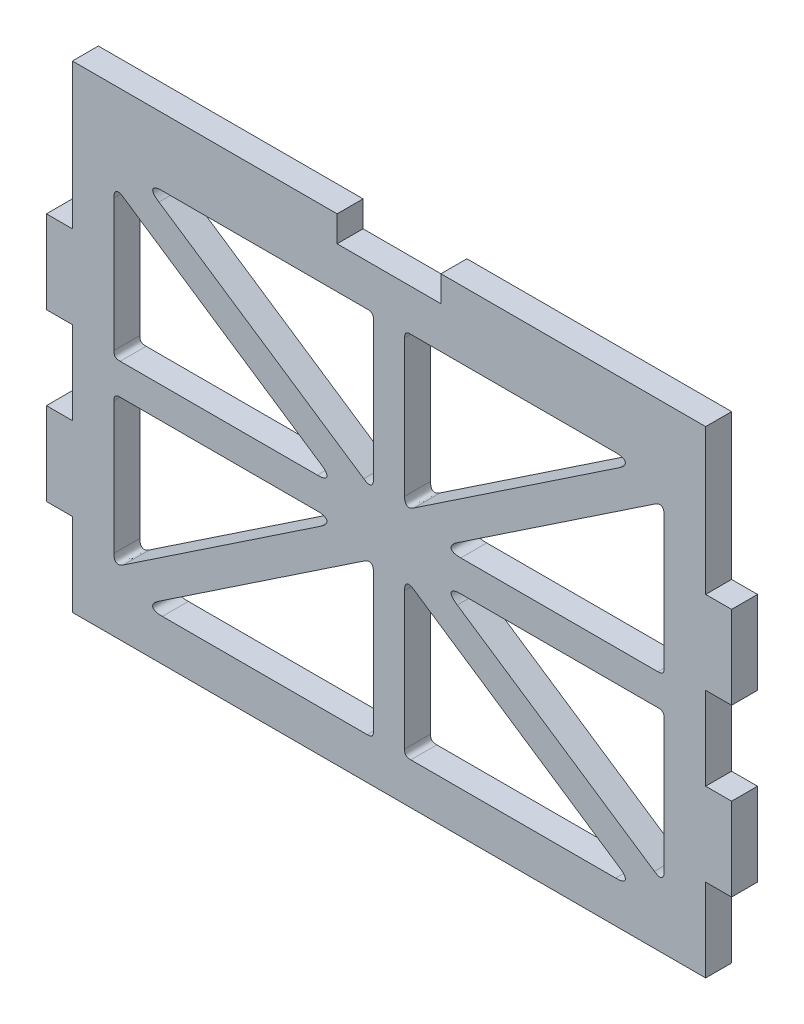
ISO-10303-21;
HEADER;
FILE_DESCRIPTION(('STEP AP214'),'2;1');
FILE_NAME('part.step','',(''),(''),'','','');
FILE_SCHEMA(('AUTOMOTIVE_DESIGN { 1 0 10303 214 1 1 1 1 }'));
ENDSEC;
DATA;
#1=APPLICATION_CONTEXT('core data for automotive mechanical design processes');
#2=APPLICATION_PROTOCOL_DEFINITION('international standard','automotive_design',2000,#1);
#3=PRODUCT_CONTEXT('',#1,'mechanical');
#4=PRODUCT('Part','Part','',(#3));
#5=PRODUCT_RELATED_PRODUCT_CATEGORY('part','',(#4));
#6=PRODUCT_DEFINITION_FORMATION('','',#4);
#7=PRODUCT_DEFINITION_CONTEXT('part definition',#1,'design');
#8=PRODUCT_DEFINITION('design','',#6,#7);
#9=PRODUCT_DEFINITION_SHAPE('','',#8);
#10=(LENGTH_UNIT() NAMED_UNIT(*) SI_UNIT(.MILLI.,.METRE.));
#11=(NAMED_UNIT(*) PLANE_ANGLE_UNIT() SI_UNIT($,.RADIAN.));
#12=(NAMED_UNIT(*) SI_UNIT($,.STERADIAN.) SOLID_ANGLE_UNIT());
#13=UNCERTAINTY_MEASURE_WITH_UNIT(LENGTH_MEASURE(1.E-05),#10,'distance_accuracy_value','');
#14=(GEOMETRIC_REPRESENTATION_CONTEXT(3) GLOBAL_UNCERTAINTY_ASSIGNED_CONTEXT((#13)) GLOBAL_UNIT_ASSIGNED_CONTEXT((#10,
#11,#12)) REPRESENTATION_CONTEXT('',''));
#15=CARTESIAN_POINT('',(0.,0.,0.));
#16=DIRECTION('',(0.,0.,1.));
#17=DIRECTION('',(1.,0.,0.));
#18=AXIS2_PLACEMENT_3D('',#15,#16,#17);
#19=CARTESIAN_POINT('',(-30.5,46.,2.5));
#20=DIRECTION('',(0.,-1.,0.));
#21=DIRECTION('',(0.,0.,-1.));
#22=AXIS2_PLACEMENT_3D('',#19,#20,#21);
#23=PLANE('',#22);
#24=DIRECTION('',(-1.,0.,0.));
#25=VECTOR('',#24,1.);
#26=CARTESIAN_POINT('',(-30.5,46.,0.));
#27=LINE('',#26,#25);
#28=CARTESIAN_POINT('',(30.5,46.,0.));
#29=VERTEX_POINT('',#28);
#30=CARTESIAN_POINT('',(5.,46.,0.));
#31=VERTEX_POINT('',#30);
#32=EDGE_CURVE('E668',#29,#31,#27,.T.);
#33=ORIENTED_EDGE('',*,*,#32,.T.);
#34=DIRECTION('',(0.,0.,1.));
#35=VECTOR('',#34,1.);
#36=CARTESIAN_POINT('',(5.,46.,-10.3077640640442));
#37=LINE('',#36,#35);
#38=CARTESIAN_POINT('',(5.,46.,2.5));
#39=VERTEX_POINT('',#38);
#40=EDGE_CURVE('E501',#31,#39,#37,.T.);
#41=ORIENTED_EDGE('',*,*,#40,.T.);
#42=DIRECTION('',(-1.,0.,0.));
#43=VECTOR('',#42,1.);
#44=CARTESIAN_POINT('',(-30.5,46.,2.5));
#45=LINE('',#44,#43);
#46=CARTESIAN_POINT('',(30.5,46.,2.5));
#47=VERTEX_POINT('',#46);
#48=EDGE_CURVE('E652',#47,#39,#45,.T.);
#49=ORIENTED_EDGE('',*,*,#48,.F.);
#50=DIRECTION('',(0.,0.,-1.));
#51=VECTOR('',#50,1.);
#52=CARTESIAN_POINT('',(30.5,46.,2.5));
#53=LINE('',#52,#51);
#54=EDGE_CURVE('E672',#47,#29,#53,.T.);
#55=ORIENTED_EDGE('',*,*,#54,.T.);
#56=EDGE_LOOP('',(#33,#41,#49,#55));
#57=FACE_BOUND('',#56,.T.);
#58=ADVANCED_FACE('F38',(#57),#23,.F.);
#59=CARTESIAN_POINT('',(-30.5,0.,2.5));
#60=DIRECTION('',(1.,0.,0.));
#61=DIRECTION('',(0.,0.,-1.));
#62=AXIS2_PLACEMENT_3D('',#59,#60,#61);
#63=PLANE('',#62);
#64=DIRECTION('',(0.,-1.,0.));
#65=VECTOR('',#64,1.);
#66=CARTESIAN_POINT('',(-30.5,0.,0.));
#67=LINE('',#66,#65);
#68=CARTESIAN_POINT('',(-30.5,24.,0.));
#69=VERTEX_POINT('',#68);
#70=CARTESIAN_POINT('',(-30.5,16.,0.));
#71=VERTEX_POINT('',#70);
#72=EDGE_CURVE('E660',#69,#71,#67,.T.);
#73=ORIENTED_EDGE('',*,*,#72,.T.);
#74=DIRECTION('',(0.,0.,1.));
#75=VECTOR('',#74,1.);
#76=CARTESIAN_POINT('',(-30.5,16.,-8.38152730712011));
#77=LINE('',#76,#75);
#78=CARTESIAN_POINT('',(-30.5,16.,2.5));
#79=VERTEX_POINT('',#78);
#80=EDGE_CURVE('E536',#71,#79,#77,.T.);
#81=ORIENTED_EDGE('',*,*,#80,.T.);
#82=DIRECTION('',(0.,-1.,0.));
#83=VECTOR('',#82,1.);
#84=CARTESIAN_POINT('',(-30.5,0.,2.5));
#85=LINE('',#84,#83);
#86=CARTESIAN_POINT('',(-30.5,24.,2.5));
#87=VERTEX_POINT('',#86);
#88=EDGE_CURVE('E643',#87,#79,#85,.T.);
#89=ORIENTED_EDGE('',*,*,#88,.F.);
#90=DIRECTION('',(0.,0.,1.));
#91=VECTOR('',#90,1.);
#92=CARTESIAN_POINT('',(-30.5,24.,-8.38152730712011));
#93=LINE('',#92,#91);
#94=EDGE_CURVE('E571',#69,#87,#93,.T.);
#95=ORIENTED_EDGE('',*,*,#94,.F.);
#96=EDGE_LOOP('',(#73,#81,#89,#95));
#97=FACE_BOUND('',#96,.T.);
#98=ADVANCED_FACE('F1731',(#97),#63,.F.);
#99=CARTESIAN_POINT('',(-30.5,8.,2.5));
#100=VERTEX_POINT('',#99);
#101=CARTESIAN_POINT('',(-30.5,0.,2.5));
#102=VERTEX_POINT('',#101);
#103=EDGE_CURVE('E644',#100,#102,#85,.T.);
#104=ORIENTED_EDGE('',*,*,#103,.F.);
#105=DIRECTION('',(0.,0.,1.));
#106=VECTOR('',#105,1.);
#107=CARTESIAN_POINT('',(-30.5,8.,-8.38152730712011));
#108=LINE('',#107,#106);
#109=CARTESIAN_POINT('',(-30.5,8.,0.));
#110=VERTEX_POINT('',#109);
#111=EDGE_CURVE('E545',#110,#100,#108,.T.);
#112=ORIENTED_EDGE('',*,*,#111,.F.);
#113=CARTESIAN_POINT('',(-30.5,0.,0.));
#114=VERTEX_POINT('',#113);
#115=EDGE_CURVE('E638',#110,#114,#67,.T.);
#116=ORIENTED_EDGE('',*,*,#115,.T.);
#117=DIRECTION('',(0.,0.,-1.));
#118=VECTOR('',#117,1.);
#119=CARTESIAN_POINT('',(-30.5,0.,2.5));
#120=LINE('',#119,#118);
#121=EDGE_CURVE('E678',#102,#114,#120,.T.);
#122=ORIENTED_EDGE('',*,*,#121,.F.);
#123=EDGE_LOOP('',(#104,#112,#116,#122));
#124=FACE_BOUND('',#123,.T.);
#125=ADVANCED_FACE('F1736',(#124),#63,.F.);
#126=CARTESIAN_POINT('',(30.5,0.,2.5));
#127=DIRECTION('',(-1.,0.,0.));
#128=DIRECTION('',(0.,0.,1.));
#129=AXIS2_PLACEMENT_3D('',#126,#127,#128);
#130=PLANE('',#129);
#131=DIRECTION('',(0.,1.,0.));
#132=VECTOR('',#131,1.);
#133=CARTESIAN_POINT('',(30.5,0.,0.));
#134=LINE('',#133,#132);
#135=CARTESIAN_POINT('',(30.5,16.,0.));
#136=VERTEX_POINT('',#135);
#137=CARTESIAN_POINT('',(30.5,24.,0.));
#138=VERTEX_POINT('',#137);
#139=EDGE_CURVE('E667',#136,#138,#134,.T.);
#140=ORIENTED_EDGE('',*,*,#139,.T.);
#141=DIRECTION('',(0.,0.,1.));
#142=VECTOR('',#141,1.);
#143=CARTESIAN_POINT('',(30.5,24.,-8.38152730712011));
#144=LINE('',#143,#142);
#145=CARTESIAN_POINT('',(30.5,24.,2.5));
#146=VERTEX_POINT('',#145);
#147=EDGE_CURVE('E608',#138,#146,#144,.T.);
#148=ORIENTED_EDGE('',*,*,#147,.T.);
#149=DIRECTION('',(0.,1.,0.));
#150=VECTOR('',#149,1.);
#151=CARTESIAN_POINT('',(30.5,0.,2.5));
#152=LINE('',#151,#150);
#153=CARTESIAN_POINT('',(30.5,16.,2.5));
#154=VERTEX_POINT('',#153);
#155=EDGE_CURVE('E651',#154,#146,#152,.T.);
#156=ORIENTED_EDGE('',*,*,#155,.F.);
#157=DIRECTION('',(0.,0.,1.));
#158=VECTOR('',#157,1.);
#159=CARTESIAN_POINT('',(30.5,16.,-8.38152730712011));
#160=LINE('',#159,#158);
#161=EDGE_CURVE('E627',#136,#154,#160,.T.);
#162=ORIENTED_EDGE('',*,*,#161,.F.);
#163=EDGE_LOOP('',(#140,#148,#156,#162));
#164=FACE_BOUND('',#163,.T.);
#165=ADVANCED_FACE('F1749',(#164),#130,.F.);
#166=CARTESIAN_POINT('',(30.5,32.,2.5));
#167=VERTEX_POINT('',#166);
#168=EDGE_CURVE('E646',#167,#47,#152,.T.);
#169=ORIENTED_EDGE('',*,*,#168,.F.);
#170=DIRECTION('',(0.,0.,1.));
#171=VECTOR('',#170,1.);
#172=CARTESIAN_POINT('',(30.5,32.,-8.38152730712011));
#173=LINE('',#172,#171);
#174=CARTESIAN_POINT('',(30.5,32.,0.));
#175=VERTEX_POINT('',#174);
#176=EDGE_CURVE('E601',#175,#167,#173,.T.);
#177=ORIENTED_EDGE('',*,*,#176,.F.);
#178=EDGE_CURVE('E662',#175,#29,#134,.T.);
#179=ORIENTED_EDGE('',*,*,#178,.T.);
#180=ORIENTED_EDGE('',*,*,#54,.F.);
#181=EDGE_LOOP('',(#169,#177,#179,#180));
#182=FACE_BOUND('',#181,.T.);
#183=ADVANCED_FACE('F1750',(#182),#130,.F.);
#184=CARTESIAN_POINT('',(-30.5,46.,0.));
#185=VERTEX_POINT('',#184);
#186=CARTESIAN_POINT('',(-30.5,32.,0.));
#187=VERTEX_POINT('',#186);
#188=EDGE_CURVE('E656',#185,#187,#67,.T.);
#189=ORIENTED_EDGE('',*,*,#188,.T.);
#190=DIRECTION('',(0.,0.,1.));
#191=VECTOR('',#190,1.);
#192=CARTESIAN_POINT('',(-30.5,32.,-8.38152730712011));
#193=LINE('',#192,#191);
#194=CARTESIAN_POINT('',(-30.5,32.,2.5));
#195=VERTEX_POINT('',#194);
#196=EDGE_CURVE('E563',#187,#195,#193,.T.);
#197=ORIENTED_EDGE('',*,*,#196,.T.);
#198=CARTESIAN_POINT('',(-30.5,46.,2.5));
#199=VERTEX_POINT('',#198);
#200=EDGE_CURVE('E639',#199,#195,#85,.T.);
#201=ORIENTED_EDGE('',*,*,#200,.F.);
#202=DIRECTION('',(0.,0.,-1.));
#203=VECTOR('',#202,1.);
#204=CARTESIAN_POINT('',(-30.5,46.,2.5));
#205=LINE('',#204,#203);
#206=EDGE_CURVE('E655',#199,#185,#205,.T.);
#207=ORIENTED_EDGE('',*,*,#206,.T.);
#208=EDGE_LOOP('',(#189,#197,#201,#207));
#209=FACE_BOUND('',#208,.T.);
#210=ADVANCED_FACE('F1739',(#209),#63,.F.);
#211=CARTESIAN_POINT('',(-30.5,0.,2.5));
#212=DIRECTION('',(0.,1.,0.));
#213=DIRECTION('',(0.,0.,1.));
#214=AXIS2_PLACEMENT_3D('',#211,#212,#213);
#215=PLANE('',#214);
#216=DIRECTION('',(1.,0.,0.));
#217=VECTOR('',#216,1.);
#218=CARTESIAN_POINT('',(-30.5,0.,0.));
#219=LINE('',#218,#217);
#220=CARTESIAN_POINT('',(30.5,0.,0.));
#221=VERTEX_POINT('',#220);
#222=EDGE_CURVE('E659',#114,#221,#219,.T.);
#223=ORIENTED_EDGE('',*,*,#222,.T.);
#224=DIRECTION('',(0.,0.,-1.));
#225=VECTOR('',#224,1.);
#226=CARTESIAN_POINT('',(30.5,0.,2.5));
#227=LINE('',#226,#225);
#228=CARTESIAN_POINT('',(30.5,0.,2.5));
#229=VERTEX_POINT('',#228);
#230=EDGE_CURVE('E675',#229,#221,#227,.T.);
#231=ORIENTED_EDGE('',*,*,#230,.F.);
#232=DIRECTION('',(1.,0.,0.));
#233=VECTOR('',#232,1.);
#234=CARTESIAN_POINT('',(-30.5,0.,2.5));
#235=LINE('',#234,#233);
#236=EDGE_CURVE('E642',#102,#229,#235,.T.);
#237=ORIENTED_EDGE('',*,*,#236,.F.);
#238=ORIENTED_EDGE('',*,*,#121,.T.);
#239=EDGE_LOOP('',(#223,#231,#237,#238));
#240=FACE_BOUND('',#239,.T.);
#241=ADVANCED_FACE('F1747',(#240),#215,.F.);
#242=CARTESIAN_POINT('',(30.5,8.,0.));
#243=VERTEX_POINT('',#242);
#244=EDGE_CURVE('E663',#221,#243,#134,.T.);
#245=ORIENTED_EDGE('',*,*,#244,.T.);
#246=DIRECTION('',(0.,0.,1.));
#247=VECTOR('',#246,1.);
#248=CARTESIAN_POINT('',(30.5,8.,-8.38152730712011));
#249=LINE('',#248,#247);
#250=CARTESIAN_POINT('',(30.5,8.,2.5));
#251=VERTEX_POINT('',#250);
#252=EDGE_CURVE('E633',#243,#251,#249,.T.);
#253=ORIENTED_EDGE('',*,*,#252,.T.);
#254=EDGE_CURVE('E647',#229,#251,#152,.T.);
#255=ORIENTED_EDGE('',*,*,#254,.F.);
#256=ORIENTED_EDGE('',*,*,#230,.T.);
#257=EDGE_LOOP('',(#245,#253,#255,#256));
#258=FACE_BOUND('',#257,.T.);
#259=ADVANCED_FACE('F1742',(#258),#130,.F.);
#260=CARTESIAN_POINT('',(-5.,46.,2.5));
#261=VERTEX_POINT('',#260);
#262=EDGE_CURVE('E650',#261,#199,#45,.T.);
#263=ORIENTED_EDGE('',*,*,#262,.F.);
#264=DIRECTION('',(0.,0.,1.));
#265=VECTOR('',#264,1.);
#266=CARTESIAN_POINT('',(-5.,46.,-10.3077640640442));
#267=LINE('',#266,#265);
#268=CARTESIAN_POINT('',(-5.,46.,0.));
#269=VERTEX_POINT('',#268);
#270=EDGE_CURVE('E527',#269,#261,#267,.T.);
#271=ORIENTED_EDGE('',*,*,#270,.F.);
#272=EDGE_CURVE('E666',#269,#185,#27,.T.);
#273=ORIENTED_EDGE('',*,*,#272,.T.);
#274=ORIENTED_EDGE('',*,*,#206,.F.);
#275=EDGE_LOOP('',(#263,#271,#273,#274));
#276=FACE_BOUND('',#275,.T.);
#277=ADVANCED_FACE('F1182',(#276),#23,.F.);
#278=CARTESIAN_POINT('',(0.,0.,2.5));
#279=DIRECTION('',(0.,0.,-1.));
#280=DIRECTION('',(-1.,0.,0.));
#281=AXIS2_PLACEMENT_3D('',#278,#279,#280);
#282=PLANE('',#281);
#283=DIRECTION('',(-0.830842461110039,-0.556507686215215,0.));
#284=VECTOR('',#283,1.);
#285=CARTESIAN_POINT('',(4.93481718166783,23.25,2.5));
#286=LINE('',#285,#284);
#287=CARTESIAN_POINT('',(25.5660953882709,37.0690637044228,2.5));
#288=VERTEX_POINT('',#287);
#289=CARTESIAN_POINT('',(6.57483944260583,24.348505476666,2.5));
#290=VERTEX_POINT('',#289);
#291=EDGE_CURVE('E936',#288,#290,#286,.T.);
#292=ORIENTED_EDGE('',*,*,#291,.F.);
#293=CARTESIAN_POINT('',(26.5,36.5705582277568,2.5));
#294=CARTESIAN_POINT('',(26.5,36.7358292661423,2.5));
#295=CARTESIAN_POINT('',(26.5,36.9011003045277,2.5));
#296=CARTESIAN_POINT('',(26.4022983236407,37.2470672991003,2.5));
#297=CARTESIAN_POINT('',(26.1825395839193,37.3643715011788,2.5));
#298=CARTESIAN_POINT('',(25.8407237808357,37.2530129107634,2.5));
#299=CARTESIAN_POINT('',(25.7034095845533,37.1610383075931,2.5));
#300=CARTESIAN_POINT('',(25.5660953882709,37.0690637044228,2.5));
#301=B_SPLINE_CURVE_WITH_KNOTS('',5,(#293,#294,#295,#296,#297,#298,#299,#300),.UNSPECIFIED.,.F.,
.F.,(6,2,6),(0.,0.5,1.),.UNSPECIFIED.);
#302=CARTESIAN_POINT('',(26.5,36.5705582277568,2.5));
#303=VERTEX_POINT('',#302);
#304=EDGE_CURVE('E1484',#288,#303,#301,.F.);
#305=ORIENTED_EDGE('',*,*,#304,.T.);
#306=DIRECTION('',(0.,1.,0.));
#307=VECTOR('',#306,1.);
#308=CARTESIAN_POINT('',(26.5,37.694603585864,2.5));
#309=LINE('',#308,#307);
#310=CARTESIAN_POINT('',(26.5,23.85,2.5));
#311=VERTEX_POINT('',#310);
#312=EDGE_CURVE('E921',#311,#303,#309,.T.);
#313=ORIENTED_EDGE('',*,*,#312,.F.);
#314=CARTESIAN_POINT('',(25.9,23.25,2.5));
#315=CARTESIAN_POINT('',(26.0009188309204,23.25,2.5));
#316=CARTESIAN_POINT('',(26.1018376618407,23.25,2.5));
#317=CARTESIAN_POINT('',(26.3242640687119,23.2930151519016,2.5));
#318=CARTESIAN_POINT('',(26.4569848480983,23.4257359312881,2.5));
#319=CARTESIAN_POINT('',(26.5,23.6481623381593,2.5));
#320=CARTESIAN_POINT('',(26.5,23.7490811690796,2.5));
#321=CARTESIAN_POINT('',(26.5,23.85,2.5));
#322=B_SPLINE_CURVE_WITH_KNOTS('',5,(#314,#315,#316,#317,#318,#319,#320,#321),.UNSPECIFIED.,.F.,
.F.,(6,2,6),(0.,0.5,1.),.UNSPECIFIED.);
#323=CARTESIAN_POINT('',(25.9,23.25,2.5));
#324=VERTEX_POINT('',#323);
#325=EDGE_CURVE('E1492',#311,#324,#322,.F.);
#326=ORIENTED_EDGE('',*,*,#325,.T.);
#327=DIRECTION('',(1.,0.,0.));
#328=VECTOR('',#327,1.);
#329=CARTESIAN_POINT('',(26.5,23.25,2.5));
#330=LINE('',#329,#328);
#331=CARTESIAN_POINT('',(6.90874405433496,23.25,2.5));
#332=VERTEX_POINT('',#331);
#333=EDGE_CURVE('E912',#332,#324,#330,.T.);
#334=ORIENTED_EDGE('',*,*,#333,.F.);
#335=CARTESIAN_POINT('',(6.57483944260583,24.348505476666,2.5));
#336=CARTESIAN_POINT('',(6.36870049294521,24.2104312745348,2.5));
#337=CARTESIAN_POINT('',(6.16256154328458,24.0723570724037,2.5));
#338=CARTESIAN_POINT('',(5.84210810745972,23.6755054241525,2.5));
#339=CARTESIAN_POINT('',(5.92543004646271,23.401386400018,2.5));
#340=CARTESIAN_POINT('',(6.41252736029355,23.25,2.5));
#341=CARTESIAN_POINT('',(6.66063570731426,23.25,2.5));
#342=CARTESIAN_POINT('',(6.90874405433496,23.25,2.5));
#343=B_SPLINE_CURVE_WITH_KNOTS('',5,(#335,#336,#337,#338,#339,#340,#341,#342),.UNSPECIFIED.,.F.,
.F.,(6,2,6),(0.,0.5,1.),.UNSPECIFIED.);
#344=EDGE_CURVE('E1497',#332,#290,#343,.F.);
#345=ORIENTED_EDGE('',*,*,#344,.T.);
#346=EDGE_LOOP('',(#292,#305,#313,#326,#334,#345));
#347=FACE_BOUND('',#346,.T.);
#348=DIRECTION('',(-1.,0.,0.));
#349=VECTOR('',#348,1.);
#350=CARTESIAN_POINT('',(26.5,20.25,2.5));
#351=LINE('',#350,#349);
#352=CARTESIAN_POINT('',(25.9,20.25,2.5));
#353=VERTEX_POINT('',#352);
#354=CARTESIAN_POINT('',(6.90874405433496,20.25,2.5));
#355=VERTEX_POINT('',#354);
#356=EDGE_CURVE('E841',#353,#355,#351,.T.);
#357=ORIENTED_EDGE('',*,*,#356,.F.);
#358=CARTESIAN_POINT('',(26.5,19.65,2.5));
#359=CARTESIAN_POINT('',(26.5,19.7509188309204,2.5));
#360=CARTESIAN_POINT('',(26.5,19.8518376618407,2.5));
#361=CARTESIAN_POINT('',(26.4569848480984,20.0742640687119,2.5));
#362=CARTESIAN_POINT('',(26.3242640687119,20.2069848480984,2.5));
#363=CARTESIAN_POINT('',(26.1018376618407,20.25,2.5));
#364=CARTESIAN_POINT('',(26.0009188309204,20.25,2.5));
#365=CARTESIAN_POINT('',(25.9,20.25,2.5));
#366=B_SPLINE_CURVE_WITH_KNOTS('',5,(#358,#359,#360,#361,#362,#363,#364,#365),.UNSPECIFIED.,.F.,
.F.,(6,2,6),(0.,0.5,1.),.UNSPECIFIED.);
#367=CARTESIAN_POINT('',(26.5,19.65,2.5));
#368=VERTEX_POINT('',#367);
#369=EDGE_CURVE('E1510',#353,#368,#366,.F.);
#370=ORIENTED_EDGE('',*,*,#369,.T.);
#371=DIRECTION('',(0.,1.,0.));
#372=VECTOR('',#371,1.);
#373=CARTESIAN_POINT('',(26.5,5.805396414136,2.5));
#374=LINE('',#373,#372);
#375=CARTESIAN_POINT('',(26.5,6.92944177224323,2.5));
#376=VERTEX_POINT('',#375);
#377=EDGE_CURVE('E832',#376,#368,#374,.T.);
#378=ORIENTED_EDGE('',*,*,#377,.F.);
#379=CARTESIAN_POINT('',(25.5660953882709,6.43093629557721,2.5));
#380=CARTESIAN_POINT('',(25.7034095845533,6.33896169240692,2.5));
#381=CARTESIAN_POINT('',(25.8407237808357,6.24698708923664,2.5));
#382=CARTESIAN_POINT('',(26.1825395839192,6.13562849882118,2.5));
#383=CARTESIAN_POINT('',(26.4022983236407,6.25293270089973,2.5));
#384=CARTESIAN_POINT('',(26.5,6.59889969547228,2.5));
#385=CARTESIAN_POINT('',(26.5,6.76417073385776,2.5));
#386=CARTESIAN_POINT('',(26.5,6.92944177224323,2.5));
#387=B_SPLINE_CURVE_WITH_KNOTS('',5,(#379,#380,#381,#382,#383,#384,#385,#386),.UNSPECIFIED.,.F.,
.F.,(6,2,6),(0.,0.5,1.),.UNSPECIFIED.);
#388=CARTESIAN_POINT('',(25.5660953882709,6.43093629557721,2.5));
#389=VERTEX_POINT('',#388);
#390=EDGE_CURVE('E1515',#376,#389,#387,.F.);
#391=ORIENTED_EDGE('',*,*,#390,.T.);
#392=DIRECTION('',(0.830842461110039,-0.556507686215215,0.));
#393=VECTOR('',#392,1.);
#394=CARTESIAN_POINT('',(4.93481718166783,20.25,2.5));
#395=LINE('',#394,#393);
#396=CARTESIAN_POINT('',(6.57483944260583,19.151494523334,2.5));
#397=VERTEX_POINT('',#396);
#398=EDGE_CURVE('E842',#397,#389,#395,.T.);
#399=ORIENTED_EDGE('',*,*,#398,.F.);
#400=CARTESIAN_POINT('',(6.90874405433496,20.25,2.5));
#401=CARTESIAN_POINT('',(6.66063570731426,20.25,2.5));
#402=CARTESIAN_POINT('',(6.41252736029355,20.25,2.5));
#403=CARTESIAN_POINT('',(5.92543004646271,20.098613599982,2.5));
#404=CARTESIAN_POINT('',(5.84210810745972,19.8244945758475,2.5));
#405=CARTESIAN_POINT('',(6.16256154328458,19.4276429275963,2.5));
#406=CARTESIAN_POINT('',(6.36870049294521,19.2895687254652,2.5));
#407=CARTESIAN_POINT('',(6.57483944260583,19.151494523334,2.5));
#408=B_SPLINE_CURVE_WITH_KNOTS('',5,(#400,#401,#402,#403,#404,#405,#406,#407),.UNSPECIFIED.,.F.,
.F.,(6,2,6),(0.,0.5,1.),.UNSPECIFIED.);
#409=EDGE_CURVE('E1502',#397,#355,#408,.F.);
#410=ORIENTED_EDGE('',*,*,#409,.T.);
#411=EDGE_LOOP('',(#357,#370,#378,#391,#399,#410));
#412=FACE_BOUND('',#411,.T.);
#413=DIRECTION('',(0.830842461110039,0.556507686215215,0.));
#414=VECTOR('',#413,1.);
#415=CARTESIAN_POINT('',(-4.93481718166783,20.25,2.5));
#416=LINE('',#415,#414);
#417=CARTESIAN_POINT('',(-25.5660953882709,6.43093629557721,2.5));
#418=VERTEX_POINT('',#417);
#419=CARTESIAN_POINT('',(-6.57483944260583,19.151494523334,2.5));
#420=VERTEX_POINT('',#419);
#421=EDGE_CURVE('E3421',#418,#420,#416,.T.);
#422=ORIENTED_EDGE('',*,*,#421,.F.);
#423=CARTESIAN_POINT('',(-26.5,6.92944177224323,2.5));
#424=CARTESIAN_POINT('',(-26.5,6.76417073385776,2.5));
#425=CARTESIAN_POINT('',(-26.5,6.59889969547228,2.5));
#426=CARTESIAN_POINT('',(-26.4022983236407,6.25293270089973,2.5));
#427=CARTESIAN_POINT('',(-26.1825395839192,6.13562849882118,2.5));
#428=CARTESIAN_POINT('',(-25.8407237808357,6.24698708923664,2.5));
#429=CARTESIAN_POINT('',(-25.7034095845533,6.33896169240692,2.5));
#430=CARTESIAN_POINT('',(-25.5660953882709,6.43093629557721,2.5));
#431=B_SPLINE_CURVE_WITH_KNOTS('',5,(#423,#424,#425,#426,#427,#428,#429,#430),.UNSPECIFIED.,.F.,
.F.,(6,2,6),(0.,0.5,1.),.UNSPECIFIED.);
#432=CARTESIAN_POINT('',(-26.5,6.92944177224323,2.5));
#433=VERTEX_POINT('',#432);
#434=EDGE_CURVE('E1562',#418,#433,#431,.F.);
#435=ORIENTED_EDGE('',*,*,#434,.T.);
#436=DIRECTION('',(0.,-1.,0.));
#437=VECTOR('',#436,1.);
#438=CARTESIAN_POINT('',(-26.5,5.805396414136,2.5));
#439=LINE('',#438,#437);
#440=CARTESIAN_POINT('',(-26.5,19.65,2.5));
#441=VERTEX_POINT('',#440);
#442=EDGE_CURVE('E3425',#441,#433,#439,.T.);
#443=ORIENTED_EDGE('',*,*,#442,.F.);
#444=CARTESIAN_POINT('',(-25.9,20.25,2.5));
#445=CARTESIAN_POINT('',(-26.0009188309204,20.25,2.5));
#446=CARTESIAN_POINT('',(-26.1018376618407,20.25,2.5));
#447=CARTESIAN_POINT('',(-26.3242640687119,20.2069848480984,2.5));
#448=CARTESIAN_POINT('',(-26.4569848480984,20.0742640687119,2.5));
#449=CARTESIAN_POINT('',(-26.5,19.8518376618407,2.5));
#450=CARTESIAN_POINT('',(-26.5,19.7509188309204,2.5));
#451=CARTESIAN_POINT('',(-26.5,19.65,2.5));
#452=B_SPLINE_CURVE_WITH_KNOTS('',5,(#444,#445,#446,#447,#448,#449,#450,#451),.UNSPECIFIED.,.F.,
.F.,(6,2,6),(0.,0.5,1.),.UNSPECIFIED.);
#453=CARTESIAN_POINT('',(-25.9,20.25,2.5));
#454=VERTEX_POINT('',#453);
#455=EDGE_CURVE('E1555',#441,#454,#452,.F.);
#456=ORIENTED_EDGE('',*,*,#455,.T.);
#457=DIRECTION('',(-1.,0.,0.));
#458=VECTOR('',#457,1.);
#459=CARTESIAN_POINT('',(-26.5,20.25,2.5));
#460=LINE('',#459,#458);
#461=CARTESIAN_POINT('',(-6.90874405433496,20.25,2.5));
#462=VERTEX_POINT('',#461);
#463=EDGE_CURVE('E866',#462,#454,#460,.T.);
#464=ORIENTED_EDGE('',*,*,#463,.F.);
#465=CARTESIAN_POINT('',(-6.57483944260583,19.151494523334,2.5));
#466=CARTESIAN_POINT('',(-6.36870049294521,19.2895687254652,2.5));
#467=CARTESIAN_POINT('',(-6.16256154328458,19.4276429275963,2.5));
#468=CARTESIAN_POINT('',(-5.84210810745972,19.8244945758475,2.5));
#469=CARTESIAN_POINT('',(-5.92543004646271,20.098613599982,2.5));
#470=CARTESIAN_POINT('',(-6.41252736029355,20.25,2.5));
#471=CARTESIAN_POINT('',(-6.66063570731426,20.25,2.5));
#472=CARTESIAN_POINT('',(-6.90874405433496,20.25,2.5));
#473=B_SPLINE_CURVE_WITH_KNOTS('',5,(#465,#466,#467,#468,#469,#470,#471,#472),.UNSPECIFIED.,.F.,
.F.,(6,2,6),(0.,0.5,1.),.UNSPECIFIED.);
#474=EDGE_CURVE('E1544',#462,#420,#473,.F.);
#475=ORIENTED_EDGE('',*,*,#474,.T.);
#476=EDGE_LOOP('',(#422,#435,#443,#456,#464,#475));
#477=FACE_BOUND('',#476,.T.);
#478=DIRECTION('',(1.,0.,0.));
#479=VECTOR('',#478,1.);
#480=CARTESIAN_POINT('',(-26.5,23.25,2.5));
#481=LINE('',#480,#479);
#482=CARTESIAN_POINT('',(-25.9,23.25,2.5));
#483=VERTEX_POINT('',#482);
#484=CARTESIAN_POINT('',(-6.90874405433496,23.25,2.5));
#485=VERTEX_POINT('',#484);
#486=EDGE_CURVE('E1127',#483,#485,#481,.T.);
#487=ORIENTED_EDGE('',*,*,#486,.F.);
#488=CARTESIAN_POINT('',(-26.5,23.85,2.5));
#489=CARTESIAN_POINT('',(-26.5,23.7490811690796,2.5));
#490=CARTESIAN_POINT('',(-26.5,23.6481623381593,2.5));
#491=CARTESIAN_POINT('',(-26.4569848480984,23.4257359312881,2.5));
#492=CARTESIAN_POINT('',(-26.3242640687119,23.2930151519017,2.5));
#493=CARTESIAN_POINT('',(-26.1018376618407,23.25,2.5));
#494=CARTESIAN_POINT('',(-26.0009188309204,23.25,2.5));
#495=CARTESIAN_POINT('',(-25.9,23.25,2.5));
#496=B_SPLINE_CURVE_WITH_KNOTS('',5,(#488,#489,#490,#491,#492,#493,#494,#495),.UNSPECIFIED.,.F.,
.F.,(6,2,6),(0.,0.5,1.),.UNSPECIFIED.);
#497=CARTESIAN_POINT('',(-26.5,23.85,2.5));
#498=VERTEX_POINT('',#497);
#499=EDGE_CURVE('E1451',#483,#498,#496,.F.);
#500=ORIENTED_EDGE('',*,*,#499,.T.);
#501=DIRECTION('',(0.,-1.,0.));
#502=VECTOR('',#501,1.);
#503=CARTESIAN_POINT('',(-26.5,37.694603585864,2.5));
#504=LINE('',#503,#502);
#505=CARTESIAN_POINT('',(-26.5,36.5705582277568,2.5));
#506=VERTEX_POINT('',#505);
#507=EDGE_CURVE('E1109',#506,#498,#504,.T.);
#508=ORIENTED_EDGE('',*,*,#507,.F.);
#509=CARTESIAN_POINT('',(-25.5660953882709,37.0690637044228,2.5));
#510=CARTESIAN_POINT('',(-25.7034095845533,37.1610383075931,2.5));
#511=CARTESIAN_POINT('',(-25.8407237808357,37.2530129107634,2.5));
#512=CARTESIAN_POINT('',(-26.1825395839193,37.3643715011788,2.5));
#513=CARTESIAN_POINT('',(-26.4022983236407,37.2470672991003,2.5));
#514=CARTESIAN_POINT('',(-26.5,36.9011003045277,2.5));
#515=CARTESIAN_POINT('',(-26.5,36.7358292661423,2.5));
#516=CARTESIAN_POINT('',(-26.5,36.5705582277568,2.5));
#517=B_SPLINE_CURVE_WITH_KNOTS('',5,(#509,#510,#511,#512,#513,#514,#515,#516),.UNSPECIFIED.,.F.,
.F.,(6,2,6),(0.,0.5,1.),.UNSPECIFIED.);
#518=CARTESIAN_POINT('',(-25.5660953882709,37.0690637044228,2.5));
#519=VERTEX_POINT('',#518);
#520=EDGE_CURVE('E1343',#506,#519,#517,.F.);
#521=ORIENTED_EDGE('',*,*,#520,.T.);
#522=DIRECTION('',(-0.830842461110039,0.556507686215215,0.));
#523=VECTOR('',#522,1.);
#524=CARTESIAN_POINT('',(-4.93481718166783,23.25,2.5));
#525=LINE('',#524,#523);
#526=CARTESIAN_POINT('',(-6.57483944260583,24.348505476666,2.5));
#527=VERTEX_POINT('',#526);
#528=EDGE_CURVE('E1100',#527,#519,#525,.T.);
#529=ORIENTED_EDGE('',*,*,#528,.F.);
#530=CARTESIAN_POINT('',(-6.90874405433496,23.25,2.5));
#531=CARTESIAN_POINT('',(-6.66063570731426,23.25,2.5));
#532=CARTESIAN_POINT('',(-6.41252736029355,23.25,2.5));
#533=CARTESIAN_POINT('',(-5.92543004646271,23.401386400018,2.5));
#534=CARTESIAN_POINT('',(-5.84210810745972,23.6755054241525,2.5));
#535=CARTESIAN_POINT('',(-6.16256154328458,24.0723570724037,2.5));
#536=CARTESIAN_POINT('',(-6.36870049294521,24.2104312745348,2.5));
#537=CARTESIAN_POINT('',(-6.57483944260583,24.348505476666,2.5));
#538=B_SPLINE_CURVE_WITH_KNOTS('',5,(#530,#531,#532,#533,#534,#535,#536,#537),.UNSPECIFIED.,.F.,
.F.,(6,2,6),(0.,0.5,1.),.UNSPECIFIED.);
#539=EDGE_CURVE('E1454',#527,#485,#538,.F.);
#540=ORIENTED_EDGE('',*,*,#539,.T.);
#541=EDGE_LOOP('',(#487,#500,#508,#521,#529,#540));
#542=FACE_BOUND('',#541,.T.);
#543=DIRECTION('',(1.,0.,0.));
#544=VECTOR('',#543,1.);
#545=CARTESIAN_POINT('',(-23.8046194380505,4.,2.5));
#546=LINE('',#545,#544);
#547=CARTESIAN_POINT('',(-21.8306925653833,4.,2.5));
#548=VERTEX_POINT('',#547);
#549=CARTESIAN_POINT('',(-2.1,4.,2.5));
#550=VERTEX_POINT('',#549);
#551=EDGE_CURVE('E682',#548,#550,#546,.T.);
#552=ORIENTED_EDGE('',*,*,#551,.F.);
#553=CARTESIAN_POINT('',(-22.1645971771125,5.09850547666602,2.5));
#554=CARTESIAN_POINT('',(-22.3707361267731,4.96043127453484,2.5));
#555=CARTESIAN_POINT('',(-22.5768750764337,4.82235707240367,2.5));
#556=CARTESIAN_POINT('',(-22.8973285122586,4.42550542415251,2.5));
#557=CARTESIAN_POINT('',(-22.8140065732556,4.15138640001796,2.5));
#558=CARTESIAN_POINT('',(-22.3269092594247,4.,2.5));
#559=CARTESIAN_POINT('',(-22.078800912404,4.,2.5));
#560=CARTESIAN_POINT('',(-21.8306925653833,4.,2.5));
#561=B_SPLINE_CURVE_WITH_KNOTS('',5,(#553,#554,#555,#556,#557,#558,#559,#560),.UNSPECIFIED.,.F.,
.F.,(6,2,6),(0.,0.5,1.),.UNSPECIFIED.);
#562=CARTESIAN_POINT('',(-22.1645971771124,5.09850547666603,2.5));
#563=VERTEX_POINT('',#562);
#564=EDGE_CURVE('E1166',#548,#563,#561,.F.);
#565=ORIENTED_EDGE('',*,*,#564,.T.);
#566=DIRECTION('',(-0.830842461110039,-0.556507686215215,0.));
#567=VECTOR('',#566,1.);
#568=CARTESIAN_POINT('',(-1.5,18.9398866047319,2.5));
#569=LINE('',#568,#567);
#570=CARTESIAN_POINT('',(-2.43390461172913,18.3143467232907,2.5));
#571=VERTEX_POINT('',#570);
#572=EDGE_CURVE('E687',#571,#563,#569,.T.);
#573=ORIENTED_EDGE('',*,*,#572,.F.);
#574=CARTESIAN_POINT('',(-1.5,17.8158412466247,2.5));
#575=CARTESIAN_POINT('',(-1.5,17.9811122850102,2.5));
#576=CARTESIAN_POINT('',(-1.5,18.1463833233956,2.5));
#577=CARTESIAN_POINT('',(-1.59770167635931,18.4923503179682,2.5));
#578=CARTESIAN_POINT('',(-1.81746041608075,18.6096545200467,2.5));
#579=CARTESIAN_POINT('',(-2.15927621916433,18.4982959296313,2.5));
#580=CARTESIAN_POINT('',(-2.29659041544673,18.406321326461,2.5));
#581=CARTESIAN_POINT('',(-2.43390461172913,18.3143467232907,2.5));
#582=B_SPLINE_CURVE_WITH_KNOTS('',5,(#574,#575,#576,#577,#578,#579,#580,#581),.UNSPECIFIED.,.F.,
.F.,(6,2,6),(0.,0.5,1.),.UNSPECIFIED.);
#583=CARTESIAN_POINT('',(-1.5,17.8158412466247,2.5));
#584=VERTEX_POINT('',#583);
#585=EDGE_CURVE('E1540',#571,#584,#582,.F.);
#586=ORIENTED_EDGE('',*,*,#585,.T.);
#587=DIRECTION('',(0.,1.,0.));
#588=VECTOR('',#587,1.);
#589=CARTESIAN_POINT('',(-1.5,4.,2.5));
#590=LINE('',#589,#588);
#591=CARTESIAN_POINT('',(-1.5,4.59999999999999,2.5));
#592=VERTEX_POINT('',#591);
#593=EDGE_CURVE('E704',#592,#584,#590,.T.);
#594=ORIENTED_EDGE('',*,*,#593,.F.);
#595=CARTESIAN_POINT('',(-2.1,4.,2.5));
#596=CARTESIAN_POINT('',(-1.99908116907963,4.,2.5));
#597=CARTESIAN_POINT('',(-1.89816233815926,4.,2.5));
#598=CARTESIAN_POINT('',(-1.67573593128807,4.04301515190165,2.5));
#599=CARTESIAN_POINT('',(-1.54301515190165,4.17573593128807,2.5));
#600=CARTESIAN_POINT('',(-1.5,4.39816233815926,2.5));
#601=CARTESIAN_POINT('',(-1.5,4.49908116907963,2.5));
#602=CARTESIAN_POINT('',(-1.5,4.59999999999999,2.5));
#603=B_SPLINE_CURVE_WITH_KNOTS('',5,(#595,#596,#597,#598,#599,#600,#601,#602),.UNSPECIFIED.,.F.,
.F.,(6,2,6),(0.,0.5,1.),.UNSPECIFIED.);
#604=EDGE_CURVE('E1535',#592,#550,#603,.F.);
#605=ORIENTED_EDGE('',*,*,#604,.T.);
#606=EDGE_LOOP('',(#552,#565,#573,#586,#594,#605));
#607=FACE_BOUND('',#606,.T.);
#608=DIRECTION('',(1.,0.,0.));
#609=VECTOR('',#608,1.);
#610=CARTESIAN_POINT('',(23.8046194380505,4.,2.5));
#611=LINE('',#610,#609);
#612=CARTESIAN_POINT('',(2.1,4.,2.5));
#613=VERTEX_POINT('',#612);
#614=CARTESIAN_POINT('',(21.8306925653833,4.,2.5));
#615=VERTEX_POINT('',#614);
#616=EDGE_CURVE('E758',#613,#615,#611,.T.);
#617=ORIENTED_EDGE('',*,*,#616,.F.);
#618=CARTESIAN_POINT('',(1.5,4.59999999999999,2.5));
#619=CARTESIAN_POINT('',(1.5,4.49908116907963,2.5));
#620=CARTESIAN_POINT('',(1.5,4.39816233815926,2.5));
#621=CARTESIAN_POINT('',(1.54301515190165,4.17573593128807,2.5));
#622=CARTESIAN_POINT('',(1.67573593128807,4.04301515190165,2.5));
#623=CARTESIAN_POINT('',(1.89816233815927,4.,2.5));
#624=CARTESIAN_POINT('',(1.99908116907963,4.,2.5));
#625=CARTESIAN_POINT('',(2.1,4.,2.5));
#626=B_SPLINE_CURVE_WITH_KNOTS('',5,(#618,#619,#620,#621,#622,#623,#624,#625),.UNSPECIFIED.,.F.,
.F.,(6,2,6),(0.,0.5,1.),.UNSPECIFIED.);
#627=CARTESIAN_POINT('',(1.5,4.59999999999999,2.5));
#628=VERTEX_POINT('',#627);
#629=EDGE_CURVE('E1531',#613,#628,#626,.F.);
#630=ORIENTED_EDGE('',*,*,#629,.T.);
#631=DIRECTION('',(0.,-1.,0.));
#632=VECTOR('',#631,1.);
#633=CARTESIAN_POINT('',(1.5,4.,2.5));
#634=LINE('',#633,#632);
#635=CARTESIAN_POINT('',(1.5,17.8158412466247,2.5));
#636=VERTEX_POINT('',#635);
#637=EDGE_CURVE('E768',#636,#628,#634,.T.);
#638=ORIENTED_EDGE('',*,*,#637,.F.);
#639=CARTESIAN_POINT('',(2.43390461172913,18.3143467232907,2.5));
#640=CARTESIAN_POINT('',(2.29659041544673,18.406321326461,2.5));
#641=CARTESIAN_POINT('',(2.15927621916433,18.4982959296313,2.5));
#642=CARTESIAN_POINT('',(1.81746041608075,18.6096545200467,2.5));
#643=CARTESIAN_POINT('',(1.59770167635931,18.4923503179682,2.5));
#644=CARTESIAN_POINT('',(1.5,18.1463833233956,2.5));
#645=CARTESIAN_POINT('',(1.5,17.9811122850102,2.5));
#646=CARTESIAN_POINT('',(1.5,17.8158412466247,2.5));
#647=B_SPLINE_CURVE_WITH_KNOTS('',5,(#639,#640,#641,#642,#643,#644,#645,#646),.UNSPECIFIED.,.F.,
.F.,(6,2,6),(0.,0.5,1.),.UNSPECIFIED.);
#648=CARTESIAN_POINT('',(2.43390461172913,18.3143467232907,2.5));
#649=VERTEX_POINT('',#648);
#650=EDGE_CURVE('E1526',#636,#649,#647,.F.);
#651=ORIENTED_EDGE('',*,*,#650,.T.);
#652=DIRECTION('',(-0.830842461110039,0.556507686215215,0.));
#653=VECTOR('',#652,1.);
#654=CARTESIAN_POINT('',(1.5,18.9398866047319,2.5));
#655=LINE('',#654,#653);
#656=CARTESIAN_POINT('',(22.1645971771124,5.09850547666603,2.5));
#657=VERTEX_POINT('',#656);
#658=EDGE_CURVE('E723',#657,#649,#655,.T.);
#659=ORIENTED_EDGE('',*,*,#658,.F.);
#660=CARTESIAN_POINT('',(21.8306925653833,4.,2.5));
#661=CARTESIAN_POINT('',(22.078800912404,4.,2.5));
#662=CARTESIAN_POINT('',(22.3269092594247,4.,2.5));
#663=CARTESIAN_POINT('',(22.8140065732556,4.15138640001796,2.5));
#664=CARTESIAN_POINT('',(22.8973285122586,4.42550542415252,2.5));
#665=CARTESIAN_POINT('',(22.5768750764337,4.82235707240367,2.5));
#666=CARTESIAN_POINT('',(22.3707361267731,4.96043127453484,2.5));
#667=CARTESIAN_POINT('',(22.1645971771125,5.09850547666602,2.5));
#668=B_SPLINE_CURVE_WITH_KNOTS('',5,(#660,#661,#662,#663,#664,#665,#666,#667),.UNSPECIFIED.,.F.,
.F.,(6,2,6),(0.,0.5,1.),.UNSPECIFIED.);
#669=EDGE_CURVE('E1519',#657,#615,#668,.F.);
#670=ORIENTED_EDGE('',*,*,#669,.T.);
#671=EDGE_LOOP('',(#617,#630,#638,#651,#659,#670));
#672=FACE_BOUND('',#671,.T.);
#673=DIRECTION('',(-1.,0.,0.));
#674=VECTOR('',#673,1.);
#675=CARTESIAN_POINT('',(23.8046194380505,39.5,2.5));
#676=LINE('',#675,#674);
#677=CARTESIAN_POINT('',(21.8306925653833,39.5,2.5));
#678=VERTEX_POINT('',#677);
#679=CARTESIAN_POINT('',(2.1,39.5,2.5));
#680=VERTEX_POINT('',#679);
#681=EDGE_CURVE('E968',#678,#680,#676,.T.);
#682=ORIENTED_EDGE('',*,*,#681,.F.);
#683=CARTESIAN_POINT('',(22.1645971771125,38.401494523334,2.5));
#684=CARTESIAN_POINT('',(22.3707361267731,38.5395687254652,2.5));
#685=CARTESIAN_POINT('',(22.5768750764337,38.6776429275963,2.5));
#686=CARTESIAN_POINT('',(22.8973285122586,39.0744945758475,2.5));
#687=CARTESIAN_POINT('',(22.8140065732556,39.3486135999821,2.5));
#688=CARTESIAN_POINT('',(22.3269092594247,39.5,2.5));
#689=CARTESIAN_POINT('',(22.078800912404,39.5,2.5));
#690=CARTESIAN_POINT('',(21.8306925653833,39.5,2.5));
#691=B_SPLINE_CURVE_WITH_KNOTS('',5,(#683,#684,#685,#686,#687,#688,#689,#690),.UNSPECIFIED.,.F.,
.F.,(6,2,6),(0.,0.5,1.),.UNSPECIFIED.);
#692=CARTESIAN_POINT('',(22.1645971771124,38.401494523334,2.5));
#693=VERTEX_POINT('',#692);
#694=EDGE_CURVE('E1480',#678,#693,#691,.F.);
#695=ORIENTED_EDGE('',*,*,#694,.T.);
#696=DIRECTION('',(0.830842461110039,0.556507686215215,0.));
#697=VECTOR('',#696,1.);
#698=CARTESIAN_POINT('',(1.5,24.5601133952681,2.5));
#699=LINE('',#698,#697);
#700=CARTESIAN_POINT('',(2.43390461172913,25.1856532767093,2.5));
#701=VERTEX_POINT('',#700);
#702=EDGE_CURVE('E978',#701,#693,#699,.T.);
#703=ORIENTED_EDGE('',*,*,#702,.F.);
#704=CARTESIAN_POINT('',(1.5,25.6841587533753,2.5));
#705=CARTESIAN_POINT('',(1.5,25.5188877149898,2.5));
#706=CARTESIAN_POINT('',(1.5,25.3536166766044,2.5));
#707=CARTESIAN_POINT('',(1.59770167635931,25.0076496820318,2.5));
#708=CARTESIAN_POINT('',(1.81746041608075,24.8903454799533,2.5));
#709=CARTESIAN_POINT('',(2.15927621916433,25.0017040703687,2.5));
#710=CARTESIAN_POINT('',(2.29659041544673,25.093678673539,2.5));
#711=CARTESIAN_POINT('',(2.43390461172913,25.1856532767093,2.5));
#712=B_SPLINE_CURVE_WITH_KNOTS('',5,(#704,#705,#706,#707,#708,#709,#710,#711),.UNSPECIFIED.,.F.,
.F.,(6,2,6),(0.,0.5,1.),.UNSPECIFIED.);
#713=CARTESIAN_POINT('',(1.5,25.6841587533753,2.5));
#714=VERTEX_POINT('',#713);
#715=EDGE_CURVE('E1475',#701,#714,#712,.F.);
#716=ORIENTED_EDGE('',*,*,#715,.T.);
#717=DIRECTION('',(0.,-1.,0.));
#718=VECTOR('',#717,1.);
#719=CARTESIAN_POINT('',(1.5,39.5,2.5));
#720=LINE('',#719,#718);
#721=CARTESIAN_POINT('',(1.5,38.9,2.5));
#722=VERTEX_POINT('',#721);
#723=EDGE_CURVE('E798',#722,#714,#720,.T.);
#724=ORIENTED_EDGE('',*,*,#723,.F.);
#725=CARTESIAN_POINT('',(2.1,39.5,2.5));
#726=CARTESIAN_POINT('',(1.99908116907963,39.5,2.5));
#727=CARTESIAN_POINT('',(1.89816233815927,39.5,2.5));
#728=CARTESIAN_POINT('',(1.67573593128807,39.4569848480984,2.5));
#729=CARTESIAN_POINT('',(1.54301515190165,39.3242640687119,2.5));
#730=CARTESIAN_POINT('',(1.5,39.1018376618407,2.5));
#731=CARTESIAN_POINT('',(1.5,39.0009188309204,2.5));
#732=CARTESIAN_POINT('',(1.5,38.9,2.5));
#733=B_SPLINE_CURVE_WITH_KNOTS('',5,(#725,#726,#727,#728,#729,#730,#731,#732),.UNSPECIFIED.,.F.,
.F.,(6,2,6),(0.,0.5,1.),.UNSPECIFIED.);
#734=EDGE_CURVE('E1468',#722,#680,#733,.F.);
#735=ORIENTED_EDGE('',*,*,#734,.T.);
#736=EDGE_LOOP('',(#682,#695,#703,#716,#724,#735));
#737=FACE_BOUND('',#736,.T.);
#738=DIRECTION('',(-1.,0.,0.));
#739=VECTOR('',#738,1.);
#740=CARTESIAN_POINT('',(-23.8046194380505,39.5,2.5));
#741=LINE('',#740,#739);
#742=CARTESIAN_POINT('',(-2.1,39.5,2.5));
#743=VERTEX_POINT('',#742);
#744=CARTESIAN_POINT('',(-21.8306925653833,39.5,2.5));
#745=VERTEX_POINT('',#744);
#746=EDGE_CURVE('E1030',#743,#745,#741,.T.);
#747=ORIENTED_EDGE('',*,*,#746,.F.);
#748=CARTESIAN_POINT('',(-1.5,38.9,2.5));
#749=CARTESIAN_POINT('',(-1.5,39.0009188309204,2.5));
#750=CARTESIAN_POINT('',(-1.5,39.1018376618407,2.5));
#751=CARTESIAN_POINT('',(-1.54301515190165,39.3242640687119,2.5));
#752=CARTESIAN_POINT('',(-1.67573593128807,39.4569848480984,2.5));
#753=CARTESIAN_POINT('',(-1.89816233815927,39.5,2.5));
#754=CARTESIAN_POINT('',(-1.99908116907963,39.5,2.5));
#755=CARTESIAN_POINT('',(-2.1,39.5,2.5));
#756=B_SPLINE_CURVE_WITH_KNOTS('',5,(#748,#749,#750,#751,#752,#753,#754,#755),.UNSPECIFIED.,.F.,
.F.,(6,2,6),(0.,0.5,1.),.UNSPECIFIED.);
#757=CARTESIAN_POINT('',(-1.5,38.9,2.5));
#758=VERTEX_POINT('',#757);
#759=EDGE_CURVE('E1465',#743,#758,#756,.F.);
#760=ORIENTED_EDGE('',*,*,#759,.T.);
#761=DIRECTION('',(0.,1.,0.));
#762=VECTOR('',#761,1.);
#763=CARTESIAN_POINT('',(-1.5,39.5,2.5));
#764=LINE('',#763,#762);
#765=CARTESIAN_POINT('',(-1.5,25.6841587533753,2.5));
#766=VERTEX_POINT('',#765);
#767=EDGE_CURVE('E1039',#766,#758,#764,.T.);
#768=ORIENTED_EDGE('',*,*,#767,.F.);
#769=CARTESIAN_POINT('',(-2.43390461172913,25.1856532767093,2.5));
#770=CARTESIAN_POINT('',(-2.29659041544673,25.093678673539,2.5));
#771=CARTESIAN_POINT('',(-2.15927621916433,25.0017040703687,2.5));
#772=CARTESIAN_POINT('',(-1.81746041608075,24.8903454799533,2.5));
#773=CARTESIAN_POINT('',(-1.59770167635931,25.0076496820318,2.5));
#774=CARTESIAN_POINT('',(-1.5,25.3536166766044,2.5));
#775=CARTESIAN_POINT('',(-1.5,25.5188877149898,2.5));
#776=CARTESIAN_POINT('',(-1.5,25.6841587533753,2.5));
#777=B_SPLINE_CURVE_WITH_KNOTS('',5,(#769,#770,#771,#772,#773,#774,#775,#776),.UNSPECIFIED.,.F.,
.F.,(6,2,6),(0.,0.5,1.),.UNSPECIFIED.);
#778=CARTESIAN_POINT('',(-2.43390461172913,25.1856532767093,2.5));
#779=VERTEX_POINT('',#778);
#780=EDGE_CURVE('E1459',#766,#779,#777,.F.);
#781=ORIENTED_EDGE('',*,*,#780,.T.);
#782=DIRECTION('',(0.830842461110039,-0.556507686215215,0.));
#783=VECTOR('',#782,1.);
#784=CARTESIAN_POINT('',(-1.5,24.5601133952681,2.5));
#785=LINE('',#784,#783);
#786=CARTESIAN_POINT('',(-22.1645971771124,38.401494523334,2.5));
#787=VERTEX_POINT('',#786);
#788=EDGE_CURVE('E1006',#787,#779,#785,.T.);
#789=ORIENTED_EDGE('',*,*,#788,.F.);
#790=CARTESIAN_POINT('',(-21.8306925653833,39.5,2.5));
#791=CARTESIAN_POINT('',(-22.078800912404,39.5,2.5));
#792=CARTESIAN_POINT('',(-22.3269092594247,39.5,2.5));
#793=CARTESIAN_POINT('',(-22.8140065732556,39.3486135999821,2.5));
#794=CARTESIAN_POINT('',(-22.8973285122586,39.0744945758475,2.5));
#795=CARTESIAN_POINT('',(-22.5768750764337,38.6776429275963,2.5));
#796=CARTESIAN_POINT('',(-22.3707361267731,38.5395687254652,2.5));
#797=CARTESIAN_POINT('',(-22.1645971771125,38.401494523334,2.5));
#798=B_SPLINE_CURVE_WITH_KNOTS('',5,(#790,#791,#792,#793,#794,#795,#796,#797),.UNSPECIFIED.,.F.,
.F.,(6,2,6),(0.,0.5,1.),.UNSPECIFIED.);
#799=EDGE_CURVE('E52',#787,#745,#798,.F.);
#800=ORIENTED_EDGE('',*,*,#799,.T.);
#801=EDGE_LOOP('',(#747,#760,#768,#781,#789,#800));
#802=FACE_BOUND('',#801,.T.);
#803=ORIENTED_EDGE('',*,*,#48,.T.);
#804=DIRECTION('',(0.,1.,0.));
#805=VECTOR('',#804,1.);
#806=CARTESIAN_POINT('',(5.,46.,2.5));
#807=LINE('',#806,#805);
#808=CARTESIAN_POINT('',(5.,43.5,2.5));
#809=VERTEX_POINT('',#808);
#810=EDGE_CURVE('E519',#809,#39,#807,.T.);
#811=ORIENTED_EDGE('',*,*,#810,.F.);
#812=DIRECTION('',(1.,0.,0.));
#813=VECTOR('',#812,1.);
#814=CARTESIAN_POINT('',(-5.,43.5,2.5));
#815=LINE('',#814,#813);
#816=CARTESIAN_POINT('',(-5.,43.5,2.5));
#817=VERTEX_POINT('',#816);
#818=EDGE_CURVE('E513',#817,#809,#815,.T.);
#819=ORIENTED_EDGE('',*,*,#818,.F.);
#820=DIRECTION('',(0.,-1.,0.));
#821=VECTOR('',#820,1.);
#822=CARTESIAN_POINT('',(-5.,46.,2.5));
#823=LINE('',#822,#821);
#824=EDGE_CURVE('E524',#261,#817,#823,.T.);
#825=ORIENTED_EDGE('',*,*,#824,.F.);
#826=ORIENTED_EDGE('',*,*,#262,.T.);
#827=ORIENTED_EDGE('',*,*,#200,.T.);
#828=DIRECTION('',(-1.,0.,0.));
#829=VECTOR('',#828,1.);
#830=CARTESIAN_POINT('',(-30.5,32.,2.5));
#831=LINE('',#830,#829);
#832=CARTESIAN_POINT('',(-33.,32.,2.5));
#833=VERTEX_POINT('',#832);
#834=EDGE_CURVE('E564',#195,#833,#831,.T.);
#835=ORIENTED_EDGE('',*,*,#834,.T.);
#836=DIRECTION('',(0.,-1.,0.));
#837=VECTOR('',#836,1.);
#838=CARTESIAN_POINT('',(-33.,24.,2.5));
#839=LINE('',#838,#837);
#840=CARTESIAN_POINT('',(-33.,24.,2.5));
#841=VERTEX_POINT('',#840);
#842=EDGE_CURVE('E560',#833,#841,#839,.T.);
#843=ORIENTED_EDGE('',*,*,#842,.T.);
#844=DIRECTION('',(1.,0.,0.));
#845=VECTOR('',#844,1.);
#846=CARTESIAN_POINT('',(-30.5,24.,2.5));
#847=LINE('',#846,#845);
#848=EDGE_CURVE('E559',#841,#87,#847,.T.);
#849=ORIENTED_EDGE('',*,*,#848,.T.);
#850=ORIENTED_EDGE('',*,*,#88,.T.);
#851=DIRECTION('',(-1.,0.,0.));
#852=VECTOR('',#851,1.);
#853=CARTESIAN_POINT('',(-30.5,16.,2.5));
#854=LINE('',#853,#852);
#855=CARTESIAN_POINT('',(-33.,16.,2.5));
#856=VERTEX_POINT('',#855);
#857=EDGE_CURVE('E537',#79,#856,#854,.T.);
#858=ORIENTED_EDGE('',*,*,#857,.T.);
#859=DIRECTION('',(0.,-1.,0.));
#860=VECTOR('',#859,1.);
#861=CARTESIAN_POINT('',(-33.,8.,2.5));
#862=LINE('',#861,#860);
#863=CARTESIAN_POINT('',(-33.,8.,2.5));
#864=VERTEX_POINT('',#863);
#865=EDGE_CURVE('E533',#856,#864,#862,.T.);
#866=ORIENTED_EDGE('',*,*,#865,.T.);
#867=DIRECTION('',(1.,0.,0.));
#868=VECTOR('',#867,1.);
#869=CARTESIAN_POINT('',(-30.5,8.,2.5));
#870=LINE('',#869,#868);
#871=EDGE_CURVE('E532',#864,#100,#870,.T.);
#872=ORIENTED_EDGE('',*,*,#871,.T.);
#873=ORIENTED_EDGE('',*,*,#103,.T.);
#874=ORIENTED_EDGE('',*,*,#236,.T.);
#875=ORIENTED_EDGE('',*,*,#254,.T.);
#876=DIRECTION('',(1.,0.,0.));
#877=VECTOR('',#876,1.);
#878=CARTESIAN_POINT('',(30.5,8.,2.5));
#879=LINE('',#878,#877);
#880=CARTESIAN_POINT('',(33.,8.,2.5));
#881=VERTEX_POINT('',#880);
#882=EDGE_CURVE('E612',#251,#881,#879,.T.);
#883=ORIENTED_EDGE('',*,*,#882,.T.);
#884=DIRECTION('',(0.,1.,0.));
#885=VECTOR('',#884,1.);
#886=CARTESIAN_POINT('',(33.,8.,2.5));
#887=LINE('',#886,#885);
#888=CARTESIAN_POINT('',(33.,16.,2.5));
#889=VERTEX_POINT('',#888);
#890=EDGE_CURVE('E617',#881,#889,#887,.T.);
#891=ORIENTED_EDGE('',*,*,#890,.T.);
#892=DIRECTION('',(-1.,0.,0.));
#893=VECTOR('',#892,1.);
#894=CARTESIAN_POINT('',(30.5,16.,2.5));
#895=LINE('',#894,#893);
#896=EDGE_CURVE('E613',#889,#154,#895,.T.);
#897=ORIENTED_EDGE('',*,*,#896,.T.);
#898=ORIENTED_EDGE('',*,*,#155,.T.);
#899=DIRECTION('',(1.,0.,0.));
#900=VECTOR('',#899,1.);
#901=CARTESIAN_POINT('',(30.5,24.,2.5));
#902=LINE('',#901,#900);
#903=CARTESIAN_POINT('',(33.,24.,2.5));
#904=VERTEX_POINT('',#903);
#905=EDGE_CURVE('E585',#146,#904,#902,.T.);
#906=ORIENTED_EDGE('',*,*,#905,.T.);
#907=DIRECTION('',(0.,1.,0.));
#908=VECTOR('',#907,1.);
#909=CARTESIAN_POINT('',(33.,24.,2.5));
#910=LINE('',#909,#908);
#911=CARTESIAN_POINT('',(33.,32.,2.5));
#912=VERTEX_POINT('',#911);
#913=EDGE_CURVE('E590',#904,#912,#910,.T.);
#914=ORIENTED_EDGE('',*,*,#913,.T.);
#915=DIRECTION('',(-1.,0.,0.));
#916=VECTOR('',#915,1.);
#917=CARTESIAN_POINT('',(30.5,32.,2.5));
#918=LINE('',#917,#916);
#919=EDGE_CURVE('E586',#912,#167,#918,.T.);
#920=ORIENTED_EDGE('',*,*,#919,.T.);
#921=ORIENTED_EDGE('',*,*,#168,.T.);
#922=EDGE_LOOP('',(#803,#811,#819,#825,#826,#827,#835,#843,#849,#850,#858,#866,#872,#873,#874,
#875,#883,#891,#897,#898,#906,#914,#920,#921));
#923=FACE_BOUND('',#922,.T.);
#924=ADVANCED_FACE('F1172',(#347,#412,#477,#542,#607,#672,#737,#802,#923),#282,.F.);
#925=CARTESIAN_POINT('',(0.,0.,0.));
#926=DIRECTION('',(0.,0.,-1.));
#927=DIRECTION('',(-1.,0.,0.));
#928=AXIS2_PLACEMENT_3D('',#925,#926,#927);
#929=PLANE('',#928);
#930=DIRECTION('',(1.,0.,0.));
#931=VECTOR('',#930,1.);
#932=CARTESIAN_POINT('',(26.5,23.25,0.));
#933=LINE('',#932,#931);
#934=CARTESIAN_POINT('',(6.90874405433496,23.25,0.));
#935=VERTEX_POINT('',#934);
#936=CARTESIAN_POINT('',(25.9,23.25,0.));
#937=VERTEX_POINT('',#936);
#938=EDGE_CURVE('E858',#935,#937,#933,.T.);
#939=ORIENTED_EDGE('',*,*,#938,.T.);
#940=CARTESIAN_POINT('',(26.5,23.85,0.));
#941=CARTESIAN_POINT('',(26.5,23.7490811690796,0.));
#942=CARTESIAN_POINT('',(26.5,23.6481623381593,0.));
#943=CARTESIAN_POINT('',(26.4569848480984,23.4257359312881,0.));
#944=CARTESIAN_POINT('',(26.3242640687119,23.2930151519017,0.));
#945=CARTESIAN_POINT('',(26.1018376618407,23.25,0.));
#946=CARTESIAN_POINT('',(26.0009188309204,23.25,0.));
#947=CARTESIAN_POINT('',(25.9,23.25,0.));
#948=B_SPLINE_CURVE_WITH_KNOTS('',5,(#940,#941,#942,#943,#944,#945,#946,#947),.UNSPECIFIED.,.F.,
.F.,(6,2,6),(0.,0.5,1.),.UNSPECIFIED.);
#949=CARTESIAN_POINT('',(26.5,23.85,0.));
#950=VERTEX_POINT('',#949);
#951=EDGE_CURVE('E1489',#937,#950,#948,.F.);
#952=ORIENTED_EDGE('',*,*,#951,.T.);
#953=DIRECTION('',(0.,1.,0.));
#954=VECTOR('',#953,1.);
#955=CARTESIAN_POINT('',(26.5,37.694603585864,0.));
#956=LINE('',#955,#954);
#957=CARTESIAN_POINT('',(26.5,36.5705582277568,0.));
#958=VERTEX_POINT('',#957);
#959=EDGE_CURVE('E931',#950,#958,#956,.T.);
#960=ORIENTED_EDGE('',*,*,#959,.T.);
#961=CARTESIAN_POINT('',(25.5660953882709,37.0690637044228,0.));
#962=CARTESIAN_POINT('',(25.7034095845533,37.1610383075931,0.));
#963=CARTESIAN_POINT('',(25.8407237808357,37.2530129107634,0.));
#964=CARTESIAN_POINT('',(26.1825395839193,37.3643715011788,0.));
#965=CARTESIAN_POINT('',(26.4022983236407,37.2470672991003,0.));
#966=CARTESIAN_POINT('',(26.5,36.9011003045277,0.));
#967=CARTESIAN_POINT('',(26.5,36.7358292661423,0.));
#968=CARTESIAN_POINT('',(26.5,36.5705582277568,0.));
#969=B_SPLINE_CURVE_WITH_KNOTS('',5,(#961,#962,#963,#964,#965,#966,#967,#968),.UNSPECIFIED.,.F.,
.F.,(6,2,6),(0.,0.5,1.),.UNSPECIFIED.);
#970=CARTESIAN_POINT('',(25.5660953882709,37.0690637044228,0.));
#971=VERTEX_POINT('',#970);
#972=EDGE_CURVE('E1483',#958,#971,#969,.F.);
#973=ORIENTED_EDGE('',*,*,#972,.T.);
#974=DIRECTION('',(-0.830842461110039,-0.556507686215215,0.));
#975=VECTOR('',#974,1.);
#976=CARTESIAN_POINT('',(4.93481718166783,23.25,0.));
#977=LINE('',#976,#975);
#978=CARTESIAN_POINT('',(6.57483944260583,24.348505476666,0.));
#979=VERTEX_POINT('',#978);
#980=EDGE_CURVE('E935',#971,#979,#977,.T.);
#981=ORIENTED_EDGE('',*,*,#980,.T.);
#982=CARTESIAN_POINT('',(6.90874405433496,23.25,0.));
#983=CARTESIAN_POINT('',(6.66063570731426,23.25,0.));
#984=CARTESIAN_POINT('',(6.41252736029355,23.25,0.));
#985=CARTESIAN_POINT('',(5.92543004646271,23.401386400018,0.));
#986=CARTESIAN_POINT('',(5.84210810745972,23.6755054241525,0.));
#987=CARTESIAN_POINT('',(6.16256154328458,24.0723570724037,0.));
#988=CARTESIAN_POINT('',(6.36870049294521,24.2104312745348,0.));
#989=CARTESIAN_POINT('',(6.57483944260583,24.348505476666,0.));
#990=B_SPLINE_CURVE_WITH_KNOTS('',5,(#982,#983,#984,#985,#986,#987,#988,#989),.UNSPECIFIED.,.F.,
.F.,(6,2,6),(0.,0.5,1.),.UNSPECIFIED.);
#991=EDGE_CURVE('E1495',#979,#935,#990,.F.);
#992=ORIENTED_EDGE('',*,*,#991,.T.);
#993=EDGE_LOOP('',(#939,#952,#960,#973,#981,#992));
#994=FACE_BOUND('',#993,.T.);
#995=DIRECTION('',(0.830842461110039,-0.556507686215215,0.));
#996=VECTOR('',#995,1.);
#997=CARTESIAN_POINT('',(4.93481718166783,20.25,0.));
#998=LINE('',#997,#996);
#999=CARTESIAN_POINT('',(6.57483944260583,19.151494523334,0.));
#1000=VERTEX_POINT('',#999);
#1001=CARTESIAN_POINT('',(25.5660953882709,6.43093629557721,0.));
#1002=VERTEX_POINT('',#1001);
#1003=EDGE_CURVE('E863',#1000,#1002,#998,.T.);
#1004=ORIENTED_EDGE('',*,*,#1003,.T.);
#1005=CARTESIAN_POINT('',(26.5,6.92944177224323,0.));
#1006=CARTESIAN_POINT('',(26.5,6.76417073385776,0.));
#1007=CARTESIAN_POINT('',(26.5,6.59889969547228,0.));
#1008=CARTESIAN_POINT('',(26.4022983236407,6.25293270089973,0.));
#1009=CARTESIAN_POINT('',(26.1825395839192,6.13562849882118,0.));
#1010=CARTESIAN_POINT('',(25.8407237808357,6.24698708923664,0.));
#1011=CARTESIAN_POINT('',(25.7034095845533,6.33896169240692,0.));
#1012=CARTESIAN_POINT('',(25.5660953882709,6.43093629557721,0.));
#1013=B_SPLINE_CURVE_WITH_KNOTS('',5,(#1005,#1006,#1007,#1008,#1009,#1010,#1011,#1012),
.UNSPECIFIED.,.F.,.F.,(6,2,6),(0.,0.5,1.),.UNSPECIFIED.);
#1014=CARTESIAN_POINT('',(26.5,6.92944177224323,0.));
#1015=VERTEX_POINT('',#1014);
#1016=EDGE_CURVE('E1513',#1002,#1015,#1013,.F.);
#1017=ORIENTED_EDGE('',*,*,#1016,.T.);
#1018=DIRECTION('',(0.,1.,0.));
#1019=VECTOR('',#1018,1.);
#1020=CARTESIAN_POINT('',(26.5,5.805396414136,0.));
#1021=LINE('',#1020,#1019);
#1022=CARTESIAN_POINT('',(26.5,19.65,0.));
#1023=VERTEX_POINT('',#1022);
#1024=EDGE_CURVE('E843',#1015,#1023,#1021,.T.);
#1025=ORIENTED_EDGE('',*,*,#1024,.T.);
#1026=CARTESIAN_POINT('',(25.9,20.25,0.));
#1027=CARTESIAN_POINT('',(26.0009188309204,20.25,0.));
#1028=CARTESIAN_POINT('',(26.1018376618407,20.25,0.));
#1029=CARTESIAN_POINT('',(26.3242640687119,20.2069848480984,0.));
#1030=CARTESIAN_POINT('',(26.4569848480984,20.0742640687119,0.));
#1031=CARTESIAN_POINT('',(26.5,19.8518376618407,0.));
#1032=CARTESIAN_POINT('',(26.5,19.7509188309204,0.));
#1033=CARTESIAN_POINT('',(26.5,19.65,0.));
#1034=B_SPLINE_CURVE_WITH_KNOTS('',5,(#1026,#1027,#1028,#1029,#1030,#1031,#1032,#1033),
.UNSPECIFIED.,.F.,.F.,(6,2,6),(0.,0.5,1.),.UNSPECIFIED.);
#1035=CARTESIAN_POINT('',(25.9,20.25,0.));
#1036=VERTEX_POINT('',#1035);
#1037=EDGE_CURVE('E1506',#1023,#1036,#1034,.F.);
#1038=ORIENTED_EDGE('',*,*,#1037,.T.);
#1039=DIRECTION('',(-1.,0.,0.));
#1040=VECTOR('',#1039,1.);
#1041=CARTESIAN_POINT('',(26.5,20.25,0.));
#1042=LINE('',#1041,#1040);
#1043=CARTESIAN_POINT('',(6.90874405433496,20.25,0.));
#1044=VERTEX_POINT('',#1043);
#1045=EDGE_CURVE('E867',#1036,#1044,#1042,.T.);
#1046=ORIENTED_EDGE('',*,*,#1045,.T.);
#1047=CARTESIAN_POINT('',(6.57483944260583,19.151494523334,0.));
#1048=CARTESIAN_POINT('',(6.36870049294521,19.2895687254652,0.));
#1049=CARTESIAN_POINT('',(6.16256154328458,19.4276429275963,0.));
#1050=CARTESIAN_POINT('',(5.84210810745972,19.8244945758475,0.));
#1051=CARTESIAN_POINT('',(5.92543004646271,20.098613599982,0.));
#1052=CARTESIAN_POINT('',(6.41252736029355,20.25,0.));
#1053=CARTESIAN_POINT('',(6.66063570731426,20.25,0.));
#1054=CARTESIAN_POINT('',(6.90874405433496,20.25,0.));
#1055=B_SPLINE_CURVE_WITH_KNOTS('',5,(#1047,#1048,#1049,#1050,#1051,#1052,#1053,#1054),
.UNSPECIFIED.,.F.,.F.,(6,2,6),(0.,0.5,1.),.UNSPECIFIED.);
#1056=EDGE_CURVE('E1500',#1044,#1000,#1055,.F.);
#1057=ORIENTED_EDGE('',*,*,#1056,.T.);
#1058=EDGE_LOOP('',(#1004,#1017,#1025,#1038,#1046,#1057));
#1059=FACE_BOUND('',#1058,.T.);
#1060=DIRECTION('',(-1.,0.,0.));
#1061=VECTOR('',#1060,1.);
#1062=CARTESIAN_POINT('',(-26.5,20.25,0.));
#1063=LINE('',#1062,#1061);
#1064=CARTESIAN_POINT('',(-6.90874405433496,20.25,0.));
#1065=VERTEX_POINT('',#1064);
#1066=CARTESIAN_POINT('',(-25.9,20.25,0.));
#1067=VERTEX_POINT('',#1066);
#1068=EDGE_CURVE('E1110',#1065,#1067,#1063,.T.);
#1069=ORIENTED_EDGE('',*,*,#1068,.T.);
#1070=CARTESIAN_POINT('',(-26.5,19.65,0.));
#1071=CARTESIAN_POINT('',(-26.5,19.7509188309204,0.));
#1072=CARTESIAN_POINT('',(-26.5,19.8518376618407,0.));
#1073=CARTESIAN_POINT('',(-26.4569848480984,20.0742640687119,0.));
#1074=CARTESIAN_POINT('',(-26.3242640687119,20.2069848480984,0.));
#1075=CARTESIAN_POINT('',(-26.1018376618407,20.25,0.));
#1076=CARTESIAN_POINT('',(-26.0009188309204,20.25,0.));
#1077=CARTESIAN_POINT('',(-25.9,20.25,0.));
#1078=B_SPLINE_CURVE_WITH_KNOTS('',5,(#1070,#1071,#1072,#1073,#1074,#1075,#1076,#1077),
.UNSPECIFIED.,.F.,.F.,(6,2,6),(0.,0.5,1.),.UNSPECIFIED.);
#1079=CARTESIAN_POINT('',(-26.5,19.65,0.));
#1080=VERTEX_POINT('',#1079);
#1081=EDGE_CURVE('E1550',#1067,#1080,#1078,.F.);
#1082=ORIENTED_EDGE('',*,*,#1081,.T.);
#1083=DIRECTION('',(0.,-1.,0.));
#1084=VECTOR('',#1083,1.);
#1085=CARTESIAN_POINT('',(-26.5,5.805396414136,0.));
#1086=LINE('',#1085,#1084);
#1087=CARTESIAN_POINT('',(-26.5,6.92944177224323,0.));
#1088=VERTEX_POINT('',#1087);
#1089=EDGE_CURVE('E3424',#1080,#1088,#1086,.T.);
#1090=ORIENTED_EDGE('',*,*,#1089,.T.);
#1091=CARTESIAN_POINT('',(-25.5660953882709,6.43093629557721,0.));
#1092=CARTESIAN_POINT('',(-25.7034095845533,6.33896169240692,0.));
#1093=CARTESIAN_POINT('',(-25.8407237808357,6.24698708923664,0.));
#1094=CARTESIAN_POINT('',(-26.1825395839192,6.13562849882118,0.));
#1095=CARTESIAN_POINT('',(-26.4022983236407,6.25293270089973,0.));
#1096=CARTESIAN_POINT('',(-26.5,6.59889969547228,0.));
#1097=CARTESIAN_POINT('',(-26.5,6.76417073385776,0.));
#1098=CARTESIAN_POINT('',(-26.5,6.92944177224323,0.));
#1099=B_SPLINE_CURVE_WITH_KNOTS('',5,(#1091,#1092,#1093,#1094,#1095,#1096,#1097,#1098),
.UNSPECIFIED.,.F.,.F.,(6,2,6),(0.,0.5,1.),.UNSPECIFIED.);
#1100=CARTESIAN_POINT('',(-25.5660953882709,6.43093629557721,0.));
#1101=VERTEX_POINT('',#1100);
#1102=EDGE_CURVE('E1559',#1088,#1101,#1099,.F.);
#1103=ORIENTED_EDGE('',*,*,#1102,.T.);
#1104=DIRECTION('',(0.830842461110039,0.556507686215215,0.));
#1105=VECTOR('',#1104,1.);
#1106=CARTESIAN_POINT('',(-4.93481718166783,20.25,0.));
#1107=LINE('',#1106,#1105);
#1108=CARTESIAN_POINT('',(-6.57483944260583,19.151494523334,0.));
#1109=VERTEX_POINT('',#1108);
#1110=EDGE_CURVE('E3428',#1101,#1109,#1107,.T.);
#1111=ORIENTED_EDGE('',*,*,#1110,.T.);
#1112=CARTESIAN_POINT('',(-6.90874405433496,20.25,0.));
#1113=CARTESIAN_POINT('',(-6.66063570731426,20.25,0.));
#1114=CARTESIAN_POINT('',(-6.41252736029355,20.25,0.));
#1115=CARTESIAN_POINT('',(-5.92543004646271,20.098613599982,0.));
#1116=CARTESIAN_POINT('',(-5.84210810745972,19.8244945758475,0.));
#1117=CARTESIAN_POINT('',(-6.16256154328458,19.4276429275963,0.));
#1118=CARTESIAN_POINT('',(-6.36870049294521,19.2895687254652,0.));
#1119=CARTESIAN_POINT('',(-6.57483944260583,19.151494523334,0.));
#1120=B_SPLINE_CURVE_WITH_KNOTS('',5,(#1112,#1113,#1114,#1115,#1116,#1117,#1118,#1119),
.UNSPECIFIED.,.F.,.F.,(6,2,6),(0.,0.5,1.),.UNSPECIFIED.);
#1121=EDGE_CURVE('E1543',#1109,#1065,#1120,.F.);
#1122=ORIENTED_EDGE('',*,*,#1121,.T.);
#1123=EDGE_LOOP('',(#1069,#1082,#1090,#1103,#1111,#1122));
#1124=FACE_BOUND('',#1123,.T.);
#1125=DIRECTION('',(-0.830842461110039,0.556507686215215,0.));
#1126=VECTOR('',#1125,1.);
#1127=CARTESIAN_POINT('',(-4.93481718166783,23.25,0.));
#1128=LINE('',#1127,#1126);
#1129=CARTESIAN_POINT('',(-6.57483944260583,24.348505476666,0.));
#1130=VERTEX_POINT('',#1129);
#1131=CARTESIAN_POINT('',(-25.5660953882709,37.0690637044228,0.));
#1132=VERTEX_POINT('',#1131);
#1133=EDGE_CURVE('E1111',#1130,#1132,#1128,.T.);
#1134=ORIENTED_EDGE('',*,*,#1133,.T.);
#1135=CARTESIAN_POINT('',(-26.5,36.5705582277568,0.));
#1136=CARTESIAN_POINT('',(-26.5,36.7358292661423,0.));
#1137=CARTESIAN_POINT('',(-26.5,36.9011003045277,0.));
#1138=CARTESIAN_POINT('',(-26.4022983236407,37.2470672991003,0.));
#1139=CARTESIAN_POINT('',(-26.1825395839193,37.3643715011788,0.));
#1140=CARTESIAN_POINT('',(-25.8407237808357,37.2530129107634,0.));
#1141=CARTESIAN_POINT('',(-25.7034095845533,37.1610383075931,0.));
#1142=CARTESIAN_POINT('',(-25.5660953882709,37.0690637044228,0.));
#1143=B_SPLINE_CURVE_WITH_KNOTS('',5,(#1135,#1136,#1137,#1138,#1139,#1140,#1141,#1142),
.UNSPECIFIED.,.F.,.F.,(6,2,6),(0.,0.5,1.),.UNSPECIFIED.);
#1144=CARTESIAN_POINT('',(-26.5,36.5705582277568,0.));
#1145=VERTEX_POINT('',#1144);
#1146=EDGE_CURVE('E67',#1132,#1145,#1143,.F.);
#1147=ORIENTED_EDGE('',*,*,#1146,.T.);
#1148=DIRECTION('',(0.,-1.,0.));
#1149=VECTOR('',#1148,1.);
#1150=CARTESIAN_POINT('',(-26.5,37.694603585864,0.));
#1151=LINE('',#1150,#1149);
#1152=CARTESIAN_POINT('',(-26.5,23.85,0.));
#1153=VERTEX_POINT('',#1152);
#1154=EDGE_CURVE('E1123',#1145,#1153,#1151,.T.);
#1155=ORIENTED_EDGE('',*,*,#1154,.T.);
#1156=CARTESIAN_POINT('',(-25.9,23.25,0.));
#1157=CARTESIAN_POINT('',(-26.0009188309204,23.25,0.));
#1158=CARTESIAN_POINT('',(-26.1018376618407,23.25,0.));
#1159=CARTESIAN_POINT('',(-26.3242640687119,23.2930151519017,0.));
#1160=CARTESIAN_POINT('',(-26.4569848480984,23.4257359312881,0.));
#1161=CARTESIAN_POINT('',(-26.5,23.6481623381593,0.));
#1162=CARTESIAN_POINT('',(-26.5,23.7490811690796,0.));
#1163=CARTESIAN_POINT('',(-26.5,23.85,0.));
#1164=B_SPLINE_CURVE_WITH_KNOTS('',5,(#1156,#1157,#1158,#1159,#1160,#1161,#1162,#1163),
.UNSPECIFIED.,.F.,.F.,(6,2,6),(0.,0.5,1.),.UNSPECIFIED.);
#1165=CARTESIAN_POINT('',(-25.9,23.25,0.));
#1166=VERTEX_POINT('',#1165);
#1167=EDGE_CURVE('E1331',#1153,#1166,#1164,.F.);
#1168=ORIENTED_EDGE('',*,*,#1167,.T.);
#1169=DIRECTION('',(1.,0.,0.));
#1170=VECTOR('',#1169,1.);
#1171=CARTESIAN_POINT('',(-26.5,23.25,0.));
#1172=LINE('',#1171,#1170);
#1173=CARTESIAN_POINT('',(-6.90874405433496,23.25,0.));
#1174=VERTEX_POINT('',#1173);
#1175=EDGE_CURVE('E1126',#1166,#1174,#1172,.T.);
#1176=ORIENTED_EDGE('',*,*,#1175,.T.);
#1177=CARTESIAN_POINT('',(-6.57483944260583,24.348505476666,0.));
#1178=CARTESIAN_POINT('',(-6.36870049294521,24.2104312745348,0.));
#1179=CARTESIAN_POINT('',(-6.16256154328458,24.0723570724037,0.));
#1180=CARTESIAN_POINT('',(-5.84210810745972,23.6755054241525,0.));
#1181=CARTESIAN_POINT('',(-5.92543004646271,23.401386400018,0.));
#1182=CARTESIAN_POINT('',(-6.41252736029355,23.25,0.));
#1183=CARTESIAN_POINT('',(-6.66063570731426,23.25,0.));
#1184=CARTESIAN_POINT('',(-6.90874405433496,23.25,0.));
#1185=B_SPLINE_CURVE_WITH_KNOTS('',5,(#1177,#1178,#1179,#1180,#1181,#1182,#1183,#1184),
.UNSPECIFIED.,.F.,.F.,(6,2,6),(0.,0.5,1.),.UNSPECIFIED.);
#1186=EDGE_CURVE('E1452',#1174,#1130,#1185,.F.);
#1187=ORIENTED_EDGE('',*,*,#1186,.T.);
#1188=EDGE_LOOP('',(#1134,#1147,#1155,#1168,#1176,#1187));
#1189=FACE_BOUND('',#1188,.T.);
#1190=DIRECTION('',(0.,1.,0.));
#1191=VECTOR('',#1190,1.);
#1192=CARTESIAN_POINT('',(-1.5,4.,0.));
#1193=LINE('',#1192,#1191);
#1194=CARTESIAN_POINT('',(-1.5,4.6,0.));
#1195=VERTEX_POINT('',#1194);
#1196=CARTESIAN_POINT('',(-1.5,17.8158412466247,0.));
#1197=VERTEX_POINT('',#1196);
#1198=EDGE_CURVE('E719',#1195,#1197,#1193,.T.);
#1199=ORIENTED_EDGE('',*,*,#1198,.T.);
#1200=CARTESIAN_POINT('',(-2.43390461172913,18.3143467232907,0.));
#1201=CARTESIAN_POINT('',(-2.29659041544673,18.406321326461,0.));
#1202=CARTESIAN_POINT('',(-2.15927621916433,18.4982959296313,0.));
#1203=CARTESIAN_POINT('',(-1.81746041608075,18.6096545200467,0.));
#1204=CARTESIAN_POINT('',(-1.59770167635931,18.4923503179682,0.));
#1205=CARTESIAN_POINT('',(-1.5,18.1463833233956,0.));
#1206=CARTESIAN_POINT('',(-1.5,17.9811122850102,0.));
#1207=CARTESIAN_POINT('',(-1.5,17.8158412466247,0.));
#1208=B_SPLINE_CURVE_WITH_KNOTS('',5,(#1200,#1201,#1202,#1203,#1204,#1205,#1206,#1207),
.UNSPECIFIED.,.F.,.F.,(6,2,6),(0.,0.5,1.),.UNSPECIFIED.);
#1209=CARTESIAN_POINT('',(-2.43390461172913,18.3143467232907,0.));
#1210=VERTEX_POINT('',#1209);
#1211=EDGE_CURVE('E1539',#1197,#1210,#1208,.F.);
#1212=ORIENTED_EDGE('',*,*,#1211,.T.);
#1213=DIRECTION('',(-0.83084246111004,-0.556507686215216,0.));
#1214=VECTOR('',#1213,1.);
#1215=CARTESIAN_POINT('',(-1.5,18.9398866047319,0.));
#1216=LINE('',#1215,#1214);
#1217=CARTESIAN_POINT('',(-22.1645971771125,5.09850547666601,0.));
#1218=VERTEX_POINT('',#1217);
#1219=EDGE_CURVE('E686',#1210,#1218,#1216,.T.);
#1220=ORIENTED_EDGE('',*,*,#1219,.T.);
#1221=CARTESIAN_POINT('',(-21.8306925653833,4.,0.));
#1222=CARTESIAN_POINT('',(-22.078800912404,4.,0.));
#1223=CARTESIAN_POINT('',(-22.3269092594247,4.,0.));
#1224=CARTESIAN_POINT('',(-22.8140065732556,4.15138640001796,0.));
#1225=CARTESIAN_POINT('',(-22.8973285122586,4.42550542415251,0.));
#1226=CARTESIAN_POINT('',(-22.5768750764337,4.82235707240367,0.));
#1227=CARTESIAN_POINT('',(-22.3707361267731,4.96043127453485,0.));
#1228=CARTESIAN_POINT('',(-22.1645971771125,5.09850547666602,0.));
#1229=B_SPLINE_CURVE_WITH_KNOTS('',5,(#1221,#1222,#1223,#1224,#1225,#1226,#1227,#1228),
.UNSPECIFIED.,.F.,.F.,(6,2,6),(0.,0.5,1.),.UNSPECIFIED.);
#1230=CARTESIAN_POINT('',(-21.8306925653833,4.,0.));
#1231=VERTEX_POINT('',#1230);
#1232=EDGE_CURVE('E1565',#1218,#1231,#1229,.F.);
#1233=ORIENTED_EDGE('',*,*,#1232,.T.);
#1234=DIRECTION('',(1.,0.,0.));
#1235=VECTOR('',#1234,1.);
#1236=CARTESIAN_POINT('',(-23.8046194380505,4.,0.));
#1237=LINE('',#1236,#1235);
#1238=CARTESIAN_POINT('',(-2.1,4.,0.));
#1239=VERTEX_POINT('',#1238);
#1240=EDGE_CURVE('E688',#1231,#1239,#1237,.T.);
#1241=ORIENTED_EDGE('',*,*,#1240,.T.);
#1242=CARTESIAN_POINT('',(-1.5,4.6,0.));
#1243=CARTESIAN_POINT('',(-1.5,4.49908116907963,0.));
#1244=CARTESIAN_POINT('',(-1.5,4.39816233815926,0.));
#1245=CARTESIAN_POINT('',(-1.54301515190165,4.17573593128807,0.));
#1246=CARTESIAN_POINT('',(-1.67573593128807,4.04301515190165,0.));
#1247=CARTESIAN_POINT('',(-1.89816233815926,4.,0.));
#1248=CARTESIAN_POINT('',(-1.99908116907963,4.,0.));
#1249=CARTESIAN_POINT('',(-2.1,4.,0.));
#1250=B_SPLINE_CURVE_WITH_KNOTS('',5,(#1242,#1243,#1244,#1245,#1246,#1247,#1248,#1249),
.UNSPECIFIED.,.F.,.F.,(6,2,6),(0.,0.5,1.),.UNSPECIFIED.);
#1251=EDGE_CURVE('E1534',#1239,#1195,#1250,.F.);
#1252=ORIENTED_EDGE('',*,*,#1251,.T.);
#1253=EDGE_LOOP('',(#1199,#1212,#1220,#1233,#1241,#1252));
#1254=FACE_BOUND('',#1253,.T.);
#1255=DIRECTION('',(-0.83084246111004,0.556507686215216,0.));
#1256=VECTOR('',#1255,1.);
#1257=CARTESIAN_POINT('',(1.5,18.9398866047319,0.));
#1258=LINE('',#1257,#1256);
#1259=CARTESIAN_POINT('',(22.1645971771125,5.09850547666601,0.));
#1260=VERTEX_POINT('',#1259);
#1261=CARTESIAN_POINT('',(2.43390461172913,18.3143467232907,0.));
#1262=VERTEX_POINT('',#1261);
#1263=EDGE_CURVE('E794',#1260,#1262,#1258,.T.);
#1264=ORIENTED_EDGE('',*,*,#1263,.T.);
#1265=CARTESIAN_POINT('',(1.5,17.8158412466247,0.));
#1266=CARTESIAN_POINT('',(1.5,17.9811122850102,0.));
#1267=CARTESIAN_POINT('',(1.5,18.1463833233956,0.));
#1268=CARTESIAN_POINT('',(1.59770167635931,18.4923503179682,0.));
#1269=CARTESIAN_POINT('',(1.81746041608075,18.6096545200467,0.));
#1270=CARTESIAN_POINT('',(2.15927621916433,18.4982959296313,0.));
#1271=CARTESIAN_POINT('',(2.29659041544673,18.406321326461,0.));
#1272=CARTESIAN_POINT('',(2.43390461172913,18.3143467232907,0.));
#1273=B_SPLINE_CURVE_WITH_KNOTS('',5,(#1265,#1266,#1267,#1268,#1269,#1270,#1271,#1272),
.UNSPECIFIED.,.F.,.F.,(6,2,6),(0.,0.5,1.),.UNSPECIFIED.);
#1274=CARTESIAN_POINT('',(1.5,17.8158412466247,0.));
#1275=VERTEX_POINT('',#1274);
#1276=EDGE_CURVE('E1523',#1262,#1275,#1273,.F.);
#1277=ORIENTED_EDGE('',*,*,#1276,.T.);
#1278=DIRECTION('',(0.,-1.,0.));
#1279=VECTOR('',#1278,1.);
#1280=CARTESIAN_POINT('',(1.5,4.,0.));
#1281=LINE('',#1280,#1279);
#1282=CARTESIAN_POINT('',(1.5,4.6,0.));
#1283=VERTEX_POINT('',#1282);
#1284=EDGE_CURVE('E767',#1275,#1283,#1281,.T.);
#1285=ORIENTED_EDGE('',*,*,#1284,.T.);
#1286=CARTESIAN_POINT('',(2.1,4.,0.));
#1287=CARTESIAN_POINT('',(1.99908116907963,4.,0.));
#1288=CARTESIAN_POINT('',(1.89816233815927,4.,0.));
#1289=CARTESIAN_POINT('',(1.67573593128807,4.04301515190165,0.));
#1290=CARTESIAN_POINT('',(1.54301515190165,4.17573593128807,0.));
#1291=CARTESIAN_POINT('',(1.5,4.39816233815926,0.));
#1292=CARTESIAN_POINT('',(1.5,4.49908116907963,0.));
#1293=CARTESIAN_POINT('',(1.5,4.6,0.));
#1294=B_SPLINE_CURVE_WITH_KNOTS('',5,(#1286,#1287,#1288,#1289,#1290,#1291,#1292,#1293),
.UNSPECIFIED.,.F.,.F.,(6,2,6),(0.,0.5,1.),.UNSPECIFIED.);
#1295=CARTESIAN_POINT('',(2.1,4.,0.));
#1296=VERTEX_POINT('',#1295);
#1297=EDGE_CURVE('E1529',#1283,#1296,#1294,.F.);
#1298=ORIENTED_EDGE('',*,*,#1297,.T.);
#1299=DIRECTION('',(1.,0.,0.));
#1300=VECTOR('',#1299,1.);
#1301=CARTESIAN_POINT('',(23.8046194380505,4.,0.));
#1302=LINE('',#1301,#1300);
#1303=CARTESIAN_POINT('',(21.8306925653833,4.,0.));
#1304=VERTEX_POINT('',#1303);
#1305=EDGE_CURVE('E769',#1296,#1304,#1302,.T.);
#1306=ORIENTED_EDGE('',*,*,#1305,.T.);
#1307=CARTESIAN_POINT('',(22.1645971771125,5.09850547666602,0.));
#1308=CARTESIAN_POINT('',(22.3707361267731,4.96043127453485,0.));
#1309=CARTESIAN_POINT('',(22.5768750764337,4.82235707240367,0.));
#1310=CARTESIAN_POINT('',(22.8973285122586,4.42550542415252,0.));
#1311=CARTESIAN_POINT('',(22.8140065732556,4.15138640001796,0.));
#1312=CARTESIAN_POINT('',(22.3269092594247,4.,0.));
#1313=CARTESIAN_POINT('',(22.078800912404,4.,0.));
#1314=CARTESIAN_POINT('',(21.8306925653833,4.,0.));
#1315=B_SPLINE_CURVE_WITH_KNOTS('',5,(#1307,#1308,#1309,#1310,#1311,#1312,#1313,#1314),
.UNSPECIFIED.,.F.,.F.,(6,2,6),(0.,0.5,1.),.UNSPECIFIED.);
#1316=EDGE_CURVE('E1518',#1304,#1260,#1315,.F.);
#1317=ORIENTED_EDGE('',*,*,#1316,.T.);
#1318=EDGE_LOOP('',(#1264,#1277,#1285,#1298,#1306,#1317));
#1319=FACE_BOUND('',#1318,.T.);
#1320=DIRECTION('',(0.,-1.,0.));
#1321=VECTOR('',#1320,1.);
#1322=CARTESIAN_POINT('',(1.5,39.5,0.));
#1323=LINE('',#1322,#1321);
#1324=CARTESIAN_POINT('',(1.5,38.9,0.));
#1325=VERTEX_POINT('',#1324);
#1326=CARTESIAN_POINT('',(1.5,25.6841587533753,0.));
#1327=VERTEX_POINT('',#1326);
#1328=EDGE_CURVE('E1002',#1325,#1327,#1323,.T.);
#1329=ORIENTED_EDGE('',*,*,#1328,.T.);
#1330=CARTESIAN_POINT('',(2.43390461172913,25.1856532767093,0.));
#1331=CARTESIAN_POINT('',(2.29659041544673,25.093678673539,0.));
#1332=CARTESIAN_POINT('',(2.15927621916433,25.0017040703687,0.));
#1333=CARTESIAN_POINT('',(1.81746041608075,24.8903454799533,0.));
#1334=CARTESIAN_POINT('',(1.59770167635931,25.0076496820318,0.));
#1335=CARTESIAN_POINT('',(1.5,25.3536166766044,0.));
#1336=CARTESIAN_POINT('',(1.5,25.5188877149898,0.));
#1337=CARTESIAN_POINT('',(1.5,25.6841587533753,0.));
#1338=B_SPLINE_CURVE_WITH_KNOTS('',5,(#1330,#1331,#1332,#1333,#1334,#1335,#1336,#1337),
.UNSPECIFIED.,.F.,.F.,(6,2,6),(0.,0.5,1.),.UNSPECIFIED.);
#1339=CARTESIAN_POINT('',(2.43390461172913,25.1856532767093,0.));
#1340=VERTEX_POINT('',#1339);
#1341=EDGE_CURVE('E1472',#1327,#1340,#1338,.F.);
#1342=ORIENTED_EDGE('',*,*,#1341,.T.);
#1343=DIRECTION('',(0.83084246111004,0.556507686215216,0.));
#1344=VECTOR('',#1343,1.);
#1345=CARTESIAN_POINT('',(1.5,24.5601133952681,0.));
#1346=LINE('',#1345,#1344);
#1347=CARTESIAN_POINT('',(22.1645971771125,38.401494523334,0.));
#1348=VERTEX_POINT('',#1347);
#1349=EDGE_CURVE('E977',#1340,#1348,#1346,.T.);
#1350=ORIENTED_EDGE('',*,*,#1349,.T.);
#1351=CARTESIAN_POINT('',(21.8306925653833,39.5,0.));
#1352=CARTESIAN_POINT('',(22.078800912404,39.5,0.));
#1353=CARTESIAN_POINT('',(22.3269092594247,39.5,0.));
#1354=CARTESIAN_POINT('',(22.8140065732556,39.3486135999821,0.));
#1355=CARTESIAN_POINT('',(22.8973285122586,39.0744945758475,0.));
#1356=CARTESIAN_POINT('',(22.5768750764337,38.6776429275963,0.));
#1357=CARTESIAN_POINT('',(22.3707361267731,38.5395687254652,0.));
#1358=CARTESIAN_POINT('',(22.1645971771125,38.401494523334,0.));
#1359=B_SPLINE_CURVE_WITH_KNOTS('',5,(#1351,#1352,#1353,#1354,#1355,#1356,#1357,#1358),
.UNSPECIFIED.,.F.,.F.,(6,2,6),(0.,0.5,1.),.UNSPECIFIED.);
#1360=CARTESIAN_POINT('',(21.8306925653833,39.5,0.));
#1361=VERTEX_POINT('',#1360);
#1362=EDGE_CURVE('E1478',#1348,#1361,#1359,.F.);
#1363=ORIENTED_EDGE('',*,*,#1362,.T.);
#1364=DIRECTION('',(-1.,0.,0.));
#1365=VECTOR('',#1364,1.);
#1366=CARTESIAN_POINT('',(23.8046194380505,39.5,0.));
#1367=LINE('',#1366,#1365);
#1368=CARTESIAN_POINT('',(2.1,39.5,0.));
#1369=VERTEX_POINT('',#1368);
#1370=EDGE_CURVE('E979',#1361,#1369,#1367,.T.);
#1371=ORIENTED_EDGE('',*,*,#1370,.T.);
#1372=CARTESIAN_POINT('',(1.5,38.9,0.));
#1373=CARTESIAN_POINT('',(1.5,39.0009188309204,0.));
#1374=CARTESIAN_POINT('',(1.5,39.1018376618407,0.));
#1375=CARTESIAN_POINT('',(1.54301515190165,39.3242640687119,0.));
#1376=CARTESIAN_POINT('',(1.67573593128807,39.4569848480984,0.));
#1377=CARTESIAN_POINT('',(1.89816233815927,39.5,0.));
#1378=CARTESIAN_POINT('',(1.99908116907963,39.5,0.));
#1379=CARTESIAN_POINT('',(2.1,39.5,0.));
#1380=B_SPLINE_CURVE_WITH_KNOTS('',5,(#1372,#1373,#1374,#1375,#1376,#1377,#1378,#1379),
.UNSPECIFIED.,.F.,.F.,(6,2,6),(0.,0.5,1.),.UNSPECIFIED.);
#1381=EDGE_CURVE('E1467',#1369,#1325,#1380,.F.);
#1382=ORIENTED_EDGE('',*,*,#1381,.T.);
#1383=EDGE_LOOP('',(#1329,#1342,#1350,#1363,#1371,#1382));
#1384=FACE_BOUND('',#1383,.T.);
#1385=DIRECTION('',(0.83084246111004,-0.556507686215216,0.));
#1386=VECTOR('',#1385,1.);
#1387=CARTESIAN_POINT('',(-1.5,24.5601133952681,0.));
#1388=LINE('',#1387,#1386);
#1389=CARTESIAN_POINT('',(-22.1645971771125,38.401494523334,0.));
#1390=VERTEX_POINT('',#1389);
#1391=CARTESIAN_POINT('',(-2.43390461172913,25.1856532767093,0.));
#1392=VERTEX_POINT('',#1391);
#1393=EDGE_CURVE('E1066',#1390,#1392,#1388,.T.);
#1394=ORIENTED_EDGE('',*,*,#1393,.T.);
#1395=CARTESIAN_POINT('',(-1.5,25.6841587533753,0.));
#1396=CARTESIAN_POINT('',(-1.5,25.5188877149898,0.));
#1397=CARTESIAN_POINT('',(-1.5,25.3536166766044,0.));
#1398=CARTESIAN_POINT('',(-1.59770167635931,25.0076496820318,0.));
#1399=CARTESIAN_POINT('',(-1.81746041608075,24.8903454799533,0.));
#1400=CARTESIAN_POINT('',(-2.15927621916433,25.0017040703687,0.));
#1401=CARTESIAN_POINT('',(-2.29659041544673,25.093678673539,0.));
#1402=CARTESIAN_POINT('',(-2.43390461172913,25.1856532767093,0.));
#1403=B_SPLINE_CURVE_WITH_KNOTS('',5,(#1395,#1396,#1397,#1398,#1399,#1400,#1401,#1402),
.UNSPECIFIED.,.F.,.F.,(6,2,6),(0.,0.5,1.),.UNSPECIFIED.);
#1404=CARTESIAN_POINT('',(-1.5,25.6841587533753,0.));
#1405=VERTEX_POINT('',#1404);
#1406=EDGE_CURVE('E1457',#1392,#1405,#1403,.F.);
#1407=ORIENTED_EDGE('',*,*,#1406,.T.);
#1408=DIRECTION('',(0.,1.,0.));
#1409=VECTOR('',#1408,1.);
#1410=CARTESIAN_POINT('',(-1.5,39.5,0.));
#1411=LINE('',#1410,#1409);
#1412=CARTESIAN_POINT('',(-1.5,38.9,0.));
#1413=VERTEX_POINT('',#1412);
#1414=EDGE_CURVE('E1038',#1405,#1413,#1411,.T.);
#1415=ORIENTED_EDGE('',*,*,#1414,.T.);
#1416=CARTESIAN_POINT('',(-2.1,39.5,0.));
#1417=CARTESIAN_POINT('',(-1.99908116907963,39.5,0.));
#1418=CARTESIAN_POINT('',(-1.89816233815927,39.5,0.));
#1419=CARTESIAN_POINT('',(-1.67573593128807,39.4569848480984,0.));
#1420=CARTESIAN_POINT('',(-1.54301515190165,39.3242640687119,0.));
#1421=CARTESIAN_POINT('',(-1.5,39.1018376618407,0.));
#1422=CARTESIAN_POINT('',(-1.5,39.0009188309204,0.));
#1423=CARTESIAN_POINT('',(-1.5,38.9,0.));
#1424=B_SPLINE_CURVE_WITH_KNOTS('',5,(#1416,#1417,#1418,#1419,#1420,#1421,#1422,#1423),
.UNSPECIFIED.,.F.,.F.,(6,2,6),(0.,0.5,1.),.UNSPECIFIED.);
#1425=CARTESIAN_POINT('',(-2.1,39.5,0.));
#1426=VERTEX_POINT('',#1425);
#1427=EDGE_CURVE('E1463',#1413,#1426,#1424,.F.);
#1428=ORIENTED_EDGE('',*,*,#1427,.T.);
#1429=DIRECTION('',(-1.,0.,0.));
#1430=VECTOR('',#1429,1.);
#1431=CARTESIAN_POINT('',(-23.8046194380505,39.5,0.));
#1432=LINE('',#1431,#1430);
#1433=CARTESIAN_POINT('',(-21.8306925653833,39.5,0.));
#1434=VERTEX_POINT('',#1433);
#1435=EDGE_CURVE('E1040',#1426,#1434,#1432,.T.);
#1436=ORIENTED_EDGE('',*,*,#1435,.T.);
#1437=CARTESIAN_POINT('',(-22.1645971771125,38.401494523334,0.));
#1438=CARTESIAN_POINT('',(-22.3707361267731,38.5395687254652,0.));
#1439=CARTESIAN_POINT('',(-22.5768750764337,38.6776429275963,0.));
#1440=CARTESIAN_POINT('',(-22.8973285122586,39.0744945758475,0.));
#1441=CARTESIAN_POINT('',(-22.8140065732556,39.3486135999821,0.));
#1442=CARTESIAN_POINT('',(-22.3269092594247,39.5,0.));
#1443=CARTESIAN_POINT('',(-22.078800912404,39.5,0.));
#1444=CARTESIAN_POINT('',(-21.8306925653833,39.5,0.));
#1445=B_SPLINE_CURVE_WITH_KNOTS('',5,(#1437,#1438,#1439,#1440,#1441,#1442,#1443,#1444),
.UNSPECIFIED.,.F.,.F.,(6,2,6),(0.,0.5,1.),.UNSPECIFIED.);
#1446=EDGE_CURVE('E11',#1434,#1390,#1445,.F.);
#1447=ORIENTED_EDGE('',*,*,#1446,.T.);
#1448=EDGE_LOOP('',(#1394,#1407,#1415,#1428,#1436,#1447));
#1449=FACE_BOUND('',#1448,.T.);
#1450=DIRECTION('',(0.,1.,0.));
#1451=VECTOR('',#1450,1.);
#1452=CARTESIAN_POINT('',(5.,46.,0.));
#1453=LINE('',#1452,#1451);
#1454=CARTESIAN_POINT('',(5.,43.5,0.));
#1455=VERTEX_POINT('',#1454);
#1456=EDGE_CURVE('E495',#1455,#31,#1453,.T.);
#1457=ORIENTED_EDGE('',*,*,#1456,.T.);
#1458=ORIENTED_EDGE('',*,*,#32,.F.);
#1459=ORIENTED_EDGE('',*,*,#178,.F.);
#1460=DIRECTION('',(-1.,0.,0.));
#1461=VECTOR('',#1460,1.);
#1462=CARTESIAN_POINT('',(30.5,32.,0.));
#1463=LINE('',#1462,#1461);
#1464=CARTESIAN_POINT('',(33.,32.,0.));
#1465=VERTEX_POINT('',#1464);
#1466=EDGE_CURVE('E598',#1465,#175,#1463,.T.);
#1467=ORIENTED_EDGE('',*,*,#1466,.F.);
#1468=DIRECTION('',(0.,1.,0.));
#1469=VECTOR('',#1468,1.);
#1470=CARTESIAN_POINT('',(33.,24.,0.));
#1471=LINE('',#1470,#1469);
#1472=CARTESIAN_POINT('',(33.,24.,0.));
#1473=VERTEX_POINT('',#1472);
#1474=EDGE_CURVE('E603',#1473,#1465,#1471,.T.);
#1475=ORIENTED_EDGE('',*,*,#1474,.F.);
#1476=DIRECTION('',(1.,0.,0.));
#1477=VECTOR('',#1476,1.);
#1478=CARTESIAN_POINT('',(30.5,24.,0.));
#1479=LINE('',#1478,#1477);
#1480=EDGE_CURVE('E589',#138,#1473,#1479,.T.);
#1481=ORIENTED_EDGE('',*,*,#1480,.F.);
#1482=ORIENTED_EDGE('',*,*,#139,.F.);
#1483=DIRECTION('',(-1.,0.,0.));
#1484=VECTOR('',#1483,1.);
#1485=CARTESIAN_POINT('',(30.5,16.,0.));
#1486=LINE('',#1485,#1484);
#1487=CARTESIAN_POINT('',(33.,16.,0.));
#1488=VERTEX_POINT('',#1487);
#1489=EDGE_CURVE('E625',#1488,#136,#1486,.T.);
#1490=ORIENTED_EDGE('',*,*,#1489,.F.);
#1491=DIRECTION('',(0.,1.,0.));
#1492=VECTOR('',#1491,1.);
#1493=CARTESIAN_POINT('',(33.,8.,0.));
#1494=LINE('',#1493,#1492);
#1495=CARTESIAN_POINT('',(33.,8.,0.));
#1496=VERTEX_POINT('',#1495);
#1497=EDGE_CURVE('E629',#1496,#1488,#1494,.T.);
#1498=ORIENTED_EDGE('',*,*,#1497,.F.);
#1499=DIRECTION('',(1.,0.,0.));
#1500=VECTOR('',#1499,1.);
#1501=CARTESIAN_POINT('',(30.5,8.,0.));
#1502=LINE('',#1501,#1500);
#1503=EDGE_CURVE('E616',#243,#1496,#1502,.T.);
#1504=ORIENTED_EDGE('',*,*,#1503,.F.);
#1505=ORIENTED_EDGE('',*,*,#244,.F.);
#1506=ORIENTED_EDGE('',*,*,#222,.F.);
#1507=ORIENTED_EDGE('',*,*,#115,.F.);
#1508=DIRECTION('',(1.,0.,0.));
#1509=VECTOR('',#1508,1.);
#1510=CARTESIAN_POINT('',(-30.5,8.,0.));
#1511=LINE('',#1510,#1509);
#1512=CARTESIAN_POINT('',(-33.,8.,0.));
#1513=VERTEX_POINT('',#1512);
#1514=EDGE_CURVE('E542',#1513,#110,#1511,.T.);
#1515=ORIENTED_EDGE('',*,*,#1514,.F.);
#1516=DIRECTION('',(0.,-1.,0.));
#1517=VECTOR('',#1516,1.);
#1518=CARTESIAN_POINT('',(-33.,8.,0.));
#1519=LINE('',#1518,#1517);
#1520=CARTESIAN_POINT('',(-33.,16.,0.));
#1521=VERTEX_POINT('',#1520);
#1522=EDGE_CURVE('E547',#1521,#1513,#1519,.T.);
#1523=ORIENTED_EDGE('',*,*,#1522,.F.);
#1524=DIRECTION('',(-1.,0.,0.));
#1525=VECTOR('',#1524,1.);
#1526=CARTESIAN_POINT('',(-30.5,16.,0.));
#1527=LINE('',#1526,#1525);
#1528=EDGE_CURVE('E551',#71,#1521,#1527,.T.);
#1529=ORIENTED_EDGE('',*,*,#1528,.F.);
#1530=ORIENTED_EDGE('',*,*,#72,.F.);
#1531=DIRECTION('',(1.,0.,0.));
#1532=VECTOR('',#1531,1.);
#1533=CARTESIAN_POINT('',(-30.5,24.,0.));
#1534=LINE('',#1533,#1532);
#1535=CARTESIAN_POINT('',(-33.,24.,0.));
#1536=VERTEX_POINT('',#1535);
#1537=EDGE_CURVE('E569',#1536,#69,#1534,.T.);
#1538=ORIENTED_EDGE('',*,*,#1537,.F.);
#1539=DIRECTION('',(0.,-1.,0.));
#1540=VECTOR('',#1539,1.);
#1541=CARTESIAN_POINT('',(-33.,24.,0.));
#1542=LINE('',#1541,#1540);
#1543=CARTESIAN_POINT('',(-33.,32.,0.));
#1544=VERTEX_POINT('',#1543);
#1545=EDGE_CURVE('E573',#1544,#1536,#1542,.T.);
#1546=ORIENTED_EDGE('',*,*,#1545,.F.);
#1547=DIRECTION('',(-1.,0.,0.));
#1548=VECTOR('',#1547,1.);
#1549=CARTESIAN_POINT('',(-30.5,32.,0.));
#1550=LINE('',#1549,#1548);
#1551=EDGE_CURVE('E577',#187,#1544,#1550,.T.);
#1552=ORIENTED_EDGE('',*,*,#1551,.F.);
#1553=ORIENTED_EDGE('',*,*,#188,.F.);
#1554=ORIENTED_EDGE('',*,*,#272,.F.);
#1555=DIRECTION('',(0.,-1.,0.));
#1556=VECTOR('',#1555,1.);
#1557=CARTESIAN_POINT('',(-5.,46.,0.));
#1558=LINE('',#1557,#1556);
#1559=CARTESIAN_POINT('',(-5.,43.5,0.));
#1560=VERTEX_POINT('',#1559);
#1561=EDGE_CURVE('E518',#269,#1560,#1558,.T.);
#1562=ORIENTED_EDGE('',*,*,#1561,.T.);
#1563=DIRECTION('',(1.,0.,0.));
#1564=VECTOR('',#1563,1.);
#1565=CARTESIAN_POINT('',(-5.,43.5,0.));
#1566=LINE('',#1565,#1564);
#1567=EDGE_CURVE('E510',#1560,#1455,#1566,.T.);
#1568=ORIENTED_EDGE('',*,*,#1567,.T.);
#1569=EDGE_LOOP('',(#1457,#1458,#1459,#1467,#1475,#1481,#1482,#1490,#1498,#1504,#1505,#1506,
#1507,#1515,#1523,#1529,#1530,#1538,#1546,#1552,#1553,#1554,#1562,#1568));
#1570=FACE_BOUND('',#1569,.T.);
#1571=ADVANCED_FACE('F516',(#994,#1059,#1124,#1189,#1254,#1319,#1384,#1449,#1570),#929,.T.);
#1572=CARTESIAN_POINT('',(30.5,8.,-8.38152730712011));
#1573=DIRECTION('',(0.,-1.,0.));
#1574=DIRECTION('',(0.,0.,-1.));
#1575=AXIS2_PLACEMENT_3D('',#1572,#1573,#1574);
#1576=PLANE('',#1575);
#1577=ORIENTED_EDGE('',*,*,#252,.F.);
#1578=ORIENTED_EDGE('',*,*,#1503,.T.);
#1579=DIRECTION('',(0.,0.,1.));
#1580=VECTOR('',#1579,1.);
#1581=CARTESIAN_POINT('',(33.,8.,-8.38152730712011));
#1582=LINE('',#1581,#1580);
#1583=EDGE_CURVE('E624',#1496,#881,#1582,.T.);
#1584=ORIENTED_EDGE('',*,*,#1583,.T.);
#1585=ORIENTED_EDGE('',*,*,#882,.F.);
#1586=EDGE_LOOP('',(#1577,#1578,#1584,#1585));
#1587=FACE_BOUND('',#1586,.T.);
#1588=ADVANCED_FACE('F1184',(#1587),#1576,.T.);
#1589=CARTESIAN_POINT('',(33.,8.,-8.38152730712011));
#1590=DIRECTION('',(1.,0.,0.));
#1591=DIRECTION('',(0.,0.,-1.));
#1592=AXIS2_PLACEMENT_3D('',#1589,#1590,#1591);
#1593=PLANE('',#1592);
#1594=ORIENTED_EDGE('',*,*,#1583,.F.);
#1595=ORIENTED_EDGE('',*,*,#1497,.T.);
#1596=DIRECTION('',(0.,0.,1.));
#1597=VECTOR('',#1596,1.);
#1598=CARTESIAN_POINT('',(33.,16.,-8.38152730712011));
#1599=LINE('',#1598,#1597);
#1600=EDGE_CURVE('E628',#1488,#889,#1599,.T.);
#1601=ORIENTED_EDGE('',*,*,#1600,.T.);
#1602=ORIENTED_EDGE('',*,*,#890,.F.);
#1603=EDGE_LOOP('',(#1594,#1595,#1601,#1602));
#1604=FACE_BOUND('',#1603,.T.);
#1605=ADVANCED_FACE('F1808',(#1604),#1593,.T.);
#1606=CARTESIAN_POINT('',(30.5,16.,-8.38152730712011));
#1607=DIRECTION('',(0.,1.,0.));
#1608=DIRECTION('',(0.,0.,1.));
#1609=AXIS2_PLACEMENT_3D('',#1606,#1607,#1608);
#1610=PLANE('',#1609);
#1611=ORIENTED_EDGE('',*,*,#1600,.F.);
#1612=ORIENTED_EDGE('',*,*,#1489,.T.);
#1613=ORIENTED_EDGE('',*,*,#161,.T.);
#1614=ORIENTED_EDGE('',*,*,#896,.F.);
#1615=EDGE_LOOP('',(#1611,#1612,#1613,#1614));
#1616=FACE_BOUND('',#1615,.T.);
#1617=ADVANCED_FACE('F1805',(#1616),#1610,.T.);
#1618=CARTESIAN_POINT('',(30.5,24.,-8.38152730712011));
#1619=DIRECTION('',(0.,-1.,0.));
#1620=DIRECTION('',(0.,0.,-1.));
#1621=AXIS2_PLACEMENT_3D('',#1618,#1619,#1620);
#1622=PLANE('',#1621);
#1623=ORIENTED_EDGE('',*,*,#147,.F.);
#1624=ORIENTED_EDGE('',*,*,#1480,.T.);
#1625=DIRECTION('',(0.,0.,1.));
#1626=VECTOR('',#1625,1.);
#1627=CARTESIAN_POINT('',(33.,24.,-8.38152730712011));
#1628=LINE('',#1627,#1626);
#1629=EDGE_CURVE('E597',#1473,#904,#1628,.T.);
#1630=ORIENTED_EDGE('',*,*,#1629,.T.);
#1631=ORIENTED_EDGE('',*,*,#905,.F.);
#1632=EDGE_LOOP('',(#1623,#1624,#1630,#1631));
#1633=FACE_BOUND('',#1632,.T.);
#1634=ADVANCED_FACE('F1801',(#1633),#1622,.T.);
#1635=CARTESIAN_POINT('',(33.,24.,-8.38152730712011));
#1636=DIRECTION('',(1.,0.,0.));
#1637=DIRECTION('',(0.,0.,-1.));
#1638=AXIS2_PLACEMENT_3D('',#1635,#1636,#1637);
#1639=PLANE('',#1638);
#1640=ORIENTED_EDGE('',*,*,#1629,.F.);
#1641=ORIENTED_EDGE('',*,*,#1474,.T.);
#1642=DIRECTION('',(0.,0.,1.));
#1643=VECTOR('',#1642,1.);
#1644=CARTESIAN_POINT('',(33.,32.,-8.38152730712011));
#1645=LINE('',#1644,#1643);
#1646=EDGE_CURVE('E602',#1465,#912,#1645,.T.);
#1647=ORIENTED_EDGE('',*,*,#1646,.T.);
#1648=ORIENTED_EDGE('',*,*,#913,.F.);
#1649=EDGE_LOOP('',(#1640,#1641,#1647,#1648));
#1650=FACE_BOUND('',#1649,.T.);
#1651=ADVANCED_FACE('F1797',(#1650),#1639,.T.);
#1652=CARTESIAN_POINT('',(30.5,32.,-8.38152730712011));
#1653=DIRECTION('',(0.,1.,0.));
#1654=DIRECTION('',(0.,0.,1.));
#1655=AXIS2_PLACEMENT_3D('',#1652,#1653,#1654);
#1656=PLANE('',#1655);
#1657=ORIENTED_EDGE('',*,*,#1646,.F.);
#1658=ORIENTED_EDGE('',*,*,#1466,.T.);
#1659=ORIENTED_EDGE('',*,*,#176,.T.);
#1660=ORIENTED_EDGE('',*,*,#919,.F.);
#1661=EDGE_LOOP('',(#1657,#1658,#1659,#1660));
#1662=FACE_BOUND('',#1661,.T.);
#1663=ADVANCED_FACE('F1793',(#1662),#1656,.T.);
#1664=CARTESIAN_POINT('',(-30.5,32.,-8.38152730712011));
#1665=DIRECTION('',(0.,1.,0.));
#1666=DIRECTION('',(0.,0.,1.));
#1667=AXIS2_PLACEMENT_3D('',#1664,#1665,#1666);
#1668=PLANE('',#1667);
#1669=ORIENTED_EDGE('',*,*,#196,.F.);
#1670=ORIENTED_EDGE('',*,*,#1551,.T.);
#1671=DIRECTION('',(0.,0.,1.));
#1672=VECTOR('',#1671,1.);
#1673=CARTESIAN_POINT('',(-33.,32.,-8.38152730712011));
#1674=LINE('',#1673,#1672);
#1675=EDGE_CURVE('E576',#1544,#833,#1674,.T.);
#1676=ORIENTED_EDGE('',*,*,#1675,.T.);
#1677=ORIENTED_EDGE('',*,*,#834,.F.);
#1678=EDGE_LOOP('',(#1669,#1670,#1676,#1677));
#1679=FACE_BOUND('',#1678,.T.);
#1680=ADVANCED_FACE('F1789',(#1679),#1668,.T.);
#1681=CARTESIAN_POINT('',(-33.,24.,-8.38152730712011));
#1682=DIRECTION('',(-1.,0.,0.));
#1683=DIRECTION('',(0.,0.,1.));
#1684=AXIS2_PLACEMENT_3D('',#1681,#1682,#1683);
#1685=PLANE('',#1684);
#1686=ORIENTED_EDGE('',*,*,#1675,.F.);
#1687=ORIENTED_EDGE('',*,*,#1545,.T.);
#1688=DIRECTION('',(0.,0.,1.));
#1689=VECTOR('',#1688,1.);
#1690=CARTESIAN_POINT('',(-33.,24.,-8.38152730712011));
#1691=LINE('',#1690,#1689);
#1692=EDGE_CURVE('E572',#1536,#841,#1691,.T.);
#1693=ORIENTED_EDGE('',*,*,#1692,.T.);
#1694=ORIENTED_EDGE('',*,*,#842,.F.);
#1695=EDGE_LOOP('',(#1686,#1687,#1693,#1694));
#1696=FACE_BOUND('',#1695,.T.);
#1697=ADVANCED_FACE('F1785',(#1696),#1685,.T.);
#1698=CARTESIAN_POINT('',(-30.5,24.,-8.38152730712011));
#1699=DIRECTION('',(0.,-1.,0.));
#1700=DIRECTION('',(0.,0.,-1.));
#1701=AXIS2_PLACEMENT_3D('',#1698,#1699,#1700);
#1702=PLANE('',#1701);
#1703=ORIENTED_EDGE('',*,*,#1692,.F.);
#1704=ORIENTED_EDGE('',*,*,#1537,.T.);
#1705=ORIENTED_EDGE('',*,*,#94,.T.);
#1706=ORIENTED_EDGE('',*,*,#848,.F.);
#1707=EDGE_LOOP('',(#1703,#1704,#1705,#1706));
#1708=FACE_BOUND('',#1707,.T.);
#1709=ADVANCED_FACE('F1781',(#1708),#1702,.T.);
#1710=CARTESIAN_POINT('',(-30.5,16.,-8.38152730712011));
#1711=DIRECTION('',(0.,1.,0.));
#1712=DIRECTION('',(0.,0.,1.));
#1713=AXIS2_PLACEMENT_3D('',#1710,#1711,#1712);
#1714=PLANE('',#1713);
#1715=ORIENTED_EDGE('',*,*,#80,.F.);
#1716=ORIENTED_EDGE('',*,*,#1528,.T.);
#1717=DIRECTION('',(0.,0.,1.));
#1718=VECTOR('',#1717,1.);
#1719=CARTESIAN_POINT('',(-33.,16.,-8.38152730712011));
#1720=LINE('',#1719,#1718);
#1721=EDGE_CURVE('E550',#1521,#856,#1720,.T.);
#1722=ORIENTED_EDGE('',*,*,#1721,.T.);
#1723=ORIENTED_EDGE('',*,*,#857,.F.);
#1724=EDGE_LOOP('',(#1715,#1716,#1722,#1723));
#1725=FACE_BOUND('',#1724,.T.);
#1726=ADVANCED_FACE('F1777',(#1725),#1714,.T.);
#1727=CARTESIAN_POINT('',(-33.,8.,-8.38152730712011));
#1728=DIRECTION('',(-1.,0.,0.));
#1729=DIRECTION('',(0.,0.,1.));
#1730=AXIS2_PLACEMENT_3D('',#1727,#1728,#1729);
#1731=PLANE('',#1730);
#1732=ORIENTED_EDGE('',*,*,#1721,.F.);
#1733=ORIENTED_EDGE('',*,*,#1522,.T.);
#1734=DIRECTION('',(0.,0.,1.));
#1735=VECTOR('',#1734,1.);
#1736=CARTESIAN_POINT('',(-33.,8.,-8.38152730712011));
#1737=LINE('',#1736,#1735);
#1738=EDGE_CURVE('E546',#1513,#864,#1737,.T.);
#1739=ORIENTED_EDGE('',*,*,#1738,.T.);
#1740=ORIENTED_EDGE('',*,*,#865,.F.);
#1741=EDGE_LOOP('',(#1732,#1733,#1739,#1740));
#1742=FACE_BOUND('',#1741,.T.);
#1743=ADVANCED_FACE('F1773',(#1742),#1731,.T.);
#1744=CARTESIAN_POINT('',(-30.5,8.,-8.38152730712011));
#1745=DIRECTION('',(0.,-1.,0.));
#1746=DIRECTION('',(0.,0.,-1.));
#1747=AXIS2_PLACEMENT_3D('',#1744,#1745,#1746);
#1748=PLANE('',#1747);
#1749=ORIENTED_EDGE('',*,*,#1738,.F.);
#1750=ORIENTED_EDGE('',*,*,#1514,.T.);
#1751=ORIENTED_EDGE('',*,*,#111,.T.);
#1752=ORIENTED_EDGE('',*,*,#871,.F.);
#1753=EDGE_LOOP('',(#1749,#1750,#1751,#1752));
#1754=FACE_BOUND('',#1753,.T.);
#1755=ADVANCED_FACE('F1770',(#1754),#1748,.T.);
#1756=CARTESIAN_POINT('',(-5.,43.5,-10.3077640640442));
#1757=DIRECTION('',(0.,-1.,0.));
#1758=DIRECTION('',(0.,0.,-1.));
#1759=AXIS2_PLACEMENT_3D('',#1756,#1757,#1758);
#1760=PLANE('',#1759);
#1761=DIRECTION('',(0.,0.,1.));
#1762=VECTOR('',#1761,1.);
#1763=CARTESIAN_POINT('',(-5.,43.5,-10.3077640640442));
#1764=LINE('',#1763,#1762);
#1765=EDGE_CURVE('E526',#1560,#817,#1764,.T.);
#1766=ORIENTED_EDGE('',*,*,#1765,.T.);
#1767=ORIENTED_EDGE('',*,*,#818,.T.);
#1768=DIRECTION('',(0.,0.,1.));
#1769=VECTOR('',#1768,1.);
#1770=CARTESIAN_POINT('',(5.,43.5,-10.3077640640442));
#1771=LINE('',#1770,#1769);
#1772=EDGE_CURVE('E498',#1455,#809,#1771,.T.);
#1773=ORIENTED_EDGE('',*,*,#1772,.F.);
#1774=ORIENTED_EDGE('',*,*,#1567,.F.);
#1775=EDGE_LOOP('',(#1766,#1767,#1773,#1774));
#1776=FACE_BOUND('',#1775,.T.);
#1777=ADVANCED_FACE('F509',(#1776),#1760,.F.);
#1778=CARTESIAN_POINT('',(5.,46.,-10.3077640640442));
#1779=DIRECTION('',(1.,0.,0.));
#1780=DIRECTION('',(0.,1.,0.));
#1781=AXIS2_PLACEMENT_3D('',#1778,#1779,#1780);
#1782=PLANE('',#1781);
#1783=ORIENTED_EDGE('',*,*,#1772,.T.);
#1784=ORIENTED_EDGE('',*,*,#810,.T.);
#1785=ORIENTED_EDGE('',*,*,#40,.F.);
#1786=ORIENTED_EDGE('',*,*,#1456,.F.);
#1787=EDGE_LOOP('',(#1783,#1784,#1785,#1786));
#1788=FACE_BOUND('',#1787,.T.);
#1789=ADVANCED_FACE('F497',(#1788),#1782,.F.);
#1790=CARTESIAN_POINT('',(-5.,46.,-10.3077640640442));
#1791=DIRECTION('',(-1.,0.,0.));
#1792=DIRECTION('',(0.,-1.,0.));
#1793=AXIS2_PLACEMENT_3D('',#1790,#1791,#1792);
#1794=PLANE('',#1793);
#1795=ORIENTED_EDGE('',*,*,#270,.T.);
#1796=ORIENTED_EDGE('',*,*,#824,.T.);
#1797=ORIENTED_EDGE('',*,*,#1765,.F.);
#1798=ORIENTED_EDGE('',*,*,#1561,.F.);
#1799=EDGE_LOOP('',(#1795,#1796,#1797,#1798));
#1800=FACE_BOUND('',#1799,.T.);
#1801=ADVANCED_FACE('F1758',(#1800),#1794,.F.);
#1802=CARTESIAN_POINT('',(-1.5,39.5,-26.8457866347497));
#1803=DIRECTION('',(1.,0.,0.));
#1804=DIRECTION('',(0.,1.,0.));
#1805=AXIS2_PLACEMENT_3D('',#1802,#1803,#1804);
#1806=PLANE('',#1805);
#1807=ORIENTED_EDGE('',*,*,#767,.T.);
#1808=CARTESIAN_POINT('',(-1.5,38.9,-0.125000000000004));
#1809=CARTESIAN_POINT('',(-1.5,38.9,0.791666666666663));
#1810=CARTESIAN_POINT('',(-1.5,38.9,1.70833333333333));
#1811=CARTESIAN_POINT('',(-1.5,38.9,2.625));
#1812=B_SPLINE_CURVE_WITH_KNOTS('',3,(#1808,#1809,#1810,#1811),.UNSPECIFIED.,.F.,.F.,(4,4),
(-0.0294707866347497,-0.0267207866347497),.UNSPECIFIED.);
#1813=EDGE_CURVE('E1584',#758,#1413,#1812,.F.);
#1814=ORIENTED_EDGE('',*,*,#1813,.T.);
#1815=ORIENTED_EDGE('',*,*,#1414,.F.);
#1816=CARTESIAN_POINT('',(-1.5,25.6841587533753,2.625));
#1817=CARTESIAN_POINT('',(-1.5,25.6841587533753,1.70833333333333));
#1818=CARTESIAN_POINT('',(-1.5,25.6841587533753,0.791666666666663));
#1819=CARTESIAN_POINT('',(-1.5,25.6841587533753,-0.125000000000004));
#1820=B_SPLINE_CURVE_WITH_KNOTS('',3,(#1816,#1817,#1818,#1819),.UNSPECIFIED.,.F.,.F.,(4,4),
(-0.0294707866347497,-0.0267207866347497),.UNSPECIFIED.);
#1821=EDGE_CURVE('E1585',#1405,#766,#1820,.F.);
#1822=ORIENTED_EDGE('',*,*,#1821,.T.);
#1823=EDGE_LOOP('',(#1807,#1814,#1815,#1822));
#1824=FACE_BOUND('',#1823,.T.);
#1825=ADVANCED_FACE('F1590',(#1824),#1806,.F.);
#1826=CARTESIAN_POINT('',(-23.8046194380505,39.5,-26.8457866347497));
#1827=DIRECTION('',(0.,1.,0.));
#1828=DIRECTION('',(0.,0.,1.));
#1829=AXIS2_PLACEMENT_3D('',#1826,#1827,#1828);
#1830=PLANE('',#1829);
#1831=ORIENTED_EDGE('',*,*,#1435,.F.);
#1832=CARTESIAN_POINT('',(-2.1,39.5,2.625));
#1833=CARTESIAN_POINT('',(-2.1,39.5,1.70833333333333));
#1834=CARTESIAN_POINT('',(-2.1,39.5,0.791666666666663));
#1835=CARTESIAN_POINT('',(-2.1,39.5,-0.125000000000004));
#1836=B_SPLINE_CURVE_WITH_KNOTS('',3,(#1832,#1833,#1834,#1835),.UNSPECIFIED.,.F.,.F.,(4,4),
(-0.0294707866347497,-0.0267207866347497),.UNSPECIFIED.);
#1837=EDGE_CURVE('E1371',#1426,#743,#1836,.F.);
#1838=ORIENTED_EDGE('',*,*,#1837,.T.);
#1839=ORIENTED_EDGE('',*,*,#746,.T.);
#1840=CARTESIAN_POINT('',(-21.8306925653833,39.5,-0.125000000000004));
#1841=CARTESIAN_POINT('',(-21.8306925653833,39.5,0.791666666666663));
#1842=CARTESIAN_POINT('',(-21.8306925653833,39.5,1.70833333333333));
#1843=CARTESIAN_POINT('',(-21.8306925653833,39.5,2.625));
#1844=B_SPLINE_CURVE_WITH_KNOTS('',3,(#1840,#1841,#1842,#1843),.UNSPECIFIED.,.F.,.F.,(4,4),
(-0.0294707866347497,-0.0267207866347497),.UNSPECIFIED.);
#1845=EDGE_CURVE('E1368',#745,#1434,#1844,.F.);
#1846=ORIENTED_EDGE('',*,*,#1845,.T.);
#1847=EDGE_LOOP('',(#1831,#1838,#1839,#1846));
#1848=FACE_BOUND('',#1847,.T.);
#1849=ADVANCED_FACE('F1092',(#1848),#1830,.F.);
#1850=CARTESIAN_POINT('',(-1.5,24.5601133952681,-26.8457866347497));
#1851=DIRECTION('',(-0.556507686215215,-0.830842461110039,0.));
#1852=DIRECTION('',(0.83084246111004,-0.556507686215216,0.));
#1853=AXIS2_PLACEMENT_3D('',#1850,#1851,#1852);
#1854=PLANE('',#1853);
#1855=ORIENTED_EDGE('',*,*,#788,.T.);
#1856=CARTESIAN_POINT('',(-2.43390461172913,25.1856532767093,-0.125000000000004));
#1857=CARTESIAN_POINT('',(-2.43390461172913,25.1856532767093,0.791666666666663));
#1858=CARTESIAN_POINT('',(-2.43390461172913,25.1856532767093,1.70833333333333));
#1859=CARTESIAN_POINT('',(-2.43390461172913,25.1856532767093,2.625));
#1860=B_SPLINE_CURVE_WITH_KNOTS('',3,(#1856,#1857,#1858,#1859),.UNSPECIFIED.,.F.,.F.,(4,4),
(-0.0294707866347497,-0.0267207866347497),.UNSPECIFIED.);
#1861=EDGE_CURVE('E1582',#779,#1392,#1860,.F.);
#1862=ORIENTED_EDGE('',*,*,#1861,.T.);
#1863=ORIENTED_EDGE('',*,*,#1393,.F.);
#1864=CARTESIAN_POINT('',(-22.1645971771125,38.401494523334,2.625));
#1865=CARTESIAN_POINT('',(-22.1645971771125,38.401494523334,1.70833333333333));
#1866=CARTESIAN_POINT('',(-22.1645971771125,38.401494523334,0.791666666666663));
#1867=CARTESIAN_POINT('',(-22.1645971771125,38.401494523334,-0.125000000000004));
#1868=B_SPLINE_CURVE_WITH_KNOTS('',3,(#1864,#1865,#1866,#1867),.UNSPECIFIED.,.F.,.F.,(4,4),
(-0.0294707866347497,-0.0267207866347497),.UNSPECIFIED.);
#1869=EDGE_CURVE('E1077',#1390,#787,#1868,.F.);
#1870=ORIENTED_EDGE('',*,*,#1869,.T.);
#1871=EDGE_LOOP('',(#1855,#1862,#1863,#1870));
#1872=FACE_BOUND('',#1871,.T.);
#1873=ADVANCED_FACE('F1084',(#1872),#1854,.F.);
#1874=CARTESIAN_POINT('',(1.5,24.5601133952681,-26.8457866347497));
#1875=DIRECTION('',(0.556507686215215,-0.830842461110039,0.));
#1876=DIRECTION('',(0.83084246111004,0.556507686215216,0.));
#1877=AXIS2_PLACEMENT_3D('',#1874,#1875,#1876);
#1878=PLANE('',#1877);
#1879=ORIENTED_EDGE('',*,*,#702,.T.);
#1880=CARTESIAN_POINT('',(22.1645971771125,38.401494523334,-0.125000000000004));
#1881=CARTESIAN_POINT('',(22.1645971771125,38.401494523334,0.791666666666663));
#1882=CARTESIAN_POINT('',(22.1645971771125,38.401494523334,1.70833333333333));
#1883=CARTESIAN_POINT('',(22.1645971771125,38.401494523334,2.625));
#1884=B_SPLINE_CURVE_WITH_KNOTS('',3,(#1880,#1881,#1882,#1883),.UNSPECIFIED.,.F.,.F.,(4,4),
(-0.0294707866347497,-0.0267207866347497),.UNSPECIFIED.);
#1885=EDGE_CURVE('E2484',#693,#1348,#1884,.F.);
#1886=ORIENTED_EDGE('',*,*,#1885,.T.);
#1887=ORIENTED_EDGE('',*,*,#1349,.F.);
#1888=CARTESIAN_POINT('',(2.43390461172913,25.1856532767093,2.625));
#1889=CARTESIAN_POINT('',(2.43390461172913,25.1856532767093,1.70833333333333));
#1890=CARTESIAN_POINT('',(2.43390461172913,25.1856532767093,0.791666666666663));
#1891=CARTESIAN_POINT('',(2.43390461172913,25.1856532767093,-0.125000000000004));
#1892=B_SPLINE_CURVE_WITH_KNOTS('',3,(#1888,#1889,#1890,#1891),.UNSPECIFIED.,.F.,.F.,(4,4),
(-0.0294707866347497,-0.0267207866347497),.UNSPECIFIED.);
#1893=EDGE_CURVE('E2485',#1340,#701,#1892,.F.);
#1894=ORIENTED_EDGE('',*,*,#1893,.T.);
#1895=EDGE_LOOP('',(#1879,#1886,#1887,#1894));
#1896=FACE_BOUND('',#1895,.T.);
#1897=ADVANCED_FACE('F824',(#1896),#1878,.F.);
#1898=CARTESIAN_POINT('',(23.8046194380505,39.5,-26.8457866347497));
#1899=DIRECTION('',(0.,1.,0.));
#1900=DIRECTION('',(0.,0.,1.));
#1901=AXIS2_PLACEMENT_3D('',#1898,#1899,#1900);
#1902=PLANE('',#1901);
#1903=ORIENTED_EDGE('',*,*,#1370,.F.);
#1904=CARTESIAN_POINT('',(21.8306925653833,39.5,2.625));
#1905=CARTESIAN_POINT('',(21.8306925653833,39.5,1.70833333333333));
#1906=CARTESIAN_POINT('',(21.8306925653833,39.5,0.791666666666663));
#1907=CARTESIAN_POINT('',(21.8306925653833,39.5,-0.125000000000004));
#1908=B_SPLINE_CURVE_WITH_KNOTS('',3,(#1904,#1905,#1906,#1907),.UNSPECIFIED.,.F.,.F.,(4,4),
(-0.0294707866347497,-0.0267207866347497),.UNSPECIFIED.);
#1909=EDGE_CURVE('E2488',#1361,#678,#1908,.F.);
#1910=ORIENTED_EDGE('',*,*,#1909,.T.);
#1911=ORIENTED_EDGE('',*,*,#681,.T.);
#1912=CARTESIAN_POINT('',(2.1,39.5,-0.125000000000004));
#1913=CARTESIAN_POINT('',(2.1,39.5,0.791666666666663));
#1914=CARTESIAN_POINT('',(2.1,39.5,1.70833333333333));
#1915=CARTESIAN_POINT('',(2.1,39.5,2.625));
#1916=B_SPLINE_CURVE_WITH_KNOTS('',3,(#1912,#1913,#1914,#1915),.UNSPECIFIED.,.F.,.F.,(4,4),
(-0.0294707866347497,-0.0267207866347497),.UNSPECIFIED.);
#1917=EDGE_CURVE('E2483',#680,#1369,#1916,.F.);
#1918=ORIENTED_EDGE('',*,*,#1917,.T.);
#1919=EDGE_LOOP('',(#1903,#1910,#1911,#1918));
#1920=FACE_BOUND('',#1919,.T.);
#1921=ADVANCED_FACE('F2032',(#1920),#1902,.F.);
#1922=CARTESIAN_POINT('',(1.5,39.5,-26.8457866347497));
#1923=DIRECTION('',(-1.,0.,0.));
#1924=DIRECTION('',(0.,-1.,0.));
#1925=AXIS2_PLACEMENT_3D('',#1922,#1923,#1924);
#1926=PLANE('',#1925);
#1927=ORIENTED_EDGE('',*,*,#723,.T.);
#1928=CARTESIAN_POINT('',(1.5,25.6841587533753,-0.125000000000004));
#1929=CARTESIAN_POINT('',(1.5,25.6841587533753,0.791666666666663));
#1930=CARTESIAN_POINT('',(1.5,25.6841587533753,1.70833333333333));
#1931=CARTESIAN_POINT('',(1.5,25.6841587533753,2.625));
#1932=B_SPLINE_CURVE_WITH_KNOTS('',3,(#1928,#1929,#1930,#1931),.UNSPECIFIED.,.F.,.F.,(4,4),
(-0.0294707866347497,-0.0267207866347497),.UNSPECIFIED.);
#1933=EDGE_CURVE('E1026',#714,#1327,#1932,.F.);
#1934=ORIENTED_EDGE('',*,*,#1933,.T.);
#1935=ORIENTED_EDGE('',*,*,#1328,.F.);
#1936=CARTESIAN_POINT('',(1.5,38.9,2.625));
#1937=CARTESIAN_POINT('',(1.5,38.9,1.70833333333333));
#1938=CARTESIAN_POINT('',(1.5,38.9,0.791666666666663));
#1939=CARTESIAN_POINT('',(1.5,38.9,-0.125000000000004));
#1940=B_SPLINE_CURVE_WITH_KNOTS('',3,(#1936,#1937,#1938,#1939),.UNSPECIFIED.,.F.,.F.,(4,4),
(-0.0294707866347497,-0.0267207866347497),.UNSPECIFIED.);
#1941=EDGE_CURVE('E1014',#1325,#722,#1940,.F.);
#1942=ORIENTED_EDGE('',*,*,#1941,.T.);
#1943=EDGE_LOOP('',(#1927,#1934,#1935,#1942));
#1944=FACE_BOUND('',#1943,.T.);
#1945=ADVANCED_FACE('F962',(#1944),#1926,.F.);
#1946=CARTESIAN_POINT('',(1.5,4.,-26.8457866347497));
#1947=DIRECTION('',(-1.,0.,0.));
#1948=DIRECTION('',(0.,-1.,0.));
#1949=AXIS2_PLACEMENT_3D('',#1946,#1947,#1948);
#1950=PLANE('',#1949);
#1951=ORIENTED_EDGE('',*,*,#637,.T.);
#1952=CARTESIAN_POINT('',(1.5,4.6,-0.125000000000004));
#1953=CARTESIAN_POINT('',(1.5,4.6,0.791666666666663));
#1954=CARTESIAN_POINT('',(1.5,4.6,1.70833333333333));
#1955=CARTESIAN_POINT('',(1.5,4.6,2.625));
#1956=B_SPLINE_CURVE_WITH_KNOTS('',3,(#1952,#1953,#1954,#1955),.UNSPECIFIED.,.F.,.F.,(4,4),
(-0.0294707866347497,-0.0267207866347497),.UNSPECIFIED.);
#1957=EDGE_CURVE('E2521',#628,#1283,#1956,.F.);
#1958=ORIENTED_EDGE('',*,*,#1957,.T.);
#1959=ORIENTED_EDGE('',*,*,#1284,.F.);
#1960=CARTESIAN_POINT('',(1.5,17.8158412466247,2.625));
#1961=CARTESIAN_POINT('',(1.5,17.8158412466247,1.70833333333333));
#1962=CARTESIAN_POINT('',(1.5,17.8158412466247,0.791666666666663));
#1963=CARTESIAN_POINT('',(1.5,17.8158412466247,-0.125000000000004));
#1964=B_SPLINE_CURVE_WITH_KNOTS('',3,(#1960,#1961,#1962,#1963),.UNSPECIFIED.,.F.,.F.,(4,4),
(-0.0294707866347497,-0.0267207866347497),.UNSPECIFIED.);
#1965=EDGE_CURVE('E2522',#1275,#636,#1964,.F.);
#1966=ORIENTED_EDGE('',*,*,#1965,.T.);
#1967=EDGE_LOOP('',(#1951,#1958,#1959,#1966));
#1968=FACE_BOUND('',#1967,.T.);
#1969=ADVANCED_FACE('F749',(#1968),#1950,.F.);
#1970=CARTESIAN_POINT('',(23.8046194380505,4.,-26.8457866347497));
#1971=DIRECTION('',(0.,-1.,0.));
#1972=DIRECTION('',(0.,0.,-1.));
#1973=AXIS2_PLACEMENT_3D('',#1970,#1971,#1972);
#1974=PLANE('',#1973);
#1975=ORIENTED_EDGE('',*,*,#1305,.F.);
#1976=CARTESIAN_POINT('',(2.1,4.,2.625));
#1977=CARTESIAN_POINT('',(2.1,4.,1.70833333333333));
#1978=CARTESIAN_POINT('',(2.1,4.,0.791666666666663));
#1979=CARTESIAN_POINT('',(2.1,4.,-0.125000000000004));
#1980=B_SPLINE_CURVE_WITH_KNOTS('',3,(#1976,#1977,#1978,#1979),.UNSPECIFIED.,.F.,.F.,(4,4),
(-0.0294707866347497,-0.0267207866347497),.UNSPECIFIED.);
#1981=EDGE_CURVE('E2525',#1296,#613,#1980,.F.);
#1982=ORIENTED_EDGE('',*,*,#1981,.T.);
#1983=ORIENTED_EDGE('',*,*,#616,.T.);
#1984=CARTESIAN_POINT('',(21.8306925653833,4.,-0.125000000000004));
#1985=CARTESIAN_POINT('',(21.8306925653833,4.,0.791666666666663));
#1986=CARTESIAN_POINT('',(21.8306925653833,4.,1.70833333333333));
#1987=CARTESIAN_POINT('',(21.8306925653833,4.,2.625));
#1988=B_SPLINE_CURVE_WITH_KNOTS('',3,(#1984,#1985,#1986,#1987),.UNSPECIFIED.,.F.,.F.,(4,4),
(-0.0294707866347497,-0.0267207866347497),.UNSPECIFIED.);
#1989=EDGE_CURVE('E2528',#615,#1304,#1988,.F.);
#1990=ORIENTED_EDGE('',*,*,#1989,.T.);
#1991=EDGE_LOOP('',(#1975,#1982,#1983,#1990));
#1992=FACE_BOUND('',#1991,.T.);
#1993=ADVANCED_FACE('F823',(#1992),#1974,.F.);
#1994=CARTESIAN_POINT('',(1.5,18.9398866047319,-26.8457866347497));
#1995=DIRECTION('',(0.556507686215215,0.830842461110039,0.));
#1996=DIRECTION('',(-0.83084246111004,0.556507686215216,0.));
#1997=AXIS2_PLACEMENT_3D('',#1994,#1995,#1996);
#1998=PLANE('',#1997);
#1999=ORIENTED_EDGE('',*,*,#658,.T.);
#2000=CARTESIAN_POINT('',(2.43390461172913,18.3143467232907,-0.125000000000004));
#2001=CARTESIAN_POINT('',(2.43390461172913,18.3143467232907,0.791666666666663));
#2002=CARTESIAN_POINT('',(2.43390461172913,18.3143467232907,1.70833333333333));
#2003=CARTESIAN_POINT('',(2.43390461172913,18.3143467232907,2.625));
#2004=B_SPLINE_CURVE_WITH_KNOTS('',3,(#2000,#2001,#2002,#2003),.UNSPECIFIED.,.F.,.F.,(4,4),
(-0.0294707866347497,-0.0267207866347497),.UNSPECIFIED.);
#2005=EDGE_CURVE('E2518',#649,#1262,#2004,.F.);
#2006=ORIENTED_EDGE('',*,*,#2005,.T.);
#2007=ORIENTED_EDGE('',*,*,#1263,.F.);
#2008=CARTESIAN_POINT('',(22.1645971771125,5.09850547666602,2.625));
#2009=CARTESIAN_POINT('',(22.1645971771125,5.09850547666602,1.70833333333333));
#2010=CARTESIAN_POINT('',(22.1645971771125,5.09850547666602,0.791666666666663));
#2011=CARTESIAN_POINT('',(22.1645971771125,5.09850547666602,-0.125000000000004));
#2012=B_SPLINE_CURVE_WITH_KNOTS('',3,(#2008,#2009,#2010,#2011),.UNSPECIFIED.,.F.,.F.,(4,4),
(-0.0294707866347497,-0.0267207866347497),.UNSPECIFIED.);
#2013=EDGE_CURVE('E806',#1260,#657,#2012,.F.);
#2014=ORIENTED_EDGE('',*,*,#2013,.T.);
#2015=EDGE_LOOP('',(#1999,#2006,#2007,#2014));
#2016=FACE_BOUND('',#2015,.T.);
#2017=ADVANCED_FACE('F813',(#2016),#1998,.F.);
#2018=CARTESIAN_POINT('',(-1.5,18.9398866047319,-26.8457866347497));
#2019=DIRECTION('',(-0.556507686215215,0.830842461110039,0.));
#2020=DIRECTION('',(-0.83084246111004,-0.556507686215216,0.));
#2021=AXIS2_PLACEMENT_3D('',#2018,#2019,#2020);
#2022=PLANE('',#2021);
#2023=ORIENTED_EDGE('',*,*,#572,.T.);
#2024=CARTESIAN_POINT('',(-22.1645971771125,5.09850547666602,-0.125000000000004));
#2025=CARTESIAN_POINT('',(-22.1645971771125,5.09850547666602,0.791666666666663));
#2026=CARTESIAN_POINT('',(-22.1645971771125,5.09850547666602,1.70833333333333));
#2027=CARTESIAN_POINT('',(-22.1645971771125,5.09850547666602,2.625));
#2028=B_SPLINE_CURVE_WITH_KNOTS('',3,(#2024,#2025,#2026,#2027),.UNSPECIFIED.,.F.,.F.,(4,4),
(-0.0294707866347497,-0.0267207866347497),.UNSPECIFIED.);
#2029=EDGE_CURVE('E2552',#563,#1218,#2028,.F.);
#2030=ORIENTED_EDGE('',*,*,#2029,.T.);
#2031=ORIENTED_EDGE('',*,*,#1219,.F.);
#2032=CARTESIAN_POINT('',(-2.43390461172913,18.3143467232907,2.625));
#2033=CARTESIAN_POINT('',(-2.43390461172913,18.3143467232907,1.70833333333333));
#2034=CARTESIAN_POINT('',(-2.43390461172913,18.3143467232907,0.791666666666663));
#2035=CARTESIAN_POINT('',(-2.43390461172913,18.3143467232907,-0.125000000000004));
#2036=B_SPLINE_CURVE_WITH_KNOTS('',3,(#2032,#2033,#2034,#2035),.UNSPECIFIED.,.F.,.F.,(4,4),
(-0.0294707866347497,-0.0267207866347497),.UNSPECIFIED.);
#2037=EDGE_CURVE('E2555',#1210,#571,#2036,.F.);
#2038=ORIENTED_EDGE('',*,*,#2037,.T.);
#2039=EDGE_LOOP('',(#2023,#2030,#2031,#2038));
#2040=FACE_BOUND('',#2039,.T.);
#2041=ADVANCED_FACE('F822',(#2040),#2022,.F.);
#2042=CARTESIAN_POINT('',(-23.8046194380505,4.,-26.8457866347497));
#2043=DIRECTION('',(0.,-1.,0.));
#2044=DIRECTION('',(0.,0.,-1.));
#2045=AXIS2_PLACEMENT_3D('',#2042,#2043,#2044);
#2046=PLANE('',#2045);
#2047=ORIENTED_EDGE('',*,*,#1240,.F.);
#2048=CARTESIAN_POINT('',(-21.8306925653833,4.,2.625));
#2049=CARTESIAN_POINT('',(-21.8306925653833,4.,1.70833333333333));
#2050=CARTESIAN_POINT('',(-21.8306925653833,4.,0.791666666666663));
#2051=CARTESIAN_POINT('',(-21.8306925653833,4.,-0.125000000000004));
#2052=B_SPLINE_CURVE_WITH_KNOTS('',3,(#2048,#2049,#2050,#2051),.UNSPECIFIED.,.F.,.F.,(4,4),
(-0.0294707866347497,-0.0267207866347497),.UNSPECIFIED.);
#2053=EDGE_CURVE('E2558',#1231,#548,#2052,.F.);
#2054=ORIENTED_EDGE('',*,*,#2053,.T.);
#2055=ORIENTED_EDGE('',*,*,#551,.T.);
#2056=CARTESIAN_POINT('',(-2.1,4.,-0.125000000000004));
#2057=CARTESIAN_POINT('',(-2.1,4.,0.791666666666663));
#2058=CARTESIAN_POINT('',(-2.1,4.,1.70833333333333));
#2059=CARTESIAN_POINT('',(-2.1,4.,2.625));
#2060=B_SPLINE_CURVE_WITH_KNOTS('',3,(#2056,#2057,#2058,#2059),.UNSPECIFIED.,.F.,.F.,(4,4),
(-0.0294707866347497,-0.0267207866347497),.UNSPECIFIED.);
#2061=EDGE_CURVE('E681',#550,#1239,#2060,.F.);
#2062=ORIENTED_EDGE('',*,*,#2061,.T.);
#2063=EDGE_LOOP('',(#2047,#2054,#2055,#2062));
#2064=FACE_BOUND('',#2063,.T.);
#2065=ADVANCED_FACE('F748',(#2064),#2046,.F.);
#2066=CARTESIAN_POINT('',(-1.5,4.,-26.8457866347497));
#2067=DIRECTION('',(1.,0.,0.));
#2068=DIRECTION('',(0.,1.,0.));
#2069=AXIS2_PLACEMENT_3D('',#2066,#2067,#2068);
#2070=PLANE('',#2069);
#2071=ORIENTED_EDGE('',*,*,#593,.T.);
#2072=CARTESIAN_POINT('',(-1.5,17.8158412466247,-0.125000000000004));
#2073=CARTESIAN_POINT('',(-1.5,17.8158412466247,0.791666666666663));
#2074=CARTESIAN_POINT('',(-1.5,17.8158412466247,1.70833333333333));
#2075=CARTESIAN_POINT('',(-1.5,17.8158412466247,2.625));
#2076=B_SPLINE_CURVE_WITH_KNOTS('',3,(#2072,#2073,#2074,#2075),.UNSPECIFIED.,.F.,.F.,(4,4),
(-0.0294707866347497,-0.0267207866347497),.UNSPECIFIED.);
#2077=EDGE_CURVE('E2530',#584,#1197,#2076,.F.);
#2078=ORIENTED_EDGE('',*,*,#2077,.T.);
#2079=ORIENTED_EDGE('',*,*,#1198,.F.);
#2080=CARTESIAN_POINT('',(-1.5,4.6,2.625));
#2081=CARTESIAN_POINT('',(-1.5,4.6,1.70833333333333));
#2082=CARTESIAN_POINT('',(-1.5,4.6,0.791666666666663));
#2083=CARTESIAN_POINT('',(-1.5,4.6,-0.125000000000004));
#2084=B_SPLINE_CURVE_WITH_KNOTS('',3,(#2080,#2081,#2082,#2083),.UNSPECIFIED.,.F.,.F.,(4,4),
(-0.0294707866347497,-0.0267207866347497),.UNSPECIFIED.);
#2085=EDGE_CURVE('E731',#1195,#592,#2084,.F.);
#2086=ORIENTED_EDGE('',*,*,#2085,.T.);
#2087=EDGE_LOOP('',(#2071,#2078,#2079,#2086));
#2088=FACE_BOUND('',#2087,.T.);
#2089=ADVANCED_FACE('F738',(#2088),#2070,.F.);
#2090=CARTESIAN_POINT('',(-26.5,37.694603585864,-26.8457866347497));
#2091=DIRECTION('',(-1.,0.,0.));
#2092=DIRECTION('',(0.,0.,1.));
#2093=AXIS2_PLACEMENT_3D('',#2090,#2091,#2092);
#2094=PLANE('',#2093);
#2095=ORIENTED_EDGE('',*,*,#507,.T.);
#2096=CARTESIAN_POINT('',(-26.5,23.85,-0.125000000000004));
#2097=CARTESIAN_POINT('',(-26.5,23.85,0.791666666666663));
#2098=CARTESIAN_POINT('',(-26.5,23.85,1.70833333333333));
#2099=CARTESIAN_POINT('',(-26.5,23.85,2.625));
#2100=B_SPLINE_CURVE_WITH_KNOTS('',3,(#2096,#2097,#2098,#2099),.UNSPECIFIED.,.F.,.F.,(4,4),
(-0.0294707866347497,-0.0267207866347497),.UNSPECIFIED.);
#2101=EDGE_CURVE('E59',#498,#1153,#2100,.F.);
#2102=ORIENTED_EDGE('',*,*,#2101,.T.);
#2103=ORIENTED_EDGE('',*,*,#1154,.F.);
#2104=CARTESIAN_POINT('',(-26.5,36.5705582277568,2.625));
#2105=CARTESIAN_POINT('',(-26.5,36.5705582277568,1.70833333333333));
#2106=CARTESIAN_POINT('',(-26.5,36.5705582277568,0.791666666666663));
#2107=CARTESIAN_POINT('',(-26.5,36.5705582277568,-0.125000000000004));
#2108=B_SPLINE_CURVE_WITH_KNOTS('',3,(#2104,#2105,#2106,#2107),.UNSPECIFIED.,.F.,.F.,(4,4),
(-0.0294707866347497,-0.0267207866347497),.UNSPECIFIED.);
#2109=EDGE_CURVE('E1132',#1145,#506,#2108,.F.);
#2110=ORIENTED_EDGE('',*,*,#2109,.T.);
#2111=EDGE_LOOP('',(#2095,#2102,#2103,#2110));
#2112=FACE_BOUND('',#2111,.T.);
#2113=ADVANCED_FACE('F747',(#2112),#2094,.F.);
#2114=CARTESIAN_POINT('',(-26.5,23.25,-26.8457866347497));
#2115=DIRECTION('',(0.,-1.,0.));
#2116=DIRECTION('',(0.,0.,-1.));
#2117=AXIS2_PLACEMENT_3D('',#2114,#2115,#2116);
#2118=PLANE('',#2117);
#2119=ORIENTED_EDGE('',*,*,#486,.T.);
#2120=CARTESIAN_POINT('',(-6.90874405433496,23.25,-0.125000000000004));
#2121=CARTESIAN_POINT('',(-6.90874405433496,23.25,0.791666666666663));
#2122=CARTESIAN_POINT('',(-6.90874405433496,23.25,1.70833333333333));
#2123=CARTESIAN_POINT('',(-6.90874405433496,23.25,2.625));
#2124=B_SPLINE_CURVE_WITH_KNOTS('',3,(#2120,#2121,#2122,#2123),.UNSPECIFIED.,.F.,.F.,(4,4),
(-0.0294707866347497,-0.0267207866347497),.UNSPECIFIED.);
#2125=EDGE_CURVE('E1569',#485,#1174,#2124,.F.);
#2126=ORIENTED_EDGE('',*,*,#2125,.T.);
#2127=ORIENTED_EDGE('',*,*,#1175,.F.);
#2128=CARTESIAN_POINT('',(-25.9,23.25,2.625));
#2129=CARTESIAN_POINT('',(-25.9,23.25,1.70833333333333));
#2130=CARTESIAN_POINT('',(-25.9,23.25,0.791666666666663));
#2131=CARTESIAN_POINT('',(-25.9,23.25,-0.125000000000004));
#2132=B_SPLINE_CURVE_WITH_KNOTS('',3,(#2128,#2129,#2130,#2131),.UNSPECIFIED.,.F.,.F.,(4,4),
(-0.0294707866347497,-0.0267207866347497),.UNSPECIFIED.);
#2133=EDGE_CURVE('E1570',#1166,#483,#2132,.F.);
#2134=ORIENTED_EDGE('',*,*,#2133,.T.);
#2135=EDGE_LOOP('',(#2119,#2126,#2127,#2134));
#2136=FACE_BOUND('',#2135,.T.);
#2137=ADVANCED_FACE('F1147',(#2136),#2118,.F.);
#2138=CARTESIAN_POINT('',(-4.93481718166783,23.25,-26.8457866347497));
#2139=DIRECTION('',(0.556507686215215,0.830842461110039,0.));
#2140=DIRECTION('',(-0.830842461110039,0.556507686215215,0.));
#2141=AXIS2_PLACEMENT_3D('',#2138,#2139,#2140);
#2142=PLANE('',#2141);
#2143=ORIENTED_EDGE('',*,*,#1133,.F.);
#2144=CARTESIAN_POINT('',(-6.57483944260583,24.348505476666,2.625));
#2145=CARTESIAN_POINT('',(-6.57483944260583,24.348505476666,1.70833333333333));
#2146=CARTESIAN_POINT('',(-6.57483944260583,24.348505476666,0.791666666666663));
#2147=CARTESIAN_POINT('',(-6.57483944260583,24.348505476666,-0.125000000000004));
#2148=B_SPLINE_CURVE_WITH_KNOTS('',3,(#2144,#2145,#2146,#2147),.UNSPECIFIED.,.F.,.F.,(4,4),
(-0.0294707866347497,-0.0267207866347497),.UNSPECIFIED.);
#2149=EDGE_CURVE('E1575',#1130,#527,#2148,.F.);
#2150=ORIENTED_EDGE('',*,*,#2149,.T.);
#2151=ORIENTED_EDGE('',*,*,#528,.T.);
#2152=CARTESIAN_POINT('',(-25.5660953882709,37.0690637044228,-0.125000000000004));
#2153=CARTESIAN_POINT('',(-25.5660953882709,37.0690637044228,0.791666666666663));
#2154=CARTESIAN_POINT('',(-25.5660953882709,37.0690637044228,1.70833333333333));
#2155=CARTESIAN_POINT('',(-25.5660953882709,37.0690637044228,2.625));
#2156=B_SPLINE_CURVE_WITH_KNOTS('',3,(#2152,#2153,#2154,#2155),.UNSPECIFIED.,.F.,.F.,(4,4),
(-0.0294707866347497,-0.0267207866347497),.UNSPECIFIED.);
#2157=EDGE_CURVE('E1450',#519,#1132,#2156,.F.);
#2158=ORIENTED_EDGE('',*,*,#2157,.T.);
#2159=EDGE_LOOP('',(#2143,#2150,#2151,#2158));
#2160=FACE_BOUND('',#2159,.T.);
#2161=ADVANCED_FACE('F2106',(#2160),#2142,.F.);
#2162=CARTESIAN_POINT('',(-26.5,5.805396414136,-26.8457866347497));
#2163=DIRECTION('',(-1.,0.,0.));
#2164=DIRECTION('',(0.,0.,1.));
#2165=AXIS2_PLACEMENT_3D('',#2162,#2163,#2164);
#2166=PLANE('',#2165);
#2167=ORIENTED_EDGE('',*,*,#442,.T.);
#2168=CARTESIAN_POINT('',(-26.5,6.92944177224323,-0.125000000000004));
#2169=CARTESIAN_POINT('',(-26.5,6.92944177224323,0.791666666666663));
#2170=CARTESIAN_POINT('',(-26.5,6.92944177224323,1.70833333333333));
#2171=CARTESIAN_POINT('',(-26.5,6.92944177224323,2.625));
#2172=B_SPLINE_CURVE_WITH_KNOTS('',3,(#2168,#2169,#2170,#2171),.UNSPECIFIED.,.F.,.F.,(4,4),
(-0.0294707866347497,-0.0267207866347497),.UNSPECIFIED.);
#2173=EDGE_CURVE('E2538',#433,#1088,#2172,.F.);
#2174=ORIENTED_EDGE('',*,*,#2173,.T.);
#2175=ORIENTED_EDGE('',*,*,#1089,.F.);
#2176=CARTESIAN_POINT('',(-26.5,19.65,2.625));
#2177=CARTESIAN_POINT('',(-26.5,19.65,1.70833333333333));
#2178=CARTESIAN_POINT('',(-26.5,19.65,0.791666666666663));
#2179=CARTESIAN_POINT('',(-26.5,19.65,-0.125000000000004));
#2180=B_SPLINE_CURVE_WITH_KNOTS('',3,(#2176,#2177,#2178,#2179),.UNSPECIFIED.,.F.,.F.,(4,4),
(-0.0294707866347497,-0.0267207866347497),.UNSPECIFIED.);
#2181=EDGE_CURVE('E2541',#1080,#441,#2180,.F.);
#2182=ORIENTED_EDGE('',*,*,#2181,.T.);
#2183=EDGE_LOOP('',(#2167,#2174,#2175,#2182));
#2184=FACE_BOUND('',#2183,.T.);
#2185=ADVANCED_FACE('F2114',(#2184),#2166,.F.);
#2186=CARTESIAN_POINT('',(-4.93481718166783,20.25,-26.8457866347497));
#2187=DIRECTION('',(0.556507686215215,-0.830842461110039,0.));
#2188=DIRECTION('',(0.830842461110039,0.556507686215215,0.));
#2189=AXIS2_PLACEMENT_3D('',#2186,#2187,#2188);
#2190=PLANE('',#2189);
#2191=ORIENTED_EDGE('',*,*,#1110,.F.);
#2192=CARTESIAN_POINT('',(-25.5660953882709,6.43093629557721,2.625));
#2193=CARTESIAN_POINT('',(-25.5660953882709,6.43093629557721,1.70833333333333));
#2194=CARTESIAN_POINT('',(-25.5660953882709,6.43093629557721,0.791666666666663));
#2195=CARTESIAN_POINT('',(-25.5660953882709,6.43093629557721,-0.125000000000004));
#2196=B_SPLINE_CURVE_WITH_KNOTS('',3,(#2192,#2193,#2194,#2195),.UNSPECIFIED.,.F.,.F.,(4,4),
(-0.0294707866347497,-0.0267207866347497),.UNSPECIFIED.);
#2197=EDGE_CURVE('E2545',#1101,#418,#2196,.F.);
#2198=ORIENTED_EDGE('',*,*,#2197,.T.);
#2199=ORIENTED_EDGE('',*,*,#421,.T.);
#2200=CARTESIAN_POINT('',(-6.57483944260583,19.151494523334,-0.125000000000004));
#2201=CARTESIAN_POINT('',(-6.57483944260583,19.151494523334,0.791666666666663));
#2202=CARTESIAN_POINT('',(-6.57483944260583,19.151494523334,1.70833333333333));
#2203=CARTESIAN_POINT('',(-6.57483944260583,19.151494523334,2.625));
#2204=B_SPLINE_CURVE_WITH_KNOTS('',3,(#2200,#2201,#2202,#2203),.UNSPECIFIED.,.F.,.F.,(4,4),
(-0.0294707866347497,-0.0267207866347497),.UNSPECIFIED.);
#2205=EDGE_CURVE('E2549',#420,#1109,#2204,.F.);
#2206=ORIENTED_EDGE('',*,*,#2205,.T.);
#2207=EDGE_LOOP('',(#2191,#2198,#2199,#2206));
#2208=FACE_BOUND('',#2207,.T.);
#2209=ADVANCED_FACE('F2122',(#2208),#2190,.F.);
#2210=CARTESIAN_POINT('',(-26.5,20.25,-26.8457866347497));
#2211=DIRECTION('',(0.,1.,0.));
#2212=DIRECTION('',(0.,0.,1.));
#2213=AXIS2_PLACEMENT_3D('',#2210,#2211,#2212);
#2214=PLANE('',#2213);
#2215=ORIENTED_EDGE('',*,*,#463,.T.);
#2216=CARTESIAN_POINT('',(-25.9,20.25,-0.125000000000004));
#2217=CARTESIAN_POINT('',(-25.9,20.25,0.791666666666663));
#2218=CARTESIAN_POINT('',(-25.9,20.25,1.70833333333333));
#2219=CARTESIAN_POINT('',(-25.9,20.25,2.625));
#2220=B_SPLINE_CURVE_WITH_KNOTS('',3,(#2216,#2217,#2218,#2219),.UNSPECIFIED.,.F.,.F.,(4,4),
(-0.0294707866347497,-0.0267207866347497),.UNSPECIFIED.);
#2221=EDGE_CURVE('E2533',#454,#1067,#2220,.F.);
#2222=ORIENTED_EDGE('',*,*,#2221,.T.);
#2223=ORIENTED_EDGE('',*,*,#1068,.F.);
#2224=CARTESIAN_POINT('',(-6.90874405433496,20.25,2.625));
#2225=CARTESIAN_POINT('',(-6.90874405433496,20.25,1.70833333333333));
#2226=CARTESIAN_POINT('',(-6.90874405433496,20.25,0.791666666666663));
#2227=CARTESIAN_POINT('',(-6.90874405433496,20.25,-0.125000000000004));
#2228=B_SPLINE_CURVE_WITH_KNOTS('',3,(#2224,#2225,#2226,#2227),.UNSPECIFIED.,.F.,.F.,(4,4),
(-0.0294707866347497,-0.0267207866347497),.UNSPECIFIED.);
#2229=EDGE_CURVE('E2534',#1065,#462,#2228,.F.);
#2230=ORIENTED_EDGE('',*,*,#2229,.T.);
#2231=EDGE_LOOP('',(#2215,#2222,#2223,#2230));
#2232=FACE_BOUND('',#2231,.T.);
#2233=ADVANCED_FACE('F1150',(#2232),#2214,.F.);
#2234=CARTESIAN_POINT('',(26.5,5.805396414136,-26.8457866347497));
#2235=DIRECTION('',(1.,0.,0.));
#2236=DIRECTION('',(0.,0.,-1.));
#2237=AXIS2_PLACEMENT_3D('',#2234,#2235,#2236);
#2238=PLANE('',#2237);
#2239=ORIENTED_EDGE('',*,*,#1024,.F.);
#2240=CARTESIAN_POINT('',(26.5,6.92944177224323,2.625));
#2241=CARTESIAN_POINT('',(26.5,6.92944177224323,1.70833333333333));
#2242=CARTESIAN_POINT('',(26.5,6.92944177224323,0.791666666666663));
#2243=CARTESIAN_POINT('',(26.5,6.92944177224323,-0.125000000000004));
#2244=B_SPLINE_CURVE_WITH_KNOTS('',3,(#2240,#2241,#2242,#2243),.UNSPECIFIED.,.F.,.F.,(4,4),
(-0.0294707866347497,-0.0267207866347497),.UNSPECIFIED.);
#2245=EDGE_CURVE('E2513',#1015,#376,#2244,.F.);
#2246=ORIENTED_EDGE('',*,*,#2245,.T.);
#2247=ORIENTED_EDGE('',*,*,#377,.T.);
#2248=CARTESIAN_POINT('',(26.5,19.65,-0.125000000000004));
#2249=CARTESIAN_POINT('',(26.5,19.65,0.791666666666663));
#2250=CARTESIAN_POINT('',(26.5,19.65,1.70833333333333));
#2251=CARTESIAN_POINT('',(26.5,19.65,2.625));
#2252=B_SPLINE_CURVE_WITH_KNOTS('',3,(#2248,#2249,#2250,#2251),.UNSPECIFIED.,.F.,.F.,(4,4),
(-0.0294707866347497,-0.0267207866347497),.UNSPECIFIED.);
#2253=EDGE_CURVE('E2516',#368,#1023,#2252,.F.);
#2254=ORIENTED_EDGE('',*,*,#2253,.T.);
#2255=EDGE_LOOP('',(#2239,#2246,#2247,#2254));
#2256=FACE_BOUND('',#2255,.T.);
#2257=ADVANCED_FACE('F903',(#2256),#2238,.F.);
#2258=CARTESIAN_POINT('',(26.5,20.25,-26.8457866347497));
#2259=DIRECTION('',(0.,1.,0.));
#2260=DIRECTION('',(0.,0.,1.));
#2261=AXIS2_PLACEMENT_3D('',#2258,#2259,#2260);
#2262=PLANE('',#2261);
#2263=ORIENTED_EDGE('',*,*,#1045,.F.);
#2264=CARTESIAN_POINT('',(25.9,20.25,2.625));
#2265=CARTESIAN_POINT('',(25.9,20.25,1.70833333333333));
#2266=CARTESIAN_POINT('',(25.9,20.25,0.791666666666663));
#2267=CARTESIAN_POINT('',(25.9,20.25,-0.125000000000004));
#2268=B_SPLINE_CURVE_WITH_KNOTS('',3,(#2264,#2265,#2266,#2267),.UNSPECIFIED.,.F.,.F.,(4,4),
(-0.0294707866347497,-0.0267207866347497),.UNSPECIFIED.);
#2269=EDGE_CURVE('E2506',#1036,#353,#2268,.F.);
#2270=ORIENTED_EDGE('',*,*,#2269,.T.);
#2271=ORIENTED_EDGE('',*,*,#356,.T.);
#2272=CARTESIAN_POINT('',(6.90874405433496,20.25,-0.125000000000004));
#2273=CARTESIAN_POINT('',(6.90874405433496,20.25,0.791666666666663));
#2274=CARTESIAN_POINT('',(6.90874405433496,20.25,1.70833333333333));
#2275=CARTESIAN_POINT('',(6.90874405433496,20.25,2.625));
#2276=B_SPLINE_CURVE_WITH_KNOTS('',3,(#2272,#2273,#2274,#2275),.UNSPECIFIED.,.F.,.F.,(4,4),
(-0.0294707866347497,-0.0267207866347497),.UNSPECIFIED.);
#2277=EDGE_CURVE('E886',#355,#1044,#2276,.F.);
#2278=ORIENTED_EDGE('',*,*,#2277,.T.);
#2279=EDGE_LOOP('',(#2263,#2270,#2271,#2278));
#2280=FACE_BOUND('',#2279,.T.);
#2281=ADVANCED_FACE('F893',(#2280),#2262,.F.);
#2282=CARTESIAN_POINT('',(4.93481718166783,20.25,-26.8457866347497));
#2283=DIRECTION('',(-0.556507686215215,-0.830842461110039,0.));
#2284=DIRECTION('',(0.830842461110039,-0.556507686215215,0.));
#2285=AXIS2_PLACEMENT_3D('',#2282,#2283,#2284);
#2286=PLANE('',#2285);
#2287=ORIENTED_EDGE('',*,*,#398,.T.);
#2288=CARTESIAN_POINT('',(25.5660953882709,6.43093629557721,-0.125000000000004));
#2289=CARTESIAN_POINT('',(25.5660953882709,6.43093629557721,0.791666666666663));
#2290=CARTESIAN_POINT('',(25.5660953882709,6.43093629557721,1.70833333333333));
#2291=CARTESIAN_POINT('',(25.5660953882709,6.43093629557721,2.625));
#2292=B_SPLINE_CURVE_WITH_KNOTS('',3,(#2288,#2289,#2290,#2291),.UNSPECIFIED.,.F.,.F.,(4,4),
(-0.0294707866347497,-0.0267207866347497),.UNSPECIFIED.);
#2293=EDGE_CURVE('E2509',#389,#1002,#2292,.F.);
#2294=ORIENTED_EDGE('',*,*,#2293,.T.);
#2295=ORIENTED_EDGE('',*,*,#1003,.F.);
#2296=CARTESIAN_POINT('',(6.57483944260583,19.151494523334,2.625));
#2297=CARTESIAN_POINT('',(6.57483944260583,19.151494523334,1.70833333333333));
#2298=CARTESIAN_POINT('',(6.57483944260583,19.151494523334,0.791666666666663));
#2299=CARTESIAN_POINT('',(6.57483944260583,19.151494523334,-0.125000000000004));
#2300=B_SPLINE_CURVE_WITH_KNOTS('',3,(#2296,#2297,#2298,#2299),.UNSPECIFIED.,.F.,.F.,(4,4),
(-0.0294707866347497,-0.0267207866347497),.UNSPECIFIED.);
#2301=EDGE_CURVE('E2510',#1000,#397,#2300,.F.);
#2302=ORIENTED_EDGE('',*,*,#2301,.T.);
#2303=EDGE_LOOP('',(#2287,#2294,#2295,#2302));
#2304=FACE_BOUND('',#2303,.T.);
#2305=ADVANCED_FACE('F902',(#2304),#2286,.F.);
#2306=CARTESIAN_POINT('',(26.5,37.694603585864,-26.8457866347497));
#2307=DIRECTION('',(1.,0.,0.));
#2308=DIRECTION('',(0.,0.,-1.));
#2309=AXIS2_PLACEMENT_3D('',#2306,#2307,#2308);
#2310=PLANE('',#2309);
#2311=ORIENTED_EDGE('',*,*,#959,.F.);
#2312=CARTESIAN_POINT('',(26.5,23.85,2.625));
#2313=CARTESIAN_POINT('',(26.5,23.85,1.70833333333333));
#2314=CARTESIAN_POINT('',(26.5,23.85,0.791666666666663));
#2315=CARTESIAN_POINT('',(26.5,23.85,-0.125000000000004));
#2316=B_SPLINE_CURVE_WITH_KNOTS('',3,(#2312,#2313,#2314,#2315),.UNSPECIFIED.,.F.,.F.,(4,4),
(-0.0294707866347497,-0.0267207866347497),.UNSPECIFIED.);
#2317=EDGE_CURVE('E2492',#950,#311,#2316,.F.);
#2318=ORIENTED_EDGE('',*,*,#2317,.T.);
#2319=ORIENTED_EDGE('',*,*,#312,.T.);
#2320=CARTESIAN_POINT('',(26.5,36.5705582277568,-0.125000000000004));
#2321=CARTESIAN_POINT('',(26.5,36.5705582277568,0.791666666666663));
#2322=CARTESIAN_POINT('',(26.5,36.5705582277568,1.70833333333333));
#2323=CARTESIAN_POINT('',(26.5,36.5705582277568,2.625));
#2324=B_SPLINE_CURVE_WITH_KNOTS('',3,(#2320,#2321,#2322,#2323),.UNSPECIFIED.,.F.,.F.,(4,4),
(-0.0294707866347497,-0.0267207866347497),.UNSPECIFIED.);
#2325=EDGE_CURVE('E943',#303,#958,#2324,.F.);
#2326=ORIENTED_EDGE('',*,*,#2325,.T.);
#2327=EDGE_LOOP('',(#2311,#2318,#2319,#2326));
#2328=FACE_BOUND('',#2327,.T.);
#2329=ADVANCED_FACE('F950',(#2328),#2310,.F.);
#2330=CARTESIAN_POINT('',(4.93481718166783,23.25,-26.8457866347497));
#2331=DIRECTION('',(-0.556507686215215,0.830842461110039,0.));
#2332=DIRECTION('',(-0.830842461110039,-0.556507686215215,0.));
#2333=AXIS2_PLACEMENT_3D('',#2330,#2331,#2332);
#2334=PLANE('',#2333);
#2335=ORIENTED_EDGE('',*,*,#291,.T.);
#2336=CARTESIAN_POINT('',(6.57483944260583,24.348505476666,-0.125000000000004));
#2337=CARTESIAN_POINT('',(6.57483944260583,24.348505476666,0.791666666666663));
#2338=CARTESIAN_POINT('',(6.57483944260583,24.348505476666,1.70833333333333));
#2339=CARTESIAN_POINT('',(6.57483944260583,24.348505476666,2.625));
#2340=B_SPLINE_CURVE_WITH_KNOTS('',3,(#2336,#2337,#2338,#2339),.UNSPECIFIED.,.F.,.F.,(4,4),
(-0.0294707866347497,-0.0267207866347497),.UNSPECIFIED.);
#2341=EDGE_CURVE('E2494',#290,#979,#2340,.F.);
#2342=ORIENTED_EDGE('',*,*,#2341,.T.);
#2343=ORIENTED_EDGE('',*,*,#980,.F.);
#2344=CARTESIAN_POINT('',(25.5660953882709,37.0690637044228,2.625));
#2345=CARTESIAN_POINT('',(25.5660953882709,37.0690637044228,1.70833333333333));
#2346=CARTESIAN_POINT('',(25.5660953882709,37.0690637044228,0.791666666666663));
#2347=CARTESIAN_POINT('',(25.5660953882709,37.0690637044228,-0.125000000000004));
#2348=B_SPLINE_CURVE_WITH_KNOTS('',3,(#2344,#2345,#2346,#2347),.UNSPECIFIED.,.F.,.F.,(4,4),
(-0.0294707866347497,-0.0267207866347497),.UNSPECIFIED.);
#2349=EDGE_CURVE('E2495',#971,#288,#2348,.F.);
#2350=ORIENTED_EDGE('',*,*,#2349,.T.);
#2351=EDGE_LOOP('',(#2335,#2342,#2343,#2350));
#2352=FACE_BOUND('',#2351,.T.);
#2353=ADVANCED_FACE('F960',(#2352),#2334,.F.);
#2354=CARTESIAN_POINT('',(26.5,23.25,-26.8457866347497));
#2355=DIRECTION('',(0.,-1.,0.));
#2356=DIRECTION('',(0.,0.,-1.));
#2357=AXIS2_PLACEMENT_3D('',#2354,#2355,#2356);
#2358=PLANE('',#2357);
#2359=ORIENTED_EDGE('',*,*,#938,.F.);
#2360=CARTESIAN_POINT('',(6.90874405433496,23.25,2.625));
#2361=CARTESIAN_POINT('',(6.90874405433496,23.25,1.70833333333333));
#2362=CARTESIAN_POINT('',(6.90874405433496,23.25,0.791666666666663));
#2363=CARTESIAN_POINT('',(6.90874405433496,23.25,-0.125000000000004));
#2364=B_SPLINE_CURVE_WITH_KNOTS('',3,(#2360,#2361,#2362,#2363),.UNSPECIFIED.,.F.,.F.,(4,4),
(-0.0294707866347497,-0.0267207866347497),.UNSPECIFIED.);
#2365=EDGE_CURVE('E2499',#935,#332,#2364,.F.);
#2366=ORIENTED_EDGE('',*,*,#2365,.T.);
#2367=ORIENTED_EDGE('',*,*,#333,.T.);
#2368=CARTESIAN_POINT('',(25.9,23.25,-0.125000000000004));
#2369=CARTESIAN_POINT('',(25.9,23.25,0.791666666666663));
#2370=CARTESIAN_POINT('',(25.9,23.25,1.70833333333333));
#2371=CARTESIAN_POINT('',(25.9,23.25,2.625));
#2372=B_SPLINE_CURVE_WITH_KNOTS('',3,(#2368,#2369,#2370,#2371),.UNSPECIFIED.,.F.,.F.,(4,4),
(-0.0294707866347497,-0.0267207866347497),.UNSPECIFIED.);
#2373=EDGE_CURVE('E2503',#324,#937,#2372,.F.);
#2374=ORIENTED_EDGE('',*,*,#2373,.T.);
#2375=EDGE_LOOP('',(#2359,#2366,#2367,#2374));
#2376=FACE_BOUND('',#2375,.T.);
#2377=ADVANCED_FACE('F2175',(#2376),#2358,.F.);
#2378=CARTESIAN_POINT('',(-22.1645971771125,5.09850547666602,2.625));
#2379=CARTESIAN_POINT('',(-22.1645971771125,5.09850547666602,1.70833333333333));
#2380=CARTESIAN_POINT('',(-22.1645971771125,5.09850547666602,0.791666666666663));
#2381=CARTESIAN_POINT('',(-22.1645971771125,5.09850547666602,-0.125000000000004));
#2382=CARTESIAN_POINT('',(-22.3707361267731,4.96043127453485,2.625));
#2383=CARTESIAN_POINT('',(-22.3707361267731,4.96043127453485,1.70833333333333));
#2384=CARTESIAN_POINT('',(-22.3707361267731,4.96043127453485,0.791666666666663));
#2385=CARTESIAN_POINT('',(-22.3707361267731,4.96043127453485,-0.125000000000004));
#2386=CARTESIAN_POINT('',(-22.5768750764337,4.82235707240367,2.625));
#2387=CARTESIAN_POINT('',(-22.5768750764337,4.82235707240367,1.70833333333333));
#2388=CARTESIAN_POINT('',(-22.5768750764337,4.82235707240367,0.791666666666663));
#2389=CARTESIAN_POINT('',(-22.5768750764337,4.82235707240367,-0.125000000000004));
#2390=CARTESIAN_POINT('',(-22.8973285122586,4.42550542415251,2.625));
#2391=CARTESIAN_POINT('',(-22.8973285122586,4.42550542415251,1.70833333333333));
#2392=CARTESIAN_POINT('',(-22.8973285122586,4.42550542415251,0.791666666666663));
#2393=CARTESIAN_POINT('',(-22.8973285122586,4.42550542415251,-0.125000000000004));
#2394=CARTESIAN_POINT('',(-22.8140065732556,4.15138640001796,2.625));
#2395=CARTESIAN_POINT('',(-22.8140065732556,4.15138640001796,1.70833333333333));
#2396=CARTESIAN_POINT('',(-22.8140065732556,4.15138640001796,0.791666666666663));
#2397=CARTESIAN_POINT('',(-22.8140065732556,4.15138640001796,-0.125000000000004));
#2398=CARTESIAN_POINT('',(-22.3269092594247,4.,2.625));
#2399=CARTESIAN_POINT('',(-22.3269092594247,4.,1.70833333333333));
#2400=CARTESIAN_POINT('',(-22.3269092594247,4.,0.791666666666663));
#2401=CARTESIAN_POINT('',(-22.3269092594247,4.,-0.125000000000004));
#2402=CARTESIAN_POINT('',(-22.078800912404,4.,2.625));
#2403=CARTESIAN_POINT('',(-22.078800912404,4.,1.70833333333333));
#2404=CARTESIAN_POINT('',(-22.078800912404,4.,0.791666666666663));
#2405=CARTESIAN_POINT('',(-22.078800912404,4.,-0.125000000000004));
#2406=CARTESIAN_POINT('',(-21.8306925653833,4.,2.625));
#2407=CARTESIAN_POINT('',(-21.8306925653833,4.,1.70833333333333));
#2408=CARTESIAN_POINT('',(-21.8306925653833,4.,0.791666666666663));
#2409=CARTESIAN_POINT('',(-21.8306925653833,4.,-0.125000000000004));
#2410=B_SPLINE_SURFACE_WITH_KNOTS('',5,3,((#2378,#2379,#2380,#2381),(#2382,#2383,#2384,#2385),
(#2386,#2387,#2388,#2389),(#2390,#2391,#2392,#2393),(#2394,#2395,#2396,#2397),(#2398,#2399,
#2400,#2401),(#2402,#2403,#2404,#2405),(#2406,#2407,#2408,#2409)),.UNSPECIFIED.,.F.,.F.,.F.,(6,
2,6),(4,4),(0.,0.5,1.),(-0.0294707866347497,-0.0267207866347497),.UNSPECIFIED.);
#2411=ORIENTED_EDGE('',*,*,#1232,.F.);
#2412=ORIENTED_EDGE('',*,*,#2029,.F.);
#2413=ORIENTED_EDGE('',*,*,#564,.F.);
#2414=ORIENTED_EDGE('',*,*,#2053,.F.);
#2415=EDGE_LOOP('',(#2411,#2412,#2413,#2414));
#2416=FACE_BOUND('',#2415,.T.);
#2417=ADVANCED_FACE('F2184',(#2416),#2410,.T.);
#2418=CARTESIAN_POINT('',(-26.5,6.92944177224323,2.625));
#2419=CARTESIAN_POINT('',(-26.5,6.92944177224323,1.70833333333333));
#2420=CARTESIAN_POINT('',(-26.5,6.92944177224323,0.791666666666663));
#2421=CARTESIAN_POINT('',(-26.5,6.92944177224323,-0.125000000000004));
#2422=CARTESIAN_POINT('',(-26.5,6.76417073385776,2.625));
#2423=CARTESIAN_POINT('',(-26.5,6.76417073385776,1.70833333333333));
#2424=CARTESIAN_POINT('',(-26.5,6.76417073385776,0.791666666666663));
#2425=CARTESIAN_POINT('',(-26.5,6.76417073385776,-0.125000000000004));
#2426=CARTESIAN_POINT('',(-26.5,6.59889969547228,2.625));
#2427=CARTESIAN_POINT('',(-26.5,6.59889969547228,1.70833333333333));
#2428=CARTESIAN_POINT('',(-26.5,6.59889969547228,0.791666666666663));
#2429=CARTESIAN_POINT('',(-26.5,6.59889969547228,-0.125000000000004));
#2430=CARTESIAN_POINT('',(-26.4022983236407,6.25293270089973,2.625));
#2431=CARTESIAN_POINT('',(-26.4022983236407,6.25293270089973,1.70833333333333));
#2432=CARTESIAN_POINT('',(-26.4022983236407,6.25293270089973,0.791666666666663));
#2433=CARTESIAN_POINT('',(-26.4022983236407,6.25293270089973,-0.125000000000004));
#2434=CARTESIAN_POINT('',(-26.1825395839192,6.13562849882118,2.625));
#2435=CARTESIAN_POINT('',(-26.1825395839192,6.13562849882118,1.70833333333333));
#2436=CARTESIAN_POINT('',(-26.1825395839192,6.13562849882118,0.791666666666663));
#2437=CARTESIAN_POINT('',(-26.1825395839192,6.13562849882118,-0.125000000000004));
#2438=CARTESIAN_POINT('',(-25.8407237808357,6.24698708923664,2.625));
#2439=CARTESIAN_POINT('',(-25.8407237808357,6.24698708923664,1.70833333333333));
#2440=CARTESIAN_POINT('',(-25.8407237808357,6.24698708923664,0.791666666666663));
#2441=CARTESIAN_POINT('',(-25.8407237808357,6.24698708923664,-0.125000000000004));
#2442=CARTESIAN_POINT('',(-25.7034095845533,6.33896169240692,2.625));
#2443=CARTESIAN_POINT('',(-25.7034095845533,6.33896169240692,1.70833333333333));
#2444=CARTESIAN_POINT('',(-25.7034095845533,6.33896169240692,0.791666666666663));
#2445=CARTESIAN_POINT('',(-25.7034095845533,6.33896169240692,-0.125000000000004));
#2446=CARTESIAN_POINT('',(-25.5660953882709,6.43093629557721,2.625));
#2447=CARTESIAN_POINT('',(-25.5660953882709,6.43093629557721,1.70833333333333));
#2448=CARTESIAN_POINT('',(-25.5660953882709,6.43093629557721,0.791666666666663));
#2449=CARTESIAN_POINT('',(-25.5660953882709,6.43093629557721,-0.125000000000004));
#2450=B_SPLINE_SURFACE_WITH_KNOTS('',5,3,((#2418,#2419,#2420,#2421),(#2422,#2423,#2424,#2425),
(#2426,#2427,#2428,#2429),(#2430,#2431,#2432,#2433),(#2434,#2435,#2436,#2437),(#2438,#2439,
#2440,#2441),(#2442,#2443,#2444,#2445),(#2446,#2447,#2448,#2449)),.UNSPECIFIED.,.F.,.F.,.F.,(6,
2,6),(4,4),(0.,0.5,1.),(-0.0294707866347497,-0.0267207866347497),.UNSPECIFIED.);
#2451=ORIENTED_EDGE('',*,*,#1102,.F.);
#2452=ORIENTED_EDGE('',*,*,#2173,.F.);
#2453=ORIENTED_EDGE('',*,*,#434,.F.);
#2454=ORIENTED_EDGE('',*,*,#2197,.F.);
#2455=EDGE_LOOP('',(#2451,#2452,#2453,#2454));
#2456=FACE_BOUND('',#2455,.T.);
#2457=ADVANCED_FACE('F2193',(#2456),#2450,.T.);
#2458=CARTESIAN_POINT('',(-25.9,20.25,2.625));
#2459=CARTESIAN_POINT('',(-25.9,20.25,1.70833333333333));
#2460=CARTESIAN_POINT('',(-25.9,20.25,0.791666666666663));
#2461=CARTESIAN_POINT('',(-25.9,20.25,-0.125000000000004));
#2462=CARTESIAN_POINT('',(-26.0009188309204,20.25,2.625));
#2463=CARTESIAN_POINT('',(-26.0009188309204,20.25,1.70833333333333));
#2464=CARTESIAN_POINT('',(-26.0009188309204,20.25,0.791666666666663));
#2465=CARTESIAN_POINT('',(-26.0009188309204,20.25,-0.125000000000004));
#2466=CARTESIAN_POINT('',(-26.1018376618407,20.25,2.625));
#2467=CARTESIAN_POINT('',(-26.1018376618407,20.25,1.70833333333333));
#2468=CARTESIAN_POINT('',(-26.1018376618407,20.25,0.791666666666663));
#2469=CARTESIAN_POINT('',(-26.1018376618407,20.25,-0.125000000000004));
#2470=CARTESIAN_POINT('',(-26.3242640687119,20.2069848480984,2.625));
#2471=CARTESIAN_POINT('',(-26.3242640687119,20.2069848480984,1.70833333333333));
#2472=CARTESIAN_POINT('',(-26.3242640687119,20.2069848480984,0.791666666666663));
#2473=CARTESIAN_POINT('',(-26.3242640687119,20.2069848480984,-0.125000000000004));
#2474=CARTESIAN_POINT('',(-26.4569848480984,20.0742640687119,2.625));
#2475=CARTESIAN_POINT('',(-26.4569848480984,20.0742640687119,1.70833333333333));
#2476=CARTESIAN_POINT('',(-26.4569848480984,20.0742640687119,0.791666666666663));
#2477=CARTESIAN_POINT('',(-26.4569848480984,20.0742640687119,-0.125000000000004));
#2478=CARTESIAN_POINT('',(-26.5,19.8518376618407,2.625));
#2479=CARTESIAN_POINT('',(-26.5,19.8518376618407,1.70833333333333));
#2480=CARTESIAN_POINT('',(-26.5,19.8518376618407,0.791666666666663));
#2481=CARTESIAN_POINT('',(-26.5,19.8518376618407,-0.125000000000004));
#2482=CARTESIAN_POINT('',(-26.5,19.7509188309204,2.625));
#2483=CARTESIAN_POINT('',(-26.5,19.7509188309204,1.70833333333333));
#2484=CARTESIAN_POINT('',(-26.5,19.7509188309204,0.791666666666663));
#2485=CARTESIAN_POINT('',(-26.5,19.7509188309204,-0.125000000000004));
#2486=CARTESIAN_POINT('',(-26.5,19.65,2.625));
#2487=CARTESIAN_POINT('',(-26.5,19.65,1.70833333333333));
#2488=CARTESIAN_POINT('',(-26.5,19.65,0.791666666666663));
#2489=CARTESIAN_POINT('',(-26.5,19.65,-0.125000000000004));
#2490=B_SPLINE_SURFACE_WITH_KNOTS('',5,3,((#2458,#2459,#2460,#2461),(#2462,#2463,#2464,#2465),
(#2466,#2467,#2468,#2469),(#2470,#2471,#2472,#2473),(#2474,#2475,#2476,#2477),(#2478,#2479,
#2480,#2481),(#2482,#2483,#2484,#2485),(#2486,#2487,#2488,#2489)),.UNSPECIFIED.,.F.,.F.,.F.,(6,
2,6),(4,4),(0.,0.5,1.),(-0.0294707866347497,-0.0267207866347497),.UNSPECIFIED.);
#2491=ORIENTED_EDGE('',*,*,#1081,.F.);
#2492=ORIENTED_EDGE('',*,*,#2221,.F.);
#2493=ORIENTED_EDGE('',*,*,#455,.F.);
#2494=ORIENTED_EDGE('',*,*,#2181,.F.);
#2495=EDGE_LOOP('',(#2491,#2492,#2493,#2494));
#2496=FACE_BOUND('',#2495,.T.);
#2497=ADVANCED_FACE('F2202',(#2496),#2490,.T.);
#2498=CARTESIAN_POINT('',(-6.57483944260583,19.151494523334,2.625));
#2499=CARTESIAN_POINT('',(-6.57483944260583,19.151494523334,1.70833333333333));
#2500=CARTESIAN_POINT('',(-6.57483944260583,19.151494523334,0.791666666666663));
#2501=CARTESIAN_POINT('',(-6.57483944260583,19.151494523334,-0.125000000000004));
#2502=CARTESIAN_POINT('',(-6.36870049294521,19.2895687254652,2.625));
#2503=CARTESIAN_POINT('',(-6.36870049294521,19.2895687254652,1.70833333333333));
#2504=CARTESIAN_POINT('',(-6.36870049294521,19.2895687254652,0.791666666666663));
#2505=CARTESIAN_POINT('',(-6.36870049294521,19.2895687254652,-0.125000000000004));
#2506=CARTESIAN_POINT('',(-6.16256154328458,19.4276429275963,2.625));
#2507=CARTESIAN_POINT('',(-6.16256154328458,19.4276429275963,1.70833333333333));
#2508=CARTESIAN_POINT('',(-6.16256154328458,19.4276429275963,0.791666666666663));
#2509=CARTESIAN_POINT('',(-6.16256154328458,19.4276429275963,-0.125000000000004));
#2510=CARTESIAN_POINT('',(-5.84210810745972,19.8244945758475,2.625));
#2511=CARTESIAN_POINT('',(-5.84210810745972,19.8244945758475,1.70833333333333));
#2512=CARTESIAN_POINT('',(-5.84210810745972,19.8244945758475,0.791666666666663));
#2513=CARTESIAN_POINT('',(-5.84210810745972,19.8244945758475,-0.125000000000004));
#2514=CARTESIAN_POINT('',(-5.92543004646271,20.098613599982,2.625));
#2515=CARTESIAN_POINT('',(-5.92543004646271,20.098613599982,1.70833333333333));
#2516=CARTESIAN_POINT('',(-5.92543004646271,20.098613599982,0.791666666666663));
#2517=CARTESIAN_POINT('',(-5.92543004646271,20.098613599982,-0.125000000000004));
#2518=CARTESIAN_POINT('',(-6.41252736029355,20.25,2.625));
#2519=CARTESIAN_POINT('',(-6.41252736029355,20.25,1.70833333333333));
#2520=CARTESIAN_POINT('',(-6.41252736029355,20.25,0.791666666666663));
#2521=CARTESIAN_POINT('',(-6.41252736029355,20.25,-0.125000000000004));
#2522=CARTESIAN_POINT('',(-6.66063570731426,20.25,2.625));
#2523=CARTESIAN_POINT('',(-6.66063570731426,20.25,1.70833333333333));
#2524=CARTESIAN_POINT('',(-6.66063570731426,20.25,0.791666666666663));
#2525=CARTESIAN_POINT('',(-6.66063570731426,20.25,-0.125000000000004));
#2526=CARTESIAN_POINT('',(-6.90874405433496,20.25,2.625));
#2527=CARTESIAN_POINT('',(-6.90874405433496,20.25,1.70833333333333));
#2528=CARTESIAN_POINT('',(-6.90874405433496,20.25,0.791666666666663));
#2529=CARTESIAN_POINT('',(-6.90874405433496,20.25,-0.125000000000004));
#2530=B_SPLINE_SURFACE_WITH_KNOTS('',5,3,((#2498,#2499,#2500,#2501),(#2502,#2503,#2504,#2505),
(#2506,#2507,#2508,#2509),(#2510,#2511,#2512,#2513),(#2514,#2515,#2516,#2517),(#2518,#2519,
#2520,#2521),(#2522,#2523,#2524,#2525),(#2526,#2527,#2528,#2529)),.UNSPECIFIED.,.F.,.F.,.F.,(6,
2,6),(4,4),(0.,0.5,1.),(-0.0294707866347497,-0.0267207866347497),.UNSPECIFIED.);
#2531=ORIENTED_EDGE('',*,*,#1121,.F.);
#2532=ORIENTED_EDGE('',*,*,#2205,.F.);
#2533=ORIENTED_EDGE('',*,*,#474,.F.);
#2534=ORIENTED_EDGE('',*,*,#2229,.F.);
#2535=EDGE_LOOP('',(#2531,#2532,#2533,#2534));
#2536=FACE_BOUND('',#2535,.T.);
#2537=ADVANCED_FACE('F2212',(#2536),#2530,.T.);
#2538=CARTESIAN_POINT('',(-1.5,17.8158412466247,2.625));
#2539=CARTESIAN_POINT('',(-1.5,17.8158412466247,1.70833333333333));
#2540=CARTESIAN_POINT('',(-1.5,17.8158412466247,0.791666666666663));
#2541=CARTESIAN_POINT('',(-1.5,17.8158412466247,-0.125000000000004));
#2542=CARTESIAN_POINT('',(-1.5,17.9811122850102,2.625));
#2543=CARTESIAN_POINT('',(-1.5,17.9811122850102,1.70833333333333));
#2544=CARTESIAN_POINT('',(-1.5,17.9811122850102,0.791666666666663));
#2545=CARTESIAN_POINT('',(-1.5,17.9811122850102,-0.125000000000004));
#2546=CARTESIAN_POINT('',(-1.5,18.1463833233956,2.625));
#2547=CARTESIAN_POINT('',(-1.5,18.1463833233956,1.70833333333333));
#2548=CARTESIAN_POINT('',(-1.5,18.1463833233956,0.791666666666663));
#2549=CARTESIAN_POINT('',(-1.5,18.1463833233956,-0.125000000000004));
#2550=CARTESIAN_POINT('',(-1.59770167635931,18.4923503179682,2.625));
#2551=CARTESIAN_POINT('',(-1.59770167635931,18.4923503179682,1.70833333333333));
#2552=CARTESIAN_POINT('',(-1.59770167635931,18.4923503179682,0.791666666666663));
#2553=CARTESIAN_POINT('',(-1.59770167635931,18.4923503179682,-0.125000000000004));
#2554=CARTESIAN_POINT('',(-1.81746041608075,18.6096545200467,2.625));
#2555=CARTESIAN_POINT('',(-1.81746041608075,18.6096545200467,1.70833333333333));
#2556=CARTESIAN_POINT('',(-1.81746041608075,18.6096545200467,0.791666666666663));
#2557=CARTESIAN_POINT('',(-1.81746041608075,18.6096545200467,-0.125000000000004));
#2558=CARTESIAN_POINT('',(-2.15927621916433,18.4982959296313,2.625));
#2559=CARTESIAN_POINT('',(-2.15927621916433,18.4982959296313,1.70833333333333));
#2560=CARTESIAN_POINT('',(-2.15927621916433,18.4982959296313,0.791666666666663));
#2561=CARTESIAN_POINT('',(-2.15927621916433,18.4982959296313,-0.125000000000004));
#2562=CARTESIAN_POINT('',(-2.29659041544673,18.406321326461,2.625));
#2563=CARTESIAN_POINT('',(-2.29659041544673,18.406321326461,1.70833333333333));
#2564=CARTESIAN_POINT('',(-2.29659041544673,18.406321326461,0.791666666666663));
#2565=CARTESIAN_POINT('',(-2.29659041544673,18.406321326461,-0.125000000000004));
#2566=CARTESIAN_POINT('',(-2.43390461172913,18.3143467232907,2.625));
#2567=CARTESIAN_POINT('',(-2.43390461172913,18.3143467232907,1.70833333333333));
#2568=CARTESIAN_POINT('',(-2.43390461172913,18.3143467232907,0.791666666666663));
#2569=CARTESIAN_POINT('',(-2.43390461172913,18.3143467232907,-0.125000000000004));
#2570=B_SPLINE_SURFACE_WITH_KNOTS('',5,3,((#2538,#2539,#2540,#2541),(#2542,#2543,#2544,#2545),
(#2546,#2547,#2548,#2549),(#2550,#2551,#2552,#2553),(#2554,#2555,#2556,#2557),(#2558,#2559,
#2560,#2561),(#2562,#2563,#2564,#2565),(#2566,#2567,#2568,#2569)),.UNSPECIFIED.,.F.,.F.,.F.,(6,
2,6),(4,4),(0.,0.5,1.),(-0.0294707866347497,-0.0267207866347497),.UNSPECIFIED.);
#2571=ORIENTED_EDGE('',*,*,#1211,.F.);
#2572=ORIENTED_EDGE('',*,*,#2077,.F.);
#2573=ORIENTED_EDGE('',*,*,#585,.F.);
#2574=ORIENTED_EDGE('',*,*,#2037,.F.);
#2575=EDGE_LOOP('',(#2571,#2572,#2573,#2574));
#2576=FACE_BOUND('',#2575,.T.);
#2577=ADVANCED_FACE('F2222',(#2576),#2570,.T.);
#2578=CARTESIAN_POINT('',(-2.1,4.,2.625));
#2579=CARTESIAN_POINT('',(-2.1,4.,1.70833333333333));
#2580=CARTESIAN_POINT('',(-2.1,4.,0.791666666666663));
#2581=CARTESIAN_POINT('',(-2.1,4.,-0.125000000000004));
#2582=CARTESIAN_POINT('',(-1.99908116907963,4.,2.625));
#2583=CARTESIAN_POINT('',(-1.99908116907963,4.,1.70833333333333));
#2584=CARTESIAN_POINT('',(-1.99908116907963,4.,0.791666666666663));
#2585=CARTESIAN_POINT('',(-1.99908116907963,4.,-0.125000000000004));
#2586=CARTESIAN_POINT('',(-1.89816233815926,4.,2.625));
#2587=CARTESIAN_POINT('',(-1.89816233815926,4.,1.70833333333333));
#2588=CARTESIAN_POINT('',(-1.89816233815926,4.,0.791666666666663));
#2589=CARTESIAN_POINT('',(-1.89816233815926,4.,-0.125000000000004));
#2590=CARTESIAN_POINT('',(-1.67573593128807,4.04301515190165,2.625));
#2591=CARTESIAN_POINT('',(-1.67573593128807,4.04301515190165,1.70833333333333));
#2592=CARTESIAN_POINT('',(-1.67573593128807,4.04301515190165,0.791666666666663));
#2593=CARTESIAN_POINT('',(-1.67573593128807,4.04301515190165,-0.125000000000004));
#2594=CARTESIAN_POINT('',(-1.54301515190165,4.17573593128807,2.625));
#2595=CARTESIAN_POINT('',(-1.54301515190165,4.17573593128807,1.70833333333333));
#2596=CARTESIAN_POINT('',(-1.54301515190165,4.17573593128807,0.791666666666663));
#2597=CARTESIAN_POINT('',(-1.54301515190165,4.17573593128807,-0.125000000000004));
#2598=CARTESIAN_POINT('',(-1.5,4.39816233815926,2.625));
#2599=CARTESIAN_POINT('',(-1.5,4.39816233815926,1.70833333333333));
#2600=CARTESIAN_POINT('',(-1.5,4.39816233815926,0.791666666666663));
#2601=CARTESIAN_POINT('',(-1.5,4.39816233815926,-0.125000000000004));
#2602=CARTESIAN_POINT('',(-1.5,4.49908116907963,2.625));
#2603=CARTESIAN_POINT('',(-1.5,4.49908116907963,1.70833333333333));
#2604=CARTESIAN_POINT('',(-1.5,4.49908116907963,0.791666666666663));
#2605=CARTESIAN_POINT('',(-1.5,4.49908116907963,-0.125000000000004));
#2606=CARTESIAN_POINT('',(-1.5,4.6,2.625));
#2607=CARTESIAN_POINT('',(-1.5,4.6,1.70833333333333));
#2608=CARTESIAN_POINT('',(-1.5,4.6,0.791666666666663));
#2609=CARTESIAN_POINT('',(-1.5,4.6,-0.125000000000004));
#2610=B_SPLINE_SURFACE_WITH_KNOTS('',5,3,((#2578,#2579,#2580,#2581),(#2582,#2583,#2584,#2585),
(#2586,#2587,#2588,#2589),(#2590,#2591,#2592,#2593),(#2594,#2595,#2596,#2597),(#2598,#2599,
#2600,#2601),(#2602,#2603,#2604,#2605),(#2606,#2607,#2608,#2609)),.UNSPECIFIED.,.F.,.F.,.F.,(6,
2,6),(4,4),(0.,0.5,1.),(-0.0294707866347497,-0.0267207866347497),.UNSPECIFIED.);
#2611=ORIENTED_EDGE('',*,*,#1251,.F.);
#2612=ORIENTED_EDGE('',*,*,#2061,.F.);
#2613=ORIENTED_EDGE('',*,*,#604,.F.);
#2614=ORIENTED_EDGE('',*,*,#2085,.F.);
#2615=EDGE_LOOP('',(#2611,#2612,#2613,#2614));
#2616=FACE_BOUND('',#2615,.T.);
#2617=ADVANCED_FACE('F2232',(#2616),#2610,.T.);
#2618=CARTESIAN_POINT('',(1.5,4.6,2.625));
#2619=CARTESIAN_POINT('',(1.5,4.6,1.70833333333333));
#2620=CARTESIAN_POINT('',(1.5,4.6,0.791666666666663));
#2621=CARTESIAN_POINT('',(1.5,4.6,-0.125000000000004));
#2622=CARTESIAN_POINT('',(1.5,4.49908116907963,2.625));
#2623=CARTESIAN_POINT('',(1.5,4.49908116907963,1.70833333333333));
#2624=CARTESIAN_POINT('',(1.5,4.49908116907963,0.791666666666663));
#2625=CARTESIAN_POINT('',(1.5,4.49908116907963,-0.125000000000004));
#2626=CARTESIAN_POINT('',(1.5,4.39816233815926,2.625));
#2627=CARTESIAN_POINT('',(1.5,4.39816233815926,1.70833333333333));
#2628=CARTESIAN_POINT('',(1.5,4.39816233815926,0.791666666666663));
#2629=CARTESIAN_POINT('',(1.5,4.39816233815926,-0.125000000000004));
#2630=CARTESIAN_POINT('',(1.54301515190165,4.17573593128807,2.625));
#2631=CARTESIAN_POINT('',(1.54301515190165,4.17573593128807,1.70833333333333));
#2632=CARTESIAN_POINT('',(1.54301515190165,4.17573593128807,0.791666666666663));
#2633=CARTESIAN_POINT('',(1.54301515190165,4.17573593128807,-0.125000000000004));
#2634=CARTESIAN_POINT('',(1.67573593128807,4.04301515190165,2.625));
#2635=CARTESIAN_POINT('',(1.67573593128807,4.04301515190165,1.70833333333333));
#2636=CARTESIAN_POINT('',(1.67573593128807,4.04301515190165,0.791666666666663));
#2637=CARTESIAN_POINT('',(1.67573593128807,4.04301515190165,-0.125000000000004));
#2638=CARTESIAN_POINT('',(1.89816233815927,4.,2.625));
#2639=CARTESIAN_POINT('',(1.89816233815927,4.,1.70833333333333));
#2640=CARTESIAN_POINT('',(1.89816233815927,4.,0.791666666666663));
#2641=CARTESIAN_POINT('',(1.89816233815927,4.,-0.125000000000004));
#2642=CARTESIAN_POINT('',(1.99908116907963,4.,2.625));
#2643=CARTESIAN_POINT('',(1.99908116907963,4.,1.70833333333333));
#2644=CARTESIAN_POINT('',(1.99908116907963,4.,0.791666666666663));
#2645=CARTESIAN_POINT('',(1.99908116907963,4.,-0.125000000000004));
#2646=CARTESIAN_POINT('',(2.1,4.,2.625));
#2647=CARTESIAN_POINT('',(2.1,4.,1.70833333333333));
#2648=CARTESIAN_POINT('',(2.1,4.,0.791666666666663));
#2649=CARTESIAN_POINT('',(2.1,4.,-0.125000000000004));
#2650=B_SPLINE_SURFACE_WITH_KNOTS('',5,3,((#2618,#2619,#2620,#2621),(#2622,#2623,#2624,#2625),
(#2626,#2627,#2628,#2629),(#2630,#2631,#2632,#2633),(#2634,#2635,#2636,#2637),(#2638,#2639,
#2640,#2641),(#2642,#2643,#2644,#2645),(#2646,#2647,#2648,#2649)),.UNSPECIFIED.,.F.,.F.,.F.,(6,
2,6),(4,4),(0.,0.5,1.),(-0.0294707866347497,-0.0267207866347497),.UNSPECIFIED.);
#2651=ORIENTED_EDGE('',*,*,#1297,.F.);
#2652=ORIENTED_EDGE('',*,*,#1957,.F.);
#2653=ORIENTED_EDGE('',*,*,#629,.F.);
#2654=ORIENTED_EDGE('',*,*,#1981,.F.);
#2655=EDGE_LOOP('',(#2651,#2652,#2653,#2654));
#2656=FACE_BOUND('',#2655,.T.);
#2657=ADVANCED_FACE('F2242',(#2656),#2650,.T.);
#2658=CARTESIAN_POINT('',(2.43390461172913,18.3143467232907,2.625));
#2659=CARTESIAN_POINT('',(2.43390461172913,18.3143467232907,1.70833333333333));
#2660=CARTESIAN_POINT('',(2.43390461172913,18.3143467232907,0.791666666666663));
#2661=CARTESIAN_POINT('',(2.43390461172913,18.3143467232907,-0.125000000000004));
#2662=CARTESIAN_POINT('',(2.29659041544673,18.406321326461,2.625));
#2663=CARTESIAN_POINT('',(2.29659041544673,18.406321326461,1.70833333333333));
#2664=CARTESIAN_POINT('',(2.29659041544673,18.406321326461,0.791666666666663));
#2665=CARTESIAN_POINT('',(2.29659041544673,18.406321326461,-0.125000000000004));
#2666=CARTESIAN_POINT('',(2.15927621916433,18.4982959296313,2.625));
#2667=CARTESIAN_POINT('',(2.15927621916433,18.4982959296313,1.70833333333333));
#2668=CARTESIAN_POINT('',(2.15927621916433,18.4982959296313,0.791666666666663));
#2669=CARTESIAN_POINT('',(2.15927621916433,18.4982959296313,-0.125000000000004));
#2670=CARTESIAN_POINT('',(1.81746041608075,18.6096545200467,2.625));
#2671=CARTESIAN_POINT('',(1.81746041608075,18.6096545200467,1.70833333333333));
#2672=CARTESIAN_POINT('',(1.81746041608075,18.6096545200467,0.791666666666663));
#2673=CARTESIAN_POINT('',(1.81746041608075,18.6096545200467,-0.125000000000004));
#2674=CARTESIAN_POINT('',(1.59770167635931,18.4923503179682,2.625));
#2675=CARTESIAN_POINT('',(1.59770167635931,18.4923503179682,1.70833333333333));
#2676=CARTESIAN_POINT('',(1.59770167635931,18.4923503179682,0.791666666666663));
#2677=CARTESIAN_POINT('',(1.59770167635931,18.4923503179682,-0.125000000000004));
#2678=CARTESIAN_POINT('',(1.5,18.1463833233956,2.625));
#2679=CARTESIAN_POINT('',(1.5,18.1463833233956,1.70833333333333));
#2680=CARTESIAN_POINT('',(1.5,18.1463833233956,0.791666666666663));
#2681=CARTESIAN_POINT('',(1.5,18.1463833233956,-0.125000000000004));
#2682=CARTESIAN_POINT('',(1.5,17.9811122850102,2.625));
#2683=CARTESIAN_POINT('',(1.5,17.9811122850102,1.70833333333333));
#2684=CARTESIAN_POINT('',(1.5,17.9811122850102,0.791666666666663));
#2685=CARTESIAN_POINT('',(1.5,17.9811122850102,-0.125000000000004));
#2686=CARTESIAN_POINT('',(1.5,17.8158412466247,2.625));
#2687=CARTESIAN_POINT('',(1.5,17.8158412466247,1.70833333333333));
#2688=CARTESIAN_POINT('',(1.5,17.8158412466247,0.791666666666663));
#2689=CARTESIAN_POINT('',(1.5,17.8158412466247,-0.125000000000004));
#2690=B_SPLINE_SURFACE_WITH_KNOTS('',5,3,((#2658,#2659,#2660,#2661),(#2662,#2663,#2664,#2665),
(#2666,#2667,#2668,#2669),(#2670,#2671,#2672,#2673),(#2674,#2675,#2676,#2677),(#2678,#2679,
#2680,#2681),(#2682,#2683,#2684,#2685),(#2686,#2687,#2688,#2689)),.UNSPECIFIED.,.F.,.F.,.F.,(6,
2,6),(4,4),(0.,0.5,1.),(-0.0294707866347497,-0.0267207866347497),.UNSPECIFIED.);
#2691=ORIENTED_EDGE('',*,*,#1276,.F.);
#2692=ORIENTED_EDGE('',*,*,#2005,.F.);
#2693=ORIENTED_EDGE('',*,*,#650,.F.);
#2694=ORIENTED_EDGE('',*,*,#1965,.F.);
#2695=EDGE_LOOP('',(#2691,#2692,#2693,#2694));
#2696=FACE_BOUND('',#2695,.T.);
#2697=ADVANCED_FACE('F2252',(#2696),#2690,.T.);
#2698=CARTESIAN_POINT('',(21.8306925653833,4.,2.625));
#2699=CARTESIAN_POINT('',(21.8306925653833,4.,1.70833333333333));
#2700=CARTESIAN_POINT('',(21.8306925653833,4.,0.791666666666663));
#2701=CARTESIAN_POINT('',(21.8306925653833,4.,-0.125000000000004));
#2702=CARTESIAN_POINT('',(22.078800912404,4.,2.625));
#2703=CARTESIAN_POINT('',(22.078800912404,4.,1.70833333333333));
#2704=CARTESIAN_POINT('',(22.078800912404,4.,0.791666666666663));
#2705=CARTESIAN_POINT('',(22.078800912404,4.,-0.125000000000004));
#2706=CARTESIAN_POINT('',(22.3269092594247,4.,2.625));
#2707=CARTESIAN_POINT('',(22.3269092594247,4.,1.70833333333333));
#2708=CARTESIAN_POINT('',(22.3269092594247,4.,0.791666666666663));
#2709=CARTESIAN_POINT('',(22.3269092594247,4.,-0.125000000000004));
#2710=CARTESIAN_POINT('',(22.8140065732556,4.15138640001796,2.625));
#2711=CARTESIAN_POINT('',(22.8140065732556,4.15138640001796,1.70833333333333));
#2712=CARTESIAN_POINT('',(22.8140065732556,4.15138640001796,0.791666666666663));
#2713=CARTESIAN_POINT('',(22.8140065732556,4.15138640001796,-0.125000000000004));
#2714=CARTESIAN_POINT('',(22.8973285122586,4.42550542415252,2.625));
#2715=CARTESIAN_POINT('',(22.8973285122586,4.42550542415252,1.70833333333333));
#2716=CARTESIAN_POINT('',(22.8973285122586,4.42550542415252,0.791666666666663));
#2717=CARTESIAN_POINT('',(22.8973285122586,4.42550542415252,-0.125000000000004));
#2718=CARTESIAN_POINT('',(22.5768750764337,4.82235707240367,2.625));
#2719=CARTESIAN_POINT('',(22.5768750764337,4.82235707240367,1.70833333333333));
#2720=CARTESIAN_POINT('',(22.5768750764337,4.82235707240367,0.791666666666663));
#2721=CARTESIAN_POINT('',(22.5768750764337,4.82235707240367,-0.125000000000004));
#2722=CARTESIAN_POINT('',(22.3707361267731,4.96043127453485,2.625));
#2723=CARTESIAN_POINT('',(22.3707361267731,4.96043127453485,1.70833333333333));
#2724=CARTESIAN_POINT('',(22.3707361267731,4.96043127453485,0.791666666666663));
#2725=CARTESIAN_POINT('',(22.3707361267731,4.96043127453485,-0.125000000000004));
#2726=CARTESIAN_POINT('',(22.1645971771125,5.09850547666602,2.625));
#2727=CARTESIAN_POINT('',(22.1645971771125,5.09850547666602,1.70833333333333));
#2728=CARTESIAN_POINT('',(22.1645971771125,5.09850547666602,0.791666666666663));
#2729=CARTESIAN_POINT('',(22.1645971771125,5.09850547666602,-0.125000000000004));
#2730=B_SPLINE_SURFACE_WITH_KNOTS('',5,3,((#2698,#2699,#2700,#2701),(#2702,#2703,#2704,#2705),
(#2706,#2707,#2708,#2709),(#2710,#2711,#2712,#2713),(#2714,#2715,#2716,#2717),(#2718,#2719,
#2720,#2721),(#2722,#2723,#2724,#2725),(#2726,#2727,#2728,#2729)),.UNSPECIFIED.,.F.,.F.,.F.,(6,
2,6),(4,4),(0.,0.5,1.),(-0.0294707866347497,-0.0267207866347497),.UNSPECIFIED.);
#2731=ORIENTED_EDGE('',*,*,#1316,.F.);
#2732=ORIENTED_EDGE('',*,*,#1989,.F.);
#2733=ORIENTED_EDGE('',*,*,#669,.F.);
#2734=ORIENTED_EDGE('',*,*,#2013,.F.);
#2735=EDGE_LOOP('',(#2731,#2732,#2733,#2734));
#2736=FACE_BOUND('',#2735,.T.);
#2737=ADVANCED_FACE('F2262',(#2736),#2730,.T.);
#2738=CARTESIAN_POINT('',(25.5660953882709,6.43093629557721,2.625));
#2739=CARTESIAN_POINT('',(25.5660953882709,6.43093629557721,1.70833333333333));
#2740=CARTESIAN_POINT('',(25.5660953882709,6.43093629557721,0.791666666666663));
#2741=CARTESIAN_POINT('',(25.5660953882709,6.43093629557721,-0.125000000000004));
#2742=CARTESIAN_POINT('',(25.7034095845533,6.33896169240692,2.625));
#2743=CARTESIAN_POINT('',(25.7034095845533,6.33896169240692,1.70833333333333));
#2744=CARTESIAN_POINT('',(25.7034095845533,6.33896169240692,0.791666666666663));
#2745=CARTESIAN_POINT('',(25.7034095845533,6.33896169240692,-0.125000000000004));
#2746=CARTESIAN_POINT('',(25.8407237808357,6.24698708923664,2.625));
#2747=CARTESIAN_POINT('',(25.8407237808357,6.24698708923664,1.70833333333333));
#2748=CARTESIAN_POINT('',(25.8407237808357,6.24698708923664,0.791666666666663));
#2749=CARTESIAN_POINT('',(25.8407237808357,6.24698708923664,-0.125000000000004));
#2750=CARTESIAN_POINT('',(26.1825395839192,6.13562849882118,2.625));
#2751=CARTESIAN_POINT('',(26.1825395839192,6.13562849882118,1.70833333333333));
#2752=CARTESIAN_POINT('',(26.1825395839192,6.13562849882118,0.791666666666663));
#2753=CARTESIAN_POINT('',(26.1825395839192,6.13562849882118,-0.125000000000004));
#2754=CARTESIAN_POINT('',(26.4022983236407,6.25293270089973,2.625));
#2755=CARTESIAN_POINT('',(26.4022983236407,6.25293270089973,1.70833333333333));
#2756=CARTESIAN_POINT('',(26.4022983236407,6.25293270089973,0.791666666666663));
#2757=CARTESIAN_POINT('',(26.4022983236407,6.25293270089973,-0.125000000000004));
#2758=CARTESIAN_POINT('',(26.5,6.59889969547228,2.625));
#2759=CARTESIAN_POINT('',(26.5,6.59889969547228,1.70833333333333));
#2760=CARTESIAN_POINT('',(26.5,6.59889969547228,0.791666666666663));
#2761=CARTESIAN_POINT('',(26.5,6.59889969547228,-0.125000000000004));
#2762=CARTESIAN_POINT('',(26.5,6.76417073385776,2.625));
#2763=CARTESIAN_POINT('',(26.5,6.76417073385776,1.70833333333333));
#2764=CARTESIAN_POINT('',(26.5,6.76417073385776,0.791666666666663));
#2765=CARTESIAN_POINT('',(26.5,6.76417073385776,-0.125000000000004));
#2766=CARTESIAN_POINT('',(26.5,6.92944177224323,2.625));
#2767=CARTESIAN_POINT('',(26.5,6.92944177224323,1.70833333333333));
#2768=CARTESIAN_POINT('',(26.5,6.92944177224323,0.791666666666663));
#2769=CARTESIAN_POINT('',(26.5,6.92944177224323,-0.125000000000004));
#2770=B_SPLINE_SURFACE_WITH_KNOTS('',5,3,((#2738,#2739,#2740,#2741),(#2742,#2743,#2744,#2745),
(#2746,#2747,#2748,#2749),(#2750,#2751,#2752,#2753),(#2754,#2755,#2756,#2757),(#2758,#2759,
#2760,#2761),(#2762,#2763,#2764,#2765),(#2766,#2767,#2768,#2769)),.UNSPECIFIED.,.F.,.F.,.F.,(6,
2,6),(4,4),(0.,0.5,1.),(-0.0294707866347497,-0.0267207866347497),.UNSPECIFIED.);
#2771=ORIENTED_EDGE('',*,*,#1016,.F.);
#2772=ORIENTED_EDGE('',*,*,#2293,.F.);
#2773=ORIENTED_EDGE('',*,*,#390,.F.);
#2774=ORIENTED_EDGE('',*,*,#2245,.F.);
#2775=EDGE_LOOP('',(#2771,#2772,#2773,#2774));
#2776=FACE_BOUND('',#2775,.T.);
#2777=ADVANCED_FACE('F2272',(#2776),#2770,.T.);
#2778=CARTESIAN_POINT('',(26.5,19.65,2.625));
#2779=CARTESIAN_POINT('',(26.5,19.65,1.70833333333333));
#2780=CARTESIAN_POINT('',(26.5,19.65,0.791666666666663));
#2781=CARTESIAN_POINT('',(26.5,19.65,-0.125000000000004));
#2782=CARTESIAN_POINT('',(26.5,19.7509188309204,2.625));
#2783=CARTESIAN_POINT('',(26.5,19.7509188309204,1.70833333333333));
#2784=CARTESIAN_POINT('',(26.5,19.7509188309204,0.791666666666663));
#2785=CARTESIAN_POINT('',(26.5,19.7509188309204,-0.125000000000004));
#2786=CARTESIAN_POINT('',(26.5,19.8518376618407,2.625));
#2787=CARTESIAN_POINT('',(26.5,19.8518376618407,1.70833333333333));
#2788=CARTESIAN_POINT('',(26.5,19.8518376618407,0.791666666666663));
#2789=CARTESIAN_POINT('',(26.5,19.8518376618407,-0.125000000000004));
#2790=CARTESIAN_POINT('',(26.4569848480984,20.0742640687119,2.625));
#2791=CARTESIAN_POINT('',(26.4569848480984,20.0742640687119,1.70833333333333));
#2792=CARTESIAN_POINT('',(26.4569848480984,20.0742640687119,0.791666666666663));
#2793=CARTESIAN_POINT('',(26.4569848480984,20.0742640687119,-0.125000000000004));
#2794=CARTESIAN_POINT('',(26.3242640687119,20.2069848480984,2.625));
#2795=CARTESIAN_POINT('',(26.3242640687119,20.2069848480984,1.70833333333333));
#2796=CARTESIAN_POINT('',(26.3242640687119,20.2069848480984,0.791666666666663));
#2797=CARTESIAN_POINT('',(26.3242640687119,20.2069848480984,-0.125000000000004));
#2798=CARTESIAN_POINT('',(26.1018376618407,20.25,2.625));
#2799=CARTESIAN_POINT('',(26.1018376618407,20.25,1.70833333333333));
#2800=CARTESIAN_POINT('',(26.1018376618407,20.25,0.791666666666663));
#2801=CARTESIAN_POINT('',(26.1018376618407,20.25,-0.125000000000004));
#2802=CARTESIAN_POINT('',(26.0009188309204,20.25,2.625));
#2803=CARTESIAN_POINT('',(26.0009188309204,20.25,1.70833333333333));
#2804=CARTESIAN_POINT('',(26.0009188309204,20.25,0.791666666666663));
#2805=CARTESIAN_POINT('',(26.0009188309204,20.25,-0.125000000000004));
#2806=CARTESIAN_POINT('',(25.9,20.25,2.625));
#2807=CARTESIAN_POINT('',(25.9,20.25,1.70833333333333));
#2808=CARTESIAN_POINT('',(25.9,20.25,0.791666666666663));
#2809=CARTESIAN_POINT('',(25.9,20.25,-0.125000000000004));
#2810=B_SPLINE_SURFACE_WITH_KNOTS('',5,3,((#2778,#2779,#2780,#2781),(#2782,#2783,#2784,#2785),
(#2786,#2787,#2788,#2789),(#2790,#2791,#2792,#2793),(#2794,#2795,#2796,#2797),(#2798,#2799,
#2800,#2801),(#2802,#2803,#2804,#2805),(#2806,#2807,#2808,#2809)),.UNSPECIFIED.,.F.,.F.,.F.,(6,
2,6),(4,4),(0.,0.5,1.),(-0.0294707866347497,-0.0267207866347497),.UNSPECIFIED.);
#2811=ORIENTED_EDGE('',*,*,#1037,.F.);
#2812=ORIENTED_EDGE('',*,*,#2253,.F.);
#2813=ORIENTED_EDGE('',*,*,#369,.F.);
#2814=ORIENTED_EDGE('',*,*,#2269,.F.);
#2815=EDGE_LOOP('',(#2811,#2812,#2813,#2814));
#2816=FACE_BOUND('',#2815,.T.);
#2817=ADVANCED_FACE('F2282',(#2816),#2810,.T.);
#2818=CARTESIAN_POINT('',(6.90874405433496,20.25,2.625));
#2819=CARTESIAN_POINT('',(6.90874405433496,20.25,1.70833333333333));
#2820=CARTESIAN_POINT('',(6.90874405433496,20.25,0.791666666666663));
#2821=CARTESIAN_POINT('',(6.90874405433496,20.25,-0.125000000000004));
#2822=CARTESIAN_POINT('',(6.66063570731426,20.25,2.625));
#2823=CARTESIAN_POINT('',(6.66063570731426,20.25,1.70833333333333));
#2824=CARTESIAN_POINT('',(6.66063570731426,20.25,0.791666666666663));
#2825=CARTESIAN_POINT('',(6.66063570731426,20.25,-0.125000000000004));
#2826=CARTESIAN_POINT('',(6.41252736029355,20.25,2.625));
#2827=CARTESIAN_POINT('',(6.41252736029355,20.25,1.70833333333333));
#2828=CARTESIAN_POINT('',(6.41252736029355,20.25,0.791666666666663));
#2829=CARTESIAN_POINT('',(6.41252736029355,20.25,-0.125000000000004));
#2830=CARTESIAN_POINT('',(5.92543004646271,20.098613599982,2.625));
#2831=CARTESIAN_POINT('',(5.92543004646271,20.098613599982,1.70833333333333));
#2832=CARTESIAN_POINT('',(5.92543004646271,20.098613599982,0.791666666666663));
#2833=CARTESIAN_POINT('',(5.92543004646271,20.098613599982,-0.125000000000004));
#2834=CARTESIAN_POINT('',(5.84210810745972,19.8244945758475,2.625));
#2835=CARTESIAN_POINT('',(5.84210810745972,19.8244945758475,1.70833333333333));
#2836=CARTESIAN_POINT('',(5.84210810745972,19.8244945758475,0.791666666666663));
#2837=CARTESIAN_POINT('',(5.84210810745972,19.8244945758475,-0.125000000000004));
#2838=CARTESIAN_POINT('',(6.16256154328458,19.4276429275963,2.625));
#2839=CARTESIAN_POINT('',(6.16256154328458,19.4276429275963,1.70833333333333));
#2840=CARTESIAN_POINT('',(6.16256154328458,19.4276429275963,0.791666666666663));
#2841=CARTESIAN_POINT('',(6.16256154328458,19.4276429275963,-0.125000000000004));
#2842=CARTESIAN_POINT('',(6.36870049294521,19.2895687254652,2.625));
#2843=CARTESIAN_POINT('',(6.36870049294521,19.2895687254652,1.70833333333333));
#2844=CARTESIAN_POINT('',(6.36870049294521,19.2895687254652,0.791666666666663));
#2845=CARTESIAN_POINT('',(6.36870049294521,19.2895687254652,-0.125000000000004));
#2846=CARTESIAN_POINT('',(6.57483944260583,19.151494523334,2.625));
#2847=CARTESIAN_POINT('',(6.57483944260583,19.151494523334,1.70833333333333));
#2848=CARTESIAN_POINT('',(6.57483944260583,19.151494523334,0.791666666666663));
#2849=CARTESIAN_POINT('',(6.57483944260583,19.151494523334,-0.125000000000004));
#2850=B_SPLINE_SURFACE_WITH_KNOTS('',5,3,((#2818,#2819,#2820,#2821),(#2822,#2823,#2824,#2825),
(#2826,#2827,#2828,#2829),(#2830,#2831,#2832,#2833),(#2834,#2835,#2836,#2837),(#2838,#2839,
#2840,#2841),(#2842,#2843,#2844,#2845),(#2846,#2847,#2848,#2849)),.UNSPECIFIED.,.F.,.F.,.F.,(6,
2,6),(4,4),(0.,0.5,1.),(-0.0294707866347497,-0.0267207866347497),.UNSPECIFIED.);
#2851=ORIENTED_EDGE('',*,*,#1056,.F.);
#2852=ORIENTED_EDGE('',*,*,#2277,.F.);
#2853=ORIENTED_EDGE('',*,*,#409,.F.);
#2854=ORIENTED_EDGE('',*,*,#2301,.F.);
#2855=EDGE_LOOP('',(#2851,#2852,#2853,#2854));
#2856=FACE_BOUND('',#2855,.T.);
#2857=ADVANCED_FACE('F2292',(#2856),#2850,.T.);
#2858=CARTESIAN_POINT('',(6.57483944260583,24.348505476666,2.625));
#2859=CARTESIAN_POINT('',(6.57483944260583,24.348505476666,1.70833333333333));
#2860=CARTESIAN_POINT('',(6.57483944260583,24.348505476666,0.791666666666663));
#2861=CARTESIAN_POINT('',(6.57483944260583,24.348505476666,-0.125000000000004));
#2862=CARTESIAN_POINT('',(6.36870049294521,24.2104312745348,2.625));
#2863=CARTESIAN_POINT('',(6.36870049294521,24.2104312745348,1.70833333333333));
#2864=CARTESIAN_POINT('',(6.36870049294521,24.2104312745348,0.791666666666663));
#2865=CARTESIAN_POINT('',(6.36870049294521,24.2104312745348,-0.125000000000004));
#2866=CARTESIAN_POINT('',(6.16256154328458,24.0723570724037,2.625));
#2867=CARTESIAN_POINT('',(6.16256154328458,24.0723570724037,1.70833333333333));
#2868=CARTESIAN_POINT('',(6.16256154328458,24.0723570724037,0.791666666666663));
#2869=CARTESIAN_POINT('',(6.16256154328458,24.0723570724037,-0.125000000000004));
#2870=CARTESIAN_POINT('',(5.84210810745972,23.6755054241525,2.625));
#2871=CARTESIAN_POINT('',(5.84210810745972,23.6755054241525,1.70833333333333));
#2872=CARTESIAN_POINT('',(5.84210810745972,23.6755054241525,0.791666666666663));
#2873=CARTESIAN_POINT('',(5.84210810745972,23.6755054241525,-0.125000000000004));
#2874=CARTESIAN_POINT('',(5.92543004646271,23.401386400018,2.625));
#2875=CARTESIAN_POINT('',(5.92543004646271,23.401386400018,1.70833333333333));
#2876=CARTESIAN_POINT('',(5.92543004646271,23.401386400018,0.791666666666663));
#2877=CARTESIAN_POINT('',(5.92543004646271,23.401386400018,-0.125000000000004));
#2878=CARTESIAN_POINT('',(6.41252736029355,23.25,2.625));
#2879=CARTESIAN_POINT('',(6.41252736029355,23.25,1.70833333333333));
#2880=CARTESIAN_POINT('',(6.41252736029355,23.25,0.791666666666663));
#2881=CARTESIAN_POINT('',(6.41252736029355,23.25,-0.125000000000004));
#2882=CARTESIAN_POINT('',(6.66063570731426,23.25,2.625));
#2883=CARTESIAN_POINT('',(6.66063570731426,23.25,1.70833333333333));
#2884=CARTESIAN_POINT('',(6.66063570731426,23.25,0.791666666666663));
#2885=CARTESIAN_POINT('',(6.66063570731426,23.25,-0.125000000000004));
#2886=CARTESIAN_POINT('',(6.90874405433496,23.25,2.625));
#2887=CARTESIAN_POINT('',(6.90874405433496,23.25,1.70833333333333));
#2888=CARTESIAN_POINT('',(6.90874405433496,23.25,0.791666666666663));
#2889=CARTESIAN_POINT('',(6.90874405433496,23.25,-0.125000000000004));
#2890=B_SPLINE_SURFACE_WITH_KNOTS('',5,3,((#2858,#2859,#2860,#2861),(#2862,#2863,#2864,#2865),
(#2866,#2867,#2868,#2869),(#2870,#2871,#2872,#2873),(#2874,#2875,#2876,#2877),(#2878,#2879,
#2880,#2881),(#2882,#2883,#2884,#2885),(#2886,#2887,#2888,#2889)),.UNSPECIFIED.,.F.,.F.,.F.,(6,
2,6),(4,4),(0.,0.5,1.),(-0.0294707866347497,-0.0267207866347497),.UNSPECIFIED.);
#2891=ORIENTED_EDGE('',*,*,#991,.F.);
#2892=ORIENTED_EDGE('',*,*,#2341,.F.);
#2893=ORIENTED_EDGE('',*,*,#344,.F.);
#2894=ORIENTED_EDGE('',*,*,#2365,.F.);
#2895=EDGE_LOOP('',(#2891,#2892,#2893,#2894));
#2896=FACE_BOUND('',#2895,.T.);
#2897=ADVANCED_FACE('F2302',(#2896),#2890,.T.);
#2898=CARTESIAN_POINT('',(25.9,23.25,2.625));
#2899=CARTESIAN_POINT('',(25.9,23.25,1.70833333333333));
#2900=CARTESIAN_POINT('',(25.9,23.25,0.791666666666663));
#2901=CARTESIAN_POINT('',(25.9,23.25,-0.125000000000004));
#2902=CARTESIAN_POINT('',(26.0009188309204,23.25,2.625));
#2903=CARTESIAN_POINT('',(26.0009188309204,23.25,1.70833333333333));
#2904=CARTESIAN_POINT('',(26.0009188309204,23.25,0.791666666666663));
#2905=CARTESIAN_POINT('',(26.0009188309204,23.25,-0.125000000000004));
#2906=CARTESIAN_POINT('',(26.1018376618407,23.25,2.625));
#2907=CARTESIAN_POINT('',(26.1018376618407,23.25,1.70833333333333));
#2908=CARTESIAN_POINT('',(26.1018376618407,23.25,0.791666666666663));
#2909=CARTESIAN_POINT('',(26.1018376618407,23.25,-0.125000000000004));
#2910=CARTESIAN_POINT('',(26.3242640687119,23.2930151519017,2.625));
#2911=CARTESIAN_POINT('',(26.3242640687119,23.2930151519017,1.70833333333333));
#2912=CARTESIAN_POINT('',(26.3242640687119,23.2930151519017,0.791666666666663));
#2913=CARTESIAN_POINT('',(26.3242640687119,23.2930151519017,-0.125000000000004));
#2914=CARTESIAN_POINT('',(26.4569848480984,23.4257359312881,2.625));
#2915=CARTESIAN_POINT('',(26.4569848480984,23.4257359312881,1.70833333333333));
#2916=CARTESIAN_POINT('',(26.4569848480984,23.4257359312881,0.791666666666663));
#2917=CARTESIAN_POINT('',(26.4569848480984,23.4257359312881,-0.125000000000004));
#2918=CARTESIAN_POINT('',(26.5,23.6481623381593,2.625));
#2919=CARTESIAN_POINT('',(26.5,23.6481623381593,1.70833333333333));
#2920=CARTESIAN_POINT('',(26.5,23.6481623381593,0.791666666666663));
#2921=CARTESIAN_POINT('',(26.5,23.6481623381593,-0.125000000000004));
#2922=CARTESIAN_POINT('',(26.5,23.7490811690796,2.625));
#2923=CARTESIAN_POINT('',(26.5,23.7490811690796,1.70833333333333));
#2924=CARTESIAN_POINT('',(26.5,23.7490811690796,0.791666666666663));
#2925=CARTESIAN_POINT('',(26.5,23.7490811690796,-0.125000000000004));
#2926=CARTESIAN_POINT('',(26.5,23.85,2.625));
#2927=CARTESIAN_POINT('',(26.5,23.85,1.70833333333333));
#2928=CARTESIAN_POINT('',(26.5,23.85,0.791666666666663));
#2929=CARTESIAN_POINT('',(26.5,23.85,-0.125000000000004));
#2930=B_SPLINE_SURFACE_WITH_KNOTS('',5,3,((#2898,#2899,#2900,#2901),(#2902,#2903,#2904,#2905),
(#2906,#2907,#2908,#2909),(#2910,#2911,#2912,#2913),(#2914,#2915,#2916,#2917),(#2918,#2919,
#2920,#2921),(#2922,#2923,#2924,#2925),(#2926,#2927,#2928,#2929)),.UNSPECIFIED.,.F.,.F.,.F.,(6,
2,6),(4,4),(0.,0.5,1.),(-0.0294707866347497,-0.0267207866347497),.UNSPECIFIED.);
#2931=ORIENTED_EDGE('',*,*,#951,.F.);
#2932=ORIENTED_EDGE('',*,*,#2373,.F.);
#2933=ORIENTED_EDGE('',*,*,#325,.F.);
#2934=ORIENTED_EDGE('',*,*,#2317,.F.);
#2935=EDGE_LOOP('',(#2931,#2932,#2933,#2934));
#2936=FACE_BOUND('',#2935,.T.);
#2937=ADVANCED_FACE('F2312',(#2936),#2930,.T.);
#2938=CARTESIAN_POINT('',(26.5,36.5705582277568,2.625));
#2939=CARTESIAN_POINT('',(26.5,36.5705582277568,1.70833333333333));
#2940=CARTESIAN_POINT('',(26.5,36.5705582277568,0.791666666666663));
#2941=CARTESIAN_POINT('',(26.5,36.5705582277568,-0.125000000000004));
#2942=CARTESIAN_POINT('',(26.5,36.7358292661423,2.625));
#2943=CARTESIAN_POINT('',(26.5,36.7358292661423,1.70833333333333));
#2944=CARTESIAN_POINT('',(26.5,36.7358292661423,0.791666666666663));
#2945=CARTESIAN_POINT('',(26.5,36.7358292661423,-0.125000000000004));
#2946=CARTESIAN_POINT('',(26.5,36.9011003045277,2.625));
#2947=CARTESIAN_POINT('',(26.5,36.9011003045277,1.70833333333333));
#2948=CARTESIAN_POINT('',(26.5,36.9011003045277,0.791666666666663));
#2949=CARTESIAN_POINT('',(26.5,36.9011003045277,-0.125000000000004));
#2950=CARTESIAN_POINT('',(26.4022983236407,37.2470672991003,2.625));
#2951=CARTESIAN_POINT('',(26.4022983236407,37.2470672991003,1.70833333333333));
#2952=CARTESIAN_POINT('',(26.4022983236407,37.2470672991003,0.791666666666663));
#2953=CARTESIAN_POINT('',(26.4022983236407,37.2470672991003,-0.125000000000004));
#2954=CARTESIAN_POINT('',(26.1825395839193,37.3643715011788,2.625));
#2955=CARTESIAN_POINT('',(26.1825395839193,37.3643715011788,1.70833333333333));
#2956=CARTESIAN_POINT('',(26.1825395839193,37.3643715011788,0.791666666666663));
#2957=CARTESIAN_POINT('',(26.1825395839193,37.3643715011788,-0.125000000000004));
#2958=CARTESIAN_POINT('',(25.8407237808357,37.2530129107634,2.625));
#2959=CARTESIAN_POINT('',(25.8407237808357,37.2530129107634,1.70833333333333));
#2960=CARTESIAN_POINT('',(25.8407237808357,37.2530129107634,0.791666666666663));
#2961=CARTESIAN_POINT('',(25.8407237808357,37.2530129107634,-0.125000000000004));
#2962=CARTESIAN_POINT('',(25.7034095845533,37.1610383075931,2.625));
#2963=CARTESIAN_POINT('',(25.7034095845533,37.1610383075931,1.70833333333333));
#2964=CARTESIAN_POINT('',(25.7034095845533,37.1610383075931,0.791666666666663));
#2965=CARTESIAN_POINT('',(25.7034095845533,37.1610383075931,-0.125000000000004));
#2966=CARTESIAN_POINT('',(25.5660953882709,37.0690637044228,2.625));
#2967=CARTESIAN_POINT('',(25.5660953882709,37.0690637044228,1.70833333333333));
#2968=CARTESIAN_POINT('',(25.5660953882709,37.0690637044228,0.791666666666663));
#2969=CARTESIAN_POINT('',(25.5660953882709,37.0690637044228,-0.125000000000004));
#2970=B_SPLINE_SURFACE_WITH_KNOTS('',5,3,((#2938,#2939,#2940,#2941),(#2942,#2943,#2944,#2945),
(#2946,#2947,#2948,#2949),(#2950,#2951,#2952,#2953),(#2954,#2955,#2956,#2957),(#2958,#2959,
#2960,#2961),(#2962,#2963,#2964,#2965),(#2966,#2967,#2968,#2969)),.UNSPECIFIED.,.F.,.F.,.F.,(6,
2,6),(4,4),(0.,0.5,1.),(-0.0294707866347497,-0.0267207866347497),.UNSPECIFIED.);
#2971=ORIENTED_EDGE('',*,*,#972,.F.);
#2972=ORIENTED_EDGE('',*,*,#2325,.F.);
#2973=ORIENTED_EDGE('',*,*,#304,.F.);
#2974=ORIENTED_EDGE('',*,*,#2349,.F.);
#2975=EDGE_LOOP('',(#2971,#2972,#2973,#2974));
#2976=FACE_BOUND('',#2975,.T.);
#2977=ADVANCED_FACE('F2322',(#2976),#2970,.T.);
#2978=CARTESIAN_POINT('',(22.1645971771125,38.401494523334,2.625));
#2979=CARTESIAN_POINT('',(22.1645971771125,38.401494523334,1.70833333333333));
#2980=CARTESIAN_POINT('',(22.1645971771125,38.401494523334,0.791666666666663));
#2981=CARTESIAN_POINT('',(22.1645971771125,38.401494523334,-0.125000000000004));
#2982=CARTESIAN_POINT('',(22.3707361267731,38.5395687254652,2.625));
#2983=CARTESIAN_POINT('',(22.3707361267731,38.5395687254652,1.70833333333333));
#2984=CARTESIAN_POINT('',(22.3707361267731,38.5395687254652,0.791666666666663));
#2985=CARTESIAN_POINT('',(22.3707361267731,38.5395687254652,-0.125000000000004));
#2986=CARTESIAN_POINT('',(22.5768750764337,38.6776429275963,2.625));
#2987=CARTESIAN_POINT('',(22.5768750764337,38.6776429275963,1.70833333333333));
#2988=CARTESIAN_POINT('',(22.5768750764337,38.6776429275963,0.791666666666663));
#2989=CARTESIAN_POINT('',(22.5768750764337,38.6776429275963,-0.125000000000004));
#2990=CARTESIAN_POINT('',(22.8973285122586,39.0744945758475,2.625));
#2991=CARTESIAN_POINT('',(22.8973285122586,39.0744945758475,1.70833333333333));
#2992=CARTESIAN_POINT('',(22.8973285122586,39.0744945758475,0.791666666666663));
#2993=CARTESIAN_POINT('',(22.8973285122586,39.0744945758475,-0.125000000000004));
#2994=CARTESIAN_POINT('',(22.8140065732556,39.3486135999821,2.625));
#2995=CARTESIAN_POINT('',(22.8140065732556,39.3486135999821,1.70833333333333));
#2996=CARTESIAN_POINT('',(22.8140065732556,39.3486135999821,0.791666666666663));
#2997=CARTESIAN_POINT('',(22.8140065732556,39.3486135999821,-0.125000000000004));
#2998=CARTESIAN_POINT('',(22.3269092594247,39.5,2.625));
#2999=CARTESIAN_POINT('',(22.3269092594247,39.5,1.70833333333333));
#3000=CARTESIAN_POINT('',(22.3269092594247,39.5,0.791666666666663));
#3001=CARTESIAN_POINT('',(22.3269092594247,39.5,-0.125000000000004));
#3002=CARTESIAN_POINT('',(22.078800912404,39.5,2.625));
#3003=CARTESIAN_POINT('',(22.078800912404,39.5,1.70833333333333));
#3004=CARTESIAN_POINT('',(22.078800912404,39.5,0.791666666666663));
#3005=CARTESIAN_POINT('',(22.078800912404,39.5,-0.125000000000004));
#3006=CARTESIAN_POINT('',(21.8306925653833,39.5,2.625));
#3007=CARTESIAN_POINT('',(21.8306925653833,39.5,1.70833333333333));
#3008=CARTESIAN_POINT('',(21.8306925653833,39.5,0.791666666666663));
#3009=CARTESIAN_POINT('',(21.8306925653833,39.5,-0.125000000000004));
#3010=B_SPLINE_SURFACE_WITH_KNOTS('',5,3,((#2978,#2979,#2980,#2981),(#2982,#2983,#2984,#2985),
(#2986,#2987,#2988,#2989),(#2990,#2991,#2992,#2993),(#2994,#2995,#2996,#2997),(#2998,#2999,
#3000,#3001),(#3002,#3003,#3004,#3005),(#3006,#3007,#3008,#3009)),.UNSPECIFIED.,.F.,.F.,.F.,(6,
2,6),(4,4),(0.,0.5,1.),(-0.0294707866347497,-0.0267207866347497),.UNSPECIFIED.);
#3011=ORIENTED_EDGE('',*,*,#1362,.F.);
#3012=ORIENTED_EDGE('',*,*,#1885,.F.);
#3013=ORIENTED_EDGE('',*,*,#694,.F.);
#3014=ORIENTED_EDGE('',*,*,#1909,.F.);
#3015=EDGE_LOOP('',(#3011,#3012,#3013,#3014));
#3016=FACE_BOUND('',#3015,.T.);
#3017=ADVANCED_FACE('F2332',(#3016),#3010,.T.);
#3018=CARTESIAN_POINT('',(1.5,25.6841587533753,2.625));
#3019=CARTESIAN_POINT('',(1.5,25.6841587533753,1.70833333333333));
#3020=CARTESIAN_POINT('',(1.5,25.6841587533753,0.791666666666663));
#3021=CARTESIAN_POINT('',(1.5,25.6841587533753,-0.125000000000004));
#3022=CARTESIAN_POINT('',(1.5,25.5188877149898,2.625));
#3023=CARTESIAN_POINT('',(1.5,25.5188877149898,1.70833333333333));
#3024=CARTESIAN_POINT('',(1.5,25.5188877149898,0.791666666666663));
#3025=CARTESIAN_POINT('',(1.5,25.5188877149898,-0.125000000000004));
#3026=CARTESIAN_POINT('',(1.5,25.3536166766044,2.625));
#3027=CARTESIAN_POINT('',(1.5,25.3536166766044,1.70833333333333));
#3028=CARTESIAN_POINT('',(1.5,25.3536166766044,0.791666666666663));
#3029=CARTESIAN_POINT('',(1.5,25.3536166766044,-0.125000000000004));
#3030=CARTESIAN_POINT('',(1.59770167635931,25.0076496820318,2.625));
#3031=CARTESIAN_POINT('',(1.59770167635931,25.0076496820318,1.70833333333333));
#3032=CARTESIAN_POINT('',(1.59770167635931,25.0076496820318,0.791666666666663));
#3033=CARTESIAN_POINT('',(1.59770167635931,25.0076496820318,-0.125000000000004));
#3034=CARTESIAN_POINT('',(1.81746041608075,24.8903454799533,2.625));
#3035=CARTESIAN_POINT('',(1.81746041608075,24.8903454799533,1.70833333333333));
#3036=CARTESIAN_POINT('',(1.81746041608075,24.8903454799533,0.791666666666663));
#3037=CARTESIAN_POINT('',(1.81746041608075,24.8903454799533,-0.125000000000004));
#3038=CARTESIAN_POINT('',(2.15927621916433,25.0017040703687,2.625));
#3039=CARTESIAN_POINT('',(2.15927621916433,25.0017040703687,1.70833333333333));
#3040=CARTESIAN_POINT('',(2.15927621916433,25.0017040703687,0.791666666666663));
#3041=CARTESIAN_POINT('',(2.15927621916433,25.0017040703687,-0.125000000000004));
#3042=CARTESIAN_POINT('',(2.29659041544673,25.093678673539,2.625));
#3043=CARTESIAN_POINT('',(2.29659041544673,25.093678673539,1.70833333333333));
#3044=CARTESIAN_POINT('',(2.29659041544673,25.093678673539,0.791666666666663));
#3045=CARTESIAN_POINT('',(2.29659041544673,25.093678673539,-0.125000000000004));
#3046=CARTESIAN_POINT('',(2.43390461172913,25.1856532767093,2.625));
#3047=CARTESIAN_POINT('',(2.43390461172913,25.1856532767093,1.70833333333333));
#3048=CARTESIAN_POINT('',(2.43390461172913,25.1856532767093,0.791666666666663));
#3049=CARTESIAN_POINT('',(2.43390461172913,25.1856532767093,-0.125000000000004));
#3050=B_SPLINE_SURFACE_WITH_KNOTS('',5,3,((#3018,#3019,#3020,#3021),(#3022,#3023,#3024,#3025),
(#3026,#3027,#3028,#3029),(#3030,#3031,#3032,#3033),(#3034,#3035,#3036,#3037),(#3038,#3039,
#3040,#3041),(#3042,#3043,#3044,#3045),(#3046,#3047,#3048,#3049)),.UNSPECIFIED.,.F.,.F.,.F.,(6,
2,6),(4,4),(0.,0.5,1.),(-0.0294707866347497,-0.0267207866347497),.UNSPECIFIED.);
#3051=ORIENTED_EDGE('',*,*,#1341,.F.);
#3052=ORIENTED_EDGE('',*,*,#1933,.F.);
#3053=ORIENTED_EDGE('',*,*,#715,.F.);
#3054=ORIENTED_EDGE('',*,*,#1893,.F.);
#3055=EDGE_LOOP('',(#3051,#3052,#3053,#3054));
#3056=FACE_BOUND('',#3055,.T.);
#3057=ADVANCED_FACE('F2342',(#3056),#3050,.T.);
#3058=CARTESIAN_POINT('',(2.1,39.5,2.625));
#3059=CARTESIAN_POINT('',(2.1,39.5,1.70833333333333));
#3060=CARTESIAN_POINT('',(2.1,39.5,0.791666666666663));
#3061=CARTESIAN_POINT('',(2.1,39.5,-0.125000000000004));
#3062=CARTESIAN_POINT('',(1.99908116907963,39.5,2.625));
#3063=CARTESIAN_POINT('',(1.99908116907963,39.5,1.70833333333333));
#3064=CARTESIAN_POINT('',(1.99908116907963,39.5,0.791666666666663));
#3065=CARTESIAN_POINT('',(1.99908116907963,39.5,-0.125000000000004));
#3066=CARTESIAN_POINT('',(1.89816233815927,39.5,2.625));
#3067=CARTESIAN_POINT('',(1.89816233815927,39.5,1.70833333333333));
#3068=CARTESIAN_POINT('',(1.89816233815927,39.5,0.791666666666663));
#3069=CARTESIAN_POINT('',(1.89816233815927,39.5,-0.125000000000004));
#3070=CARTESIAN_POINT('',(1.67573593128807,39.4569848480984,2.625));
#3071=CARTESIAN_POINT('',(1.67573593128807,39.4569848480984,1.70833333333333));
#3072=CARTESIAN_POINT('',(1.67573593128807,39.4569848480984,0.791666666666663));
#3073=CARTESIAN_POINT('',(1.67573593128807,39.4569848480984,-0.125000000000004));
#3074=CARTESIAN_POINT('',(1.54301515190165,39.3242640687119,2.625));
#3075=CARTESIAN_POINT('',(1.54301515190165,39.3242640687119,1.70833333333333));
#3076=CARTESIAN_POINT('',(1.54301515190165,39.3242640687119,0.791666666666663));
#3077=CARTESIAN_POINT('',(1.54301515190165,39.3242640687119,-0.125000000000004));
#3078=CARTESIAN_POINT('',(1.5,39.1018376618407,2.625));
#3079=CARTESIAN_POINT('',(1.5,39.1018376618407,1.70833333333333));
#3080=CARTESIAN_POINT('',(1.5,39.1018376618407,0.791666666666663));
#3081=CARTESIAN_POINT('',(1.5,39.1018376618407,-0.125000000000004));
#3082=CARTESIAN_POINT('',(1.5,39.0009188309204,2.625));
#3083=CARTESIAN_POINT('',(1.5,39.0009188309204,1.70833333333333));
#3084=CARTESIAN_POINT('',(1.5,39.0009188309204,0.791666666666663));
#3085=CARTESIAN_POINT('',(1.5,39.0009188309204,-0.125000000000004));
#3086=CARTESIAN_POINT('',(1.5,38.9,2.625));
#3087=CARTESIAN_POINT('',(1.5,38.9,1.70833333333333));
#3088=CARTESIAN_POINT('',(1.5,38.9,0.791666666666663));
#3089=CARTESIAN_POINT('',(1.5,38.9,-0.125000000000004));
#3090=B_SPLINE_SURFACE_WITH_KNOTS('',5,3,((#3058,#3059,#3060,#3061),(#3062,#3063,#3064,#3065),
(#3066,#3067,#3068,#3069),(#3070,#3071,#3072,#3073),(#3074,#3075,#3076,#3077),(#3078,#3079,
#3080,#3081),(#3082,#3083,#3084,#3085),(#3086,#3087,#3088,#3089)),.UNSPECIFIED.,.F.,.F.,.F.,(6,
2,6),(4,4),(0.,0.5,1.),(-0.0294707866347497,-0.0267207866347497),.UNSPECIFIED.);
#3091=ORIENTED_EDGE('',*,*,#1381,.F.);
#3092=ORIENTED_EDGE('',*,*,#1917,.F.);
#3093=ORIENTED_EDGE('',*,*,#734,.F.);
#3094=ORIENTED_EDGE('',*,*,#1941,.F.);
#3095=EDGE_LOOP('',(#3091,#3092,#3093,#3094));
#3096=FACE_BOUND('',#3095,.T.);
#3097=ADVANCED_FACE('F2352',(#3096),#3090,.T.);
#3098=CARTESIAN_POINT('',(-1.5,38.9,2.625));
#3099=CARTESIAN_POINT('',(-1.5,38.9,1.70833333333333));
#3100=CARTESIAN_POINT('',(-1.5,38.9,0.791666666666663));
#3101=CARTESIAN_POINT('',(-1.5,38.9,-0.125000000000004));
#3102=CARTESIAN_POINT('',(-1.5,39.0009188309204,2.625));
#3103=CARTESIAN_POINT('',(-1.5,39.0009188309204,1.70833333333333));
#3104=CARTESIAN_POINT('',(-1.5,39.0009188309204,0.791666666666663));
#3105=CARTESIAN_POINT('',(-1.5,39.0009188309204,-0.125000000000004));
#3106=CARTESIAN_POINT('',(-1.5,39.1018376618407,2.625));
#3107=CARTESIAN_POINT('',(-1.5,39.1018376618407,1.70833333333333));
#3108=CARTESIAN_POINT('',(-1.5,39.1018376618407,0.791666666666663));
#3109=CARTESIAN_POINT('',(-1.5,39.1018376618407,-0.125000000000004));
#3110=CARTESIAN_POINT('',(-1.54301515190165,39.3242640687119,2.625));
#3111=CARTESIAN_POINT('',(-1.54301515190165,39.3242640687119,1.70833333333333));
#3112=CARTESIAN_POINT('',(-1.54301515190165,39.3242640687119,0.791666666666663));
#3113=CARTESIAN_POINT('',(-1.54301515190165,39.3242640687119,-0.125000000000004));
#3114=CARTESIAN_POINT('',(-1.67573593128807,39.4569848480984,2.625));
#3115=CARTESIAN_POINT('',(-1.67573593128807,39.4569848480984,1.70833333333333));
#3116=CARTESIAN_POINT('',(-1.67573593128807,39.4569848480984,0.791666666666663));
#3117=CARTESIAN_POINT('',(-1.67573593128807,39.4569848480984,-0.125000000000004));
#3118=CARTESIAN_POINT('',(-1.89816233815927,39.5,2.625));
#3119=CARTESIAN_POINT('',(-1.89816233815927,39.5,1.70833333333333));
#3120=CARTESIAN_POINT('',(-1.89816233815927,39.5,0.791666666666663));
#3121=CARTESIAN_POINT('',(-1.89816233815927,39.5,-0.125000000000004));
#3122=CARTESIAN_POINT('',(-1.99908116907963,39.5,2.625));
#3123=CARTESIAN_POINT('',(-1.99908116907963,39.5,1.70833333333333));
#3124=CARTESIAN_POINT('',(-1.99908116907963,39.5,0.791666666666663));
#3125=CARTESIAN_POINT('',(-1.99908116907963,39.5,-0.125000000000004));
#3126=CARTESIAN_POINT('',(-2.1,39.5,2.625));
#3127=CARTESIAN_POINT('',(-2.1,39.5,1.70833333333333));
#3128=CARTESIAN_POINT('',(-2.1,39.5,0.791666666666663));
#3129=CARTESIAN_POINT('',(-2.1,39.5,-0.125000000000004));
#3130=B_SPLINE_SURFACE_WITH_KNOTS('',5,3,((#3098,#3099,#3100,#3101),(#3102,#3103,#3104,#3105),
(#3106,#3107,#3108,#3109),(#3110,#3111,#3112,#3113),(#3114,#3115,#3116,#3117),(#3118,#3119,
#3120,#3121),(#3122,#3123,#3124,#3125),(#3126,#3127,#3128,#3129)),.UNSPECIFIED.,.F.,.F.,.F.,(6,
2,6),(4,4),(0.,0.5,1.),(-0.0294707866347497,-0.0267207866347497),.UNSPECIFIED.);
#3131=ORIENTED_EDGE('',*,*,#1427,.F.);
#3132=ORIENTED_EDGE('',*,*,#1813,.F.);
#3133=ORIENTED_EDGE('',*,*,#759,.F.);
#3134=ORIENTED_EDGE('',*,*,#1837,.F.);
#3135=EDGE_LOOP('',(#3131,#3132,#3133,#3134));
#3136=FACE_BOUND('',#3135,.T.);
#3137=ADVANCED_FACE('F1620',(#3136),#3130,.T.);
#3138=CARTESIAN_POINT('',(-2.43390461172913,25.1856532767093,2.625));
#3139=CARTESIAN_POINT('',(-2.43390461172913,25.1856532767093,1.70833333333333));
#3140=CARTESIAN_POINT('',(-2.43390461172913,25.1856532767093,0.791666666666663));
#3141=CARTESIAN_POINT('',(-2.43390461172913,25.1856532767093,-0.125000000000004));
#3142=CARTESIAN_POINT('',(-2.29659041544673,25.093678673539,2.625));
#3143=CARTESIAN_POINT('',(-2.29659041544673,25.093678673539,1.70833333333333));
#3144=CARTESIAN_POINT('',(-2.29659041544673,25.093678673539,0.791666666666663));
#3145=CARTESIAN_POINT('',(-2.29659041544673,25.093678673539,-0.125000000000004));
#3146=CARTESIAN_POINT('',(-2.15927621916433,25.0017040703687,2.625));
#3147=CARTESIAN_POINT('',(-2.15927621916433,25.0017040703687,1.70833333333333));
#3148=CARTESIAN_POINT('',(-2.15927621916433,25.0017040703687,0.791666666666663));
#3149=CARTESIAN_POINT('',(-2.15927621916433,25.0017040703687,-0.125000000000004));
#3150=CARTESIAN_POINT('',(-1.81746041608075,24.8903454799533,2.625));
#3151=CARTESIAN_POINT('',(-1.81746041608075,24.8903454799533,1.70833333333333));
#3152=CARTESIAN_POINT('',(-1.81746041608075,24.8903454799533,0.791666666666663));
#3153=CARTESIAN_POINT('',(-1.81746041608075,24.8903454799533,-0.125000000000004));
#3154=CARTESIAN_POINT('',(-1.59770167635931,25.0076496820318,2.625));
#3155=CARTESIAN_POINT('',(-1.59770167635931,25.0076496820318,1.70833333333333));
#3156=CARTESIAN_POINT('',(-1.59770167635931,25.0076496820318,0.791666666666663));
#3157=CARTESIAN_POINT('',(-1.59770167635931,25.0076496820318,-0.125000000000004));
#3158=CARTESIAN_POINT('',(-1.5,25.3536166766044,2.625));
#3159=CARTESIAN_POINT('',(-1.5,25.3536166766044,1.70833333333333));
#3160=CARTESIAN_POINT('',(-1.5,25.3536166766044,0.791666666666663));
#3161=CARTESIAN_POINT('',(-1.5,25.3536166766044,-0.125000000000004));
#3162=CARTESIAN_POINT('',(-1.5,25.5188877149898,2.625));
#3163=CARTESIAN_POINT('',(-1.5,25.5188877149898,1.70833333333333));
#3164=CARTESIAN_POINT('',(-1.5,25.5188877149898,0.791666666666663));
#3165=CARTESIAN_POINT('',(-1.5,25.5188877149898,-0.125000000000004));
#3166=CARTESIAN_POINT('',(-1.5,25.6841587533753,2.625));
#3167=CARTESIAN_POINT('',(-1.5,25.6841587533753,1.70833333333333));
#3168=CARTESIAN_POINT('',(-1.5,25.6841587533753,0.791666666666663));
#3169=CARTESIAN_POINT('',(-1.5,25.6841587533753,-0.125000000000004));
#3170=B_SPLINE_SURFACE_WITH_KNOTS('',5,3,((#3138,#3139,#3140,#3141),(#3142,#3143,#3144,#3145),
(#3146,#3147,#3148,#3149),(#3150,#3151,#3152,#3153),(#3154,#3155,#3156,#3157),(#3158,#3159,
#3160,#3161),(#3162,#3163,#3164,#3165),(#3166,#3167,#3168,#3169)),.UNSPECIFIED.,.F.,.F.,.F.,(6,
2,6),(4,4),(0.,0.5,1.),(-0.0294707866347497,-0.0267207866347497),.UNSPECIFIED.);
#3171=ORIENTED_EDGE('',*,*,#1406,.F.);
#3172=ORIENTED_EDGE('',*,*,#1861,.F.);
#3173=ORIENTED_EDGE('',*,*,#780,.F.);
#3174=ORIENTED_EDGE('',*,*,#1821,.F.);
#3175=EDGE_LOOP('',(#3171,#3172,#3173,#3174));
#3176=FACE_BOUND('',#3175,.T.);
#3177=ADVANCED_FACE('F1593',(#3176),#3170,.T.);
#3178=CARTESIAN_POINT('',(-6.90874405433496,23.25,2.625));
#3179=CARTESIAN_POINT('',(-6.90874405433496,23.25,1.70833333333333));
#3180=CARTESIAN_POINT('',(-6.90874405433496,23.25,0.791666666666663));
#3181=CARTESIAN_POINT('',(-6.90874405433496,23.25,-0.125000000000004));
#3182=CARTESIAN_POINT('',(-6.66063570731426,23.25,2.625));
#3183=CARTESIAN_POINT('',(-6.66063570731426,23.25,1.70833333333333));
#3184=CARTESIAN_POINT('',(-6.66063570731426,23.25,0.791666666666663));
#3185=CARTESIAN_POINT('',(-6.66063570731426,23.25,-0.125000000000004));
#3186=CARTESIAN_POINT('',(-6.41252736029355,23.25,2.625));
#3187=CARTESIAN_POINT('',(-6.41252736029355,23.25,1.70833333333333));
#3188=CARTESIAN_POINT('',(-6.41252736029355,23.25,0.791666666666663));
#3189=CARTESIAN_POINT('',(-6.41252736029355,23.25,-0.125000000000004));
#3190=CARTESIAN_POINT('',(-5.92543004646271,23.401386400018,2.625));
#3191=CARTESIAN_POINT('',(-5.92543004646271,23.401386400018,1.70833333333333));
#3192=CARTESIAN_POINT('',(-5.92543004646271,23.401386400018,0.791666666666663));
#3193=CARTESIAN_POINT('',(-5.92543004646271,23.401386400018,-0.125000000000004));
#3194=CARTESIAN_POINT('',(-5.84210810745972,23.6755054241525,2.625));
#3195=CARTESIAN_POINT('',(-5.84210810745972,23.6755054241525,1.70833333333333));
#3196=CARTESIAN_POINT('',(-5.84210810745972,23.6755054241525,0.791666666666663));
#3197=CARTESIAN_POINT('',(-5.84210810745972,23.6755054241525,-0.125000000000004));
#3198=CARTESIAN_POINT('',(-6.16256154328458,24.0723570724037,2.625));
#3199=CARTESIAN_POINT('',(-6.16256154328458,24.0723570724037,1.70833333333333));
#3200=CARTESIAN_POINT('',(-6.16256154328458,24.0723570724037,0.791666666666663));
#3201=CARTESIAN_POINT('',(-6.16256154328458,24.0723570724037,-0.125000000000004));
#3202=CARTESIAN_POINT('',(-6.36870049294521,24.2104312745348,2.625));
#3203=CARTESIAN_POINT('',(-6.36870049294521,24.2104312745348,1.70833333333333));
#3204=CARTESIAN_POINT('',(-6.36870049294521,24.2104312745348,0.791666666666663));
#3205=CARTESIAN_POINT('',(-6.36870049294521,24.2104312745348,-0.125000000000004));
#3206=CARTESIAN_POINT('',(-6.57483944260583,24.348505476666,2.625));
#3207=CARTESIAN_POINT('',(-6.57483944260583,24.348505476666,1.70833333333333));
#3208=CARTESIAN_POINT('',(-6.57483944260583,24.348505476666,0.791666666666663));
#3209=CARTESIAN_POINT('',(-6.57483944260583,24.348505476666,-0.125000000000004));
#3210=B_SPLINE_SURFACE_WITH_KNOTS('',5,3,((#3178,#3179,#3180,#3181),(#3182,#3183,#3184,#3185),
(#3186,#3187,#3188,#3189),(#3190,#3191,#3192,#3193),(#3194,#3195,#3196,#3197),(#3198,#3199,
#3200,#3201),(#3202,#3203,#3204,#3205),(#3206,#3207,#3208,#3209)),.UNSPECIFIED.,.F.,.F.,.F.,(6,
2,6),(4,4),(0.,0.5,1.),(-0.0294707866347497,-0.0267207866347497),.UNSPECIFIED.);
#3211=ORIENTED_EDGE('',*,*,#1186,.F.);
#3212=ORIENTED_EDGE('',*,*,#2125,.F.);
#3213=ORIENTED_EDGE('',*,*,#539,.F.);
#3214=ORIENTED_EDGE('',*,*,#2149,.F.);
#3215=EDGE_LOOP('',(#3211,#3212,#3213,#3214));
#3216=FACE_BOUND('',#3215,.T.);
#3217=ADVANCED_FACE('F1619',(#3216),#3210,.T.);
#3218=CARTESIAN_POINT('',(-26.5,23.85,2.625));
#3219=CARTESIAN_POINT('',(-26.5,23.85,1.70833333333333));
#3220=CARTESIAN_POINT('',(-26.5,23.85,0.791666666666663));
#3221=CARTESIAN_POINT('',(-26.5,23.85,-0.125000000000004));
#3222=CARTESIAN_POINT('',(-26.5,23.7490811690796,2.625));
#3223=CARTESIAN_POINT('',(-26.5,23.7490811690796,1.70833333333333));
#3224=CARTESIAN_POINT('',(-26.5,23.7490811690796,0.791666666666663));
#3225=CARTESIAN_POINT('',(-26.5,23.7490811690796,-0.125000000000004));
#3226=CARTESIAN_POINT('',(-26.5,23.6481623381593,2.625));
#3227=CARTESIAN_POINT('',(-26.5,23.6481623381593,1.70833333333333));
#3228=CARTESIAN_POINT('',(-26.5,23.6481623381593,0.791666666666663));
#3229=CARTESIAN_POINT('',(-26.5,23.6481623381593,-0.125000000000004));
#3230=CARTESIAN_POINT('',(-26.4569848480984,23.4257359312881,2.625));
#3231=CARTESIAN_POINT('',(-26.4569848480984,23.4257359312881,1.70833333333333));
#3232=CARTESIAN_POINT('',(-26.4569848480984,23.4257359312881,0.791666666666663));
#3233=CARTESIAN_POINT('',(-26.4569848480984,23.4257359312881,-0.125000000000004));
#3234=CARTESIAN_POINT('',(-26.3242640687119,23.2930151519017,2.625));
#3235=CARTESIAN_POINT('',(-26.3242640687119,23.2930151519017,1.70833333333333));
#3236=CARTESIAN_POINT('',(-26.3242640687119,23.2930151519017,0.791666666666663));
#3237=CARTESIAN_POINT('',(-26.3242640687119,23.2930151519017,-0.125000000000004));
#3238=CARTESIAN_POINT('',(-26.1018376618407,23.25,2.625));
#3239=CARTESIAN_POINT('',(-26.1018376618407,23.25,1.70833333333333));
#3240=CARTESIAN_POINT('',(-26.1018376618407,23.25,0.791666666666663));
#3241=CARTESIAN_POINT('',(-26.1018376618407,23.25,-0.125000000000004));
#3242=CARTESIAN_POINT('',(-26.0009188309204,23.25,2.625));
#3243=CARTESIAN_POINT('',(-26.0009188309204,23.25,1.70833333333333));
#3244=CARTESIAN_POINT('',(-26.0009188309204,23.25,0.791666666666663));
#3245=CARTESIAN_POINT('',(-26.0009188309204,23.25,-0.125000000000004));
#3246=CARTESIAN_POINT('',(-25.9,23.25,2.625));
#3247=CARTESIAN_POINT('',(-25.9,23.25,1.70833333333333));
#3248=CARTESIAN_POINT('',(-25.9,23.25,0.791666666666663));
#3249=CARTESIAN_POINT('',(-25.9,23.25,-0.125000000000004));
#3250=B_SPLINE_SURFACE_WITH_KNOTS('',5,3,((#3218,#3219,#3220,#3221),(#3222,#3223,#3224,#3225),
(#3226,#3227,#3228,#3229),(#3230,#3231,#3232,#3233),(#3234,#3235,#3236,#3237),(#3238,#3239,
#3240,#3241),(#3242,#3243,#3244,#3245),(#3246,#3247,#3248,#3249)),.UNSPECIFIED.,.F.,.F.,.F.,(6,
2,6),(4,4),(0.,0.5,1.),(-0.0294707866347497,-0.0267207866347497),.UNSPECIFIED.);
#3251=ORIENTED_EDGE('',*,*,#1167,.F.);
#3252=ORIENTED_EDGE('',*,*,#2101,.F.);
#3253=ORIENTED_EDGE('',*,*,#499,.F.);
#3254=ORIENTED_EDGE('',*,*,#2133,.F.);
#3255=EDGE_LOOP('',(#3251,#3252,#3253,#3254));
#3256=FACE_BOUND('',#3255,.T.);
#3257=ADVANCED_FACE('F1420',(#3256),#3250,.T.);
#3258=CARTESIAN_POINT('',(-25.5660953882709,37.0690637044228,2.625));
#3259=CARTESIAN_POINT('',(-25.5660953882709,37.0690637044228,1.70833333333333));
#3260=CARTESIAN_POINT('',(-25.5660953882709,37.0690637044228,0.791666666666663));
#3261=CARTESIAN_POINT('',(-25.5660953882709,37.0690637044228,-0.125000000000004));
#3262=CARTESIAN_POINT('',(-25.7034095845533,37.1610383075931,2.625));
#3263=CARTESIAN_POINT('',(-25.7034095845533,37.1610383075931,1.70833333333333));
#3264=CARTESIAN_POINT('',(-25.7034095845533,37.1610383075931,0.791666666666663));
#3265=CARTESIAN_POINT('',(-25.7034095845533,37.1610383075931,-0.125000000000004));
#3266=CARTESIAN_POINT('',(-25.8407237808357,37.2530129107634,2.625));
#3267=CARTESIAN_POINT('',(-25.8407237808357,37.2530129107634,1.70833333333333));
#3268=CARTESIAN_POINT('',(-25.8407237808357,37.2530129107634,0.791666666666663));
#3269=CARTESIAN_POINT('',(-25.8407237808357,37.2530129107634,-0.125000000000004));
#3270=CARTESIAN_POINT('',(-26.1825395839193,37.3643715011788,2.625));
#3271=CARTESIAN_POINT('',(-26.1825395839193,37.3643715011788,1.70833333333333));
#3272=CARTESIAN_POINT('',(-26.1825395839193,37.3643715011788,0.791666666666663));
#3273=CARTESIAN_POINT('',(-26.1825395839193,37.3643715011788,-0.125000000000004));
#3274=CARTESIAN_POINT('',(-26.4022983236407,37.2470672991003,2.625));
#3275=CARTESIAN_POINT('',(-26.4022983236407,37.2470672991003,1.70833333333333));
#3276=CARTESIAN_POINT('',(-26.4022983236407,37.2470672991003,0.791666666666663));
#3277=CARTESIAN_POINT('',(-26.4022983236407,37.2470672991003,-0.125000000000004));
#3278=CARTESIAN_POINT('',(-26.5,36.9011003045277,2.625));
#3279=CARTESIAN_POINT('',(-26.5,36.9011003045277,1.70833333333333));
#3280=CARTESIAN_POINT('',(-26.5,36.9011003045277,0.791666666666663));
#3281=CARTESIAN_POINT('',(-26.5,36.9011003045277,-0.125000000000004));
#3282=CARTESIAN_POINT('',(-26.5,36.7358292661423,2.625));
#3283=CARTESIAN_POINT('',(-26.5,36.7358292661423,1.70833333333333));
#3284=CARTESIAN_POINT('',(-26.5,36.7358292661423,0.791666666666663));
#3285=CARTESIAN_POINT('',(-26.5,36.7358292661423,-0.125000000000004));
#3286=CARTESIAN_POINT('',(-26.5,36.5705582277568,2.625));
#3287=CARTESIAN_POINT('',(-26.5,36.5705582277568,1.70833333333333));
#3288=CARTESIAN_POINT('',(-26.5,36.5705582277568,0.791666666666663));
#3289=CARTESIAN_POINT('',(-26.5,36.5705582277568,-0.125000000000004));
#3290=B_SPLINE_SURFACE_WITH_KNOTS('',5,3,((#3258,#3259,#3260,#3261),(#3262,#3263,#3264,#3265),
(#3266,#3267,#3268,#3269),(#3270,#3271,#3272,#3273),(#3274,#3275,#3276,#3277),(#3278,#3279,
#3280,#3281),(#3282,#3283,#3284,#3285),(#3286,#3287,#3288,#3289)),.UNSPECIFIED.,.F.,.F.,.F.,(6,
2,6),(4,4),(0.,0.5,1.),(-0.0294707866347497,-0.0267207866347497),.UNSPECIFIED.);
#3291=ORIENTED_EDGE('',*,*,#1146,.F.);
#3292=ORIENTED_EDGE('',*,*,#2157,.F.);
#3293=ORIENTED_EDGE('',*,*,#520,.F.);
#3294=ORIENTED_EDGE('',*,*,#2109,.F.);
#3295=EDGE_LOOP('',(#3291,#3292,#3293,#3294));
#3296=FACE_BOUND('',#3295,.T.);
#3297=ADVANCED_FACE('F1406',(#3296),#3290,.T.);
#3298=CARTESIAN_POINT('',(-21.8306925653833,39.5,2.625));
#3299=CARTESIAN_POINT('',(-21.8306925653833,39.5,1.70833333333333));
#3300=CARTESIAN_POINT('',(-21.8306925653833,39.5,0.791666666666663));
#3301=CARTESIAN_POINT('',(-21.8306925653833,39.5,-0.125000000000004));
#3302=CARTESIAN_POINT('',(-22.078800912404,39.5,2.625));
#3303=CARTESIAN_POINT('',(-22.078800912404,39.5,1.70833333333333));
#3304=CARTESIAN_POINT('',(-22.078800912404,39.5,0.791666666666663));
#3305=CARTESIAN_POINT('',(-22.078800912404,39.5,-0.125000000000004));
#3306=CARTESIAN_POINT('',(-22.3269092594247,39.5,2.625));
#3307=CARTESIAN_POINT('',(-22.3269092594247,39.5,1.70833333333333));
#3308=CARTESIAN_POINT('',(-22.3269092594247,39.5,0.791666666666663));
#3309=CARTESIAN_POINT('',(-22.3269092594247,39.5,-0.125000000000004));
#3310=CARTESIAN_POINT('',(-22.8140065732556,39.3486135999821,2.625));
#3311=CARTESIAN_POINT('',(-22.8140065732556,39.3486135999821,1.70833333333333));
#3312=CARTESIAN_POINT('',(-22.8140065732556,39.3486135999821,0.791666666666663));
#3313=CARTESIAN_POINT('',(-22.8140065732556,39.3486135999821,-0.125000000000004));
#3314=CARTESIAN_POINT('',(-22.8973285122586,39.0744945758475,2.625));
#3315=CARTESIAN_POINT('',(-22.8973285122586,39.0744945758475,1.70833333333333));
#3316=CARTESIAN_POINT('',(-22.8973285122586,39.0744945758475,0.791666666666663));
#3317=CARTESIAN_POINT('',(-22.8973285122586,39.0744945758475,-0.125000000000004));
#3318=CARTESIAN_POINT('',(-22.5768750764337,38.6776429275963,2.625));
#3319=CARTESIAN_POINT('',(-22.5768750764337,38.6776429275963,1.70833333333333));
#3320=CARTESIAN_POINT('',(-22.5768750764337,38.6776429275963,0.791666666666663));
#3321=CARTESIAN_POINT('',(-22.5768750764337,38.6776429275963,-0.125000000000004));
#3322=CARTESIAN_POINT('',(-22.3707361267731,38.5395687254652,2.625));
#3323=CARTESIAN_POINT('',(-22.3707361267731,38.5395687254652,1.70833333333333));
#3324=CARTESIAN_POINT('',(-22.3707361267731,38.5395687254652,0.791666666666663));
#3325=CARTESIAN_POINT('',(-22.3707361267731,38.5395687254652,-0.125000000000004));
#3326=CARTESIAN_POINT('',(-22.1645971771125,38.401494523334,2.625));
#3327=CARTESIAN_POINT('',(-22.1645971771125,38.401494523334,1.70833333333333));
#3328=CARTESIAN_POINT('',(-22.1645971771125,38.401494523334,0.791666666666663));
#3329=CARTESIAN_POINT('',(-22.1645971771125,38.401494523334,-0.125000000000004));
#3330=B_SPLINE_SURFACE_WITH_KNOTS('',5,3,((#3298,#3299,#3300,#3301),(#3302,#3303,#3304,#3305),
(#3306,#3307,#3308,#3309),(#3310,#3311,#3312,#3313),(#3314,#3315,#3316,#3317),(#3318,#3319,
#3320,#3321),(#3322,#3323,#3324,#3325),(#3326,#3327,#3328,#3329)),.UNSPECIFIED.,.F.,.F.,.F.,(6,
2,6),(4,4),(0.,0.5,1.),(-0.0294707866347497,-0.0267207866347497),.UNSPECIFIED.);
#3331=ORIENTED_EDGE('',*,*,#1446,.F.);
#3332=ORIENTED_EDGE('',*,*,#1845,.F.);
#3333=ORIENTED_EDGE('',*,*,#799,.F.);
#3334=ORIENTED_EDGE('',*,*,#1869,.F.);
#3335=EDGE_LOOP('',(#3331,#3332,#3333,#3334));
#3336=FACE_BOUND('',#3335,.T.);
#3337=ADVANCED_FACE('F41',(#3336),#3330,.T.);
#3338=CLOSED_SHELL('',(#58,#98,#125,#165,#183,#210,#241,#259,#277,#924,#1571,#1588,#1605,#1617,
#1634,#1651,#1663,#1680,#1697,#1709,#1726,#1743,#1755,#1777,#1789,#1801,#1825,#1849,#1873,#1897,
#1921,#1945,#1969,#1993,#2017,#2041,#2065,#2089,#2113,#2137,#2161,#2185,#2209,#2233,#2257,#2281,
#2305,#2329,#2353,#2377,#2417,#2457,#2497,#2537,#2577,#2617,#2657,#2697,#2737,#2777,#2817,#2857,
#2897,#2937,#2977,#3017,#3057,#3097,#3137,#3177,#3217,#3257,#3297,#3337));
#3339=MANIFOLD_SOLID_BREP('B2',#3338);
#3340=ADVANCED_BREP_SHAPE_REPRESENTATION('',(#18,#3339),#14);
#3341=SHAPE_DEFINITION_REPRESENTATION(#9,#3340);
ENDSEC;
END-ISO-10303-21;
